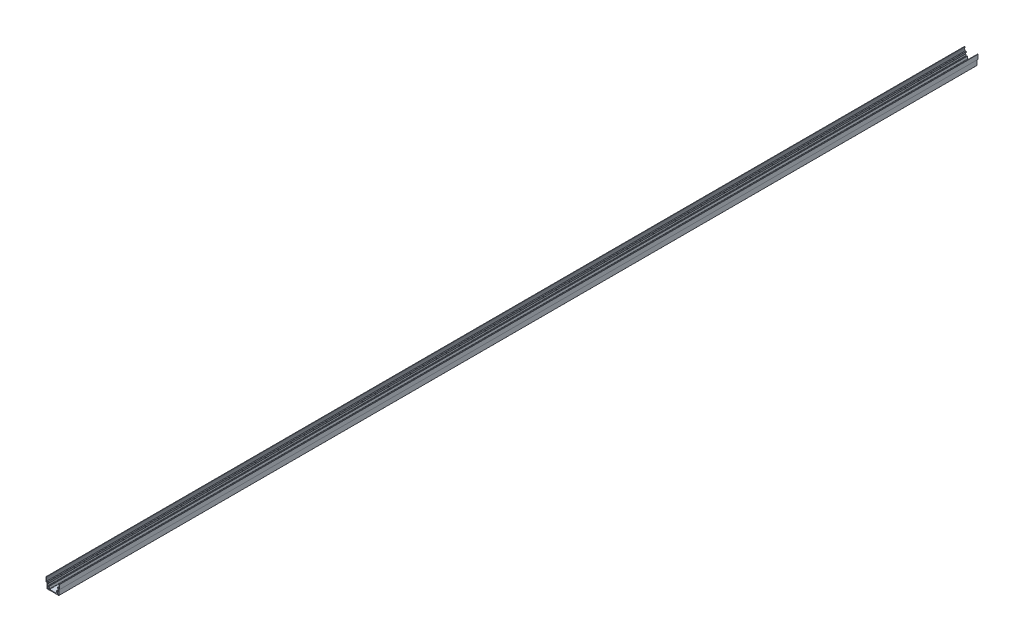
ISO-10303-21;
HEADER;
FILE_DESCRIPTION(('STEP AP214'),'2;1');
FILE_NAME('part.step','',(''),(''),'','','');
FILE_SCHEMA(('AUTOMOTIVE_DESIGN { 1 0 10303 214 1 1 1 1 }'));
ENDSEC;
DATA;
#1=APPLICATION_CONTEXT('core data for automotive mechanical design processes');
#2=APPLICATION_PROTOCOL_DEFINITION('international standard','automotive_design',2000,#1);
#3=PRODUCT_CONTEXT('',#1,'mechanical');
#4=PRODUCT('Part','Part','',(#3));
#5=PRODUCT_RELATED_PRODUCT_CATEGORY('part','',(#4));
#6=PRODUCT_DEFINITION_FORMATION('','',#4);
#7=PRODUCT_DEFINITION_CONTEXT('part definition',#1,'design');
#8=PRODUCT_DEFINITION('design','',#6,#7);
#9=PRODUCT_DEFINITION_SHAPE('','',#8);
#10=(LENGTH_UNIT() NAMED_UNIT(*) SI_UNIT(.MILLI.,.METRE.));
#11=(NAMED_UNIT(*) PLANE_ANGLE_UNIT() SI_UNIT($,.RADIAN.));
#12=(NAMED_UNIT(*) SI_UNIT($,.STERADIAN.) SOLID_ANGLE_UNIT());
#13=UNCERTAINTY_MEASURE_WITH_UNIT(LENGTH_MEASURE(1.E-05),#10,'distance_accuracy_value','');
#14=(GEOMETRIC_REPRESENTATION_CONTEXT(3) GLOBAL_UNCERTAINTY_ASSIGNED_CONTEXT((#13)) GLOBAL_UNIT_ASSIGNED_CONTEXT((#10,
#11,#12)) REPRESENTATION_CONTEXT('',''));
#15=CARTESIAN_POINT('',(0.,0.,0.));
#16=DIRECTION('',(0.,0.,1.));
#17=DIRECTION('',(1.,0.,0.));
#18=AXIS2_PLACEMENT_3D('',#15,#16,#17);
#19=CARTESIAN_POINT('',(-18.,26.302,270.));
#20=DIRECTION('',(1.,0.,0.));
#21=DIRECTION('',(0.,0.,-1.));
#22=AXIS2_PLACEMENT_3D('',#19,#20,#21);
#23=PLANE('',#22);
#24=DIRECTION('',(0.,-1.,0.));
#25=VECTOR('',#24,1.);
#26=CARTESIAN_POINT('',(-18.,26.302,0.));
#27=LINE('',#26,#25);
#28=CARTESIAN_POINT('',(-18.,26.302,0.));
#29=VERTEX_POINT('',#28);
#30=CARTESIAN_POINT('',(-18.,14.6986296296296,0.));
#31=VERTEX_POINT('',#30);
#32=EDGE_CURVE('E688',#29,#31,#27,.T.);
#33=ORIENTED_EDGE('',*,*,#32,.T.);
#34=DIRECTION('',(0.,0.,-1.));
#35=VECTOR('',#34,1.);
#36=CARTESIAN_POINT('',(-18.,14.6986296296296,270.));
#37=LINE('',#36,#35);
#38=CARTESIAN_POINT('',(-18.,14.6986296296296,2430.));
#39=VERTEX_POINT('',#38);
#40=EDGE_CURVE('E9',#39,#31,#37,.T.);
#41=ORIENTED_EDGE('',*,*,#40,.F.);
#42=DIRECTION('',(0.,1.,0.));
#43=VECTOR('',#42,1.);
#44=CARTESIAN_POINT('',(-18.,14.6986296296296,2430.));
#45=LINE('',#44,#43);
#46=CARTESIAN_POINT('',(-18.,26.302,2430.));
#47=VERTEX_POINT('',#46);
#48=EDGE_CURVE('E686',#39,#47,#45,.T.);
#49=ORIENTED_EDGE('',*,*,#48,.T.);
#50=DIRECTION('',(0.,0.,-1.));
#51=VECTOR('',#50,1.);
#52=CARTESIAN_POINT('',(-18.,26.302,270.));
#53=LINE('',#52,#51);
#54=EDGE_CURVE('E1281',#47,#29,#53,.T.);
#55=ORIENTED_EDGE('',*,*,#54,.T.);
#56=EDGE_LOOP('',(#33,#41,#49,#55));
#57=FACE_BOUND('',#56,.T.);
#58=ADVANCED_FACE('F14',(#57),#23,.F.);
#59=CARTESIAN_POINT('',(-18.,14.6986296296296,270.));
#60=DIRECTION('',(-0.287144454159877,0.957887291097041,0.));
#61=DIRECTION('',(-0.957887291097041,-0.287144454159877,0.));
#62=AXIS2_PLACEMENT_3D('',#59,#60,#61);
#63=PLANE('',#62);
#64=DIRECTION('',(0.957887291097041,0.287144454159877,0.));
#65=VECTOR('',#64,1.);
#66=CARTESIAN_POINT('',(-18.,14.6986296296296,0.));
#67=LINE('',#66,#65);
#68=CARTESIAN_POINT('',(-17.008,14.996,0.));
#69=VERTEX_POINT('',#68);
#70=EDGE_CURVE('E1025',#31,#69,#67,.T.);
#71=ORIENTED_EDGE('',*,*,#70,.T.);
#72=DIRECTION('',(0.,0.,-1.));
#73=VECTOR('',#72,1.);
#74=CARTESIAN_POINT('',(-17.008,14.996,270.));
#75=LINE('',#74,#73);
#76=CARTESIAN_POINT('',(-17.008,14.996,2430.));
#77=VERTEX_POINT('',#76);
#78=EDGE_CURVE('E21',#77,#69,#75,.T.);
#79=ORIENTED_EDGE('',*,*,#78,.F.);
#80=DIRECTION('',(-0.957887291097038,-0.287144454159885,0.));
#81=VECTOR('',#80,1.);
#82=CARTESIAN_POINT('',(-17.008,14.996,2430.));
#83=LINE('',#82,#81);
#84=EDGE_CURVE('E696',#77,#39,#83,.T.);
#85=ORIENTED_EDGE('',*,*,#84,.T.);
#86=ORIENTED_EDGE('',*,*,#40,.T.);
#87=EDGE_LOOP('',(#71,#79,#85,#86));
#88=FACE_BOUND('',#87,.T.);
#89=ADVANCED_FACE('F702',(#88),#63,.F.);
#90=CARTESIAN_POINT('',(-17.008,14.996,270.));
#91=DIRECTION('',(0.,1.,0.));
#92=DIRECTION('',(0.,0.,1.));
#93=AXIS2_PLACEMENT_3D('',#90,#91,#92);
#94=PLANE('',#93);
#95=DIRECTION('',(1.,0.,0.));
#96=VECTOR('',#95,1.);
#97=CARTESIAN_POINT('',(-17.008,14.996,0.));
#98=LINE('',#97,#96);
#99=CARTESIAN_POINT('',(-16.,14.996,0.));
#100=VERTEX_POINT('',#99);
#101=EDGE_CURVE('E1027',#69,#100,#98,.T.);
#102=ORIENTED_EDGE('',*,*,#101,.T.);
#103=DIRECTION('',(0.,0.,-1.));
#104=VECTOR('',#103,1.);
#105=CARTESIAN_POINT('',(-16.,14.996,270.));
#106=LINE('',#105,#104);
#107=CARTESIAN_POINT('',(-16.,14.996,2430.));
#108=VERTEX_POINT('',#107);
#109=EDGE_CURVE('E1554',#108,#100,#106,.T.);
#110=ORIENTED_EDGE('',*,*,#109,.F.);
#111=DIRECTION('',(-1.,0.,0.));
#112=VECTOR('',#111,1.);
#113=CARTESIAN_POINT('',(-16.,14.996,2430.));
#114=LINE('',#113,#112);
#115=EDGE_CURVE('E1022',#108,#77,#114,.T.);
#116=ORIENTED_EDGE('',*,*,#115,.T.);
#117=ORIENTED_EDGE('',*,*,#78,.T.);
#118=EDGE_LOOP('',(#102,#110,#116,#117));
#119=FACE_BOUND('',#118,.T.);
#120=ADVANCED_FACE('F1558',(#119),#94,.F.);
#121=CARTESIAN_POINT('',(-16.,14.996,270.));
#122=DIRECTION('',(1.,0.,0.));
#123=DIRECTION('',(0.,0.,-1.));
#124=AXIS2_PLACEMENT_3D('',#121,#122,#123);
#125=PLANE('',#124);
#126=DIRECTION('',(0.,-1.,0.));
#127=VECTOR('',#126,1.);
#128=CARTESIAN_POINT('',(-16.,14.996,0.));
#129=LINE('',#128,#127);
#130=CARTESIAN_POINT('',(-16.,0.0999999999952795,0.));
#131=VERTEX_POINT('',#130);
#132=EDGE_CURVE('E1029',#100,#131,#129,.T.);
#133=ORIENTED_EDGE('',*,*,#132,.T.);
#134=DIRECTION('',(0.,0.,-1.));
#135=VECTOR('',#134,1.);
#136=CARTESIAN_POINT('',(-16.,0.0999999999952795,270.));
#137=LINE('',#136,#135);
#138=CARTESIAN_POINT('',(-16.,0.0999999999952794,2430.));
#139=VERTEX_POINT('',#138);
#140=EDGE_CURVE('E1551',#139,#131,#137,.T.);
#141=ORIENTED_EDGE('',*,*,#140,.F.);
#142=DIRECTION('',(0.,1.,0.));
#143=VECTOR('',#142,1.);
#144=CARTESIAN_POINT('',(-16.,0.0999999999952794,2430.));
#145=LINE('',#144,#143);
#146=EDGE_CURVE('E1019',#139,#108,#145,.T.);
#147=ORIENTED_EDGE('',*,*,#146,.T.);
#148=ORIENTED_EDGE('',*,*,#109,.T.);
#149=EDGE_LOOP('',(#133,#141,#147,#148));
#150=FACE_BOUND('',#149,.T.);
#151=ADVANCED_FACE('F1565',(#150),#125,.F.);
#152=CARTESIAN_POINT('',(-15.702,0.0999999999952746,270.));
#153=DIRECTION('',(0.,0.,-1.));
#154=DIRECTION('',(-1.,0.,0.));
#155=AXIS2_PLACEMENT_3D('',#152,#153,#154);
#156=CYLINDRICAL_SURFACE('',#155,0.298);
#157=CARTESIAN_POINT('',(-15.702,0.0999999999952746,0.));
#158=DIRECTION('',(0.,0.,1.));
#159=DIRECTION('',(1.,0.,0.));
#160=AXIS2_PLACEMENT_3D('',#157,#158,#159);
#161=CIRCLE('',#160,0.298);
#162=CARTESIAN_POINT('',(-15.7020016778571,-0.198,0.));
#163=VERTEX_POINT('',#162);
#164=EDGE_CURVE('E1031',#131,#163,#161,.T.);
#165=ORIENTED_EDGE('',*,*,#164,.T.);
#166=DIRECTION('',(0.,0.,-1.));
#167=VECTOR('',#166,1.);
#168=CARTESIAN_POINT('',(-15.7020016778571,-0.198,270.));
#169=LINE('',#168,#167);
#170=CARTESIAN_POINT('',(-15.7020016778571,-0.198,2430.));
#171=VERTEX_POINT('',#170);
#172=EDGE_CURVE('E1548',#171,#163,#169,.T.);
#173=ORIENTED_EDGE('',*,*,#172,.F.);
#174=CARTESIAN_POINT('',(-15.702,0.0999999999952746,2430.));
#175=DIRECTION('',(0.,0.,-1.));
#176=DIRECTION('',(-1.,0.,0.));
#177=AXIS2_PLACEMENT_3D('',#174,#175,#176);
#178=CIRCLE('',#177,0.298);
#179=EDGE_CURVE('E1016',#171,#139,#178,.T.);
#180=ORIENTED_EDGE('',*,*,#179,.T.);
#181=ORIENTED_EDGE('',*,*,#140,.T.);
#182=EDGE_LOOP('',(#165,#173,#180,#181));
#183=FACE_BOUND('',#182,.T.);
#184=ADVANCED_FACE('F1568',(#183),#156,.T.);
#185=CARTESIAN_POINT('',(-15.7020016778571,-0.198,270.));
#186=DIRECTION('',(0.,1.,0.));
#187=DIRECTION('',(0.,0.,1.));
#188=AXIS2_PLACEMENT_3D('',#185,#186,#187);
#189=PLANE('',#188);
#190=DIRECTION('',(1.,0.,0.));
#191=VECTOR('',#190,1.);
#192=CARTESIAN_POINT('',(-15.7020016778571,-0.198,0.));
#193=LINE('',#192,#191);
#194=CARTESIAN_POINT('',(-14.2773032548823,-0.198,0.));
#195=VERTEX_POINT('',#194);
#196=EDGE_CURVE('E1033',#163,#195,#193,.T.);
#197=ORIENTED_EDGE('',*,*,#196,.T.);
#198=DIRECTION('',(0.,0.,-1.));
#199=VECTOR('',#198,1.);
#200=CARTESIAN_POINT('',(-14.2773032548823,-0.198,270.));
#201=LINE('',#200,#199);
#202=CARTESIAN_POINT('',(-14.2773032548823,-0.197999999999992,2430.));
#203=VERTEX_POINT('',#202);
#204=EDGE_CURVE('E1545',#203,#195,#201,.T.);
#205=ORIENTED_EDGE('',*,*,#204,.F.);
#206=DIRECTION('',(-1.,0.,0.));
#207=VECTOR('',#206,1.);
#208=CARTESIAN_POINT('',(-14.2773032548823,-0.197999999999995,2430.));
#209=LINE('',#208,#207);
#210=EDGE_CURVE('E1013',#203,#171,#209,.T.);
#211=ORIENTED_EDGE('',*,*,#210,.T.);
#212=ORIENTED_EDGE('',*,*,#172,.T.);
#213=EDGE_LOOP('',(#197,#205,#211,#212));
#214=FACE_BOUND('',#213,.T.);
#215=ADVANCED_FACE('F1573',(#214),#189,.F.);
#216=CARTESIAN_POINT('',(-14.2773038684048,0.0999999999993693,270.));
#217=DIRECTION('',(0.,0.,-1.));
#218=DIRECTION('',(-1.,0.,0.));
#219=AXIS2_PLACEMENT_3D('',#216,#217,#218);
#220=CYLINDRICAL_SURFACE('',#219,0.298);
#221=CARTESIAN_POINT('',(-14.2773038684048,0.0999999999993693,0.));
#222=DIRECTION('',(0.,0.,1.));
#223=DIRECTION('',(1.,0.,0.));
#224=AXIS2_PLACEMENT_3D('',#221,#222,#223);
#225=CIRCLE('',#224,0.298);
#226=CARTESIAN_POINT('',(-13.9819190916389,0.0606066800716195,0.));
#227=VERTEX_POINT('',#226);
#228=EDGE_CURVE('E1035',#195,#227,#225,.T.);
#229=ORIENTED_EDGE('',*,*,#228,.T.);
#230=DIRECTION('',(0.,0.,-1.));
#231=VECTOR('',#230,1.);
#232=CARTESIAN_POINT('',(-13.9819190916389,0.0606066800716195,270.));
#233=LINE('',#232,#231);
#234=CARTESIAN_POINT('',(-13.9819190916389,0.0606066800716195,2430.));
#235=VERTEX_POINT('',#234);
#236=EDGE_CURVE('E1542',#235,#227,#233,.T.);
#237=ORIENTED_EDGE('',*,*,#236,.F.);
#238=CARTESIAN_POINT('',(-14.2773038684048,0.0999999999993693,2430.));
#239=DIRECTION('',(0.,0.,-1.));
#240=DIRECTION('',(-1.,0.,0.));
#241=AXIS2_PLACEMENT_3D('',#238,#239,#240);
#242=CIRCLE('',#241,0.297999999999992);
#243=EDGE_CURVE('E1010',#235,#203,#242,.T.);
#244=ORIENTED_EDGE('',*,*,#243,.T.);
#245=ORIENTED_EDGE('',*,*,#204,.T.);
#246=EDGE_LOOP('',(#229,#237,#244,#245));
#247=FACE_BOUND('',#246,.T.);
#248=ADVANCED_FACE('F1576',(#247),#220,.T.);
#249=CARTESIAN_POINT('',(-13.9819190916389,0.0606066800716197,270.));
#250=DIRECTION('',(-0.991224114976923,0.132192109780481,0.));
#251=DIRECTION('',(-0.132192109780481,-0.991224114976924,0.));
#252=AXIS2_PLACEMENT_3D('',#249,#250,#251);
#253=PLANE('',#252);
#254=DIRECTION('',(0.132192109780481,0.991224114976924,0.));
#255=VECTOR('',#254,1.);
#256=CARTESIAN_POINT('',(-13.9819190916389,0.0606066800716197,0.));
#257=LINE('',#256,#255);
#258=CARTESIAN_POINT('',(-13.6770576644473,2.34656761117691,0.));
#259=VERTEX_POINT('',#258);
#260=EDGE_CURVE('E1037',#227,#259,#257,.T.);
#261=ORIENTED_EDGE('',*,*,#260,.T.);
#262=DIRECTION('',(0.,0.,-1.));
#263=VECTOR('',#262,1.);
#264=CARTESIAN_POINT('',(-13.6770576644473,2.34656761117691,270.));
#265=LINE('',#264,#263);
#266=CARTESIAN_POINT('',(-13.6770576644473,2.34656761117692,2430.));
#267=VERTEX_POINT('',#266);
#268=EDGE_CURVE('E1540',#267,#259,#265,.T.);
#269=ORIENTED_EDGE('',*,*,#268,.F.);
#270=DIRECTION('',(-0.132192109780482,-0.991224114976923,0.));
#271=VECTOR('',#270,1.);
#272=CARTESIAN_POINT('',(-13.6770576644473,2.34656761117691,2430.));
#273=LINE('',#272,#271);
#274=EDGE_CURVE('E1007',#267,#235,#273,.T.);
#275=ORIENTED_EDGE('',*,*,#274,.T.);
#276=ORIENTED_EDGE('',*,*,#236,.T.);
#277=EDGE_LOOP('',(#261,#269,#275,#276));
#278=FACE_BOUND('',#277,.T.);
#279=ADVANCED_FACE('F1581',(#278),#253,.F.);
#280=CARTESIAN_POINT('',(-13.1854105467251,2.281,270.));
#281=DIRECTION('',(0.,0.,-1.));
#282=DIRECTION('',(-1.,0.,0.));
#283=AXIS2_PLACEMENT_3D('',#280,#281,#282);
#284=CYLINDRICAL_SURFACE('',#283,0.496);
#285=CARTESIAN_POINT('',(-13.1854105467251,2.281,0.));
#286=DIRECTION('',(0.,0.,1.));
#287=DIRECTION('',(1.,0.,0.));
#288=AXIS2_PLACEMENT_3D('',#285,#286,#287);
#289=CIRCLE('',#288,0.496);
#290=CARTESIAN_POINT('',(-13.1854106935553,2.777,0.));
#291=VERTEX_POINT('',#290);
#292=EDGE_CURVE('E1040',#291,#259,#289,.T.);
#293=ORIENTED_EDGE('',*,*,#292,.F.);
#294=DIRECTION('',(0.,0.,-1.));
#295=VECTOR('',#294,1.);
#296=CARTESIAN_POINT('',(-13.1854106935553,2.777,270.));
#297=LINE('',#296,#295);
#298=CARTESIAN_POINT('',(-13.1854106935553,2.777,2430.));
#299=VERTEX_POINT('',#298);
#300=EDGE_CURVE('E1538',#299,#291,#297,.T.);
#301=ORIENTED_EDGE('',*,*,#300,.F.);
#302=CARTESIAN_POINT('',(-13.1854105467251,2.281,2430.));
#303=DIRECTION('',(0.,0.,1.));
#304=DIRECTION('',(-1.,0.,0.));
#305=AXIS2_PLACEMENT_3D('',#302,#303,#304);
#306=CIRCLE('',#305,0.496000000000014);
#307=EDGE_CURVE('E1004',#299,#267,#306,.T.);
#308=ORIENTED_EDGE('',*,*,#307,.T.);
#309=ORIENTED_EDGE('',*,*,#268,.T.);
#310=EDGE_LOOP('',(#293,#301,#308,#309));
#311=FACE_BOUND('',#310,.T.);
#312=ADVANCED_FACE('F1586',(#311),#284,.F.);
#313=CARTESIAN_POINT('',(-13.1854106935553,2.777,270.));
#314=DIRECTION('',(0.,1.,0.));
#315=DIRECTION('',(0.,0.,1.));
#316=AXIS2_PLACEMENT_3D('',#313,#314,#315);
#317=PLANE('',#316);
#318=DIRECTION('',(1.,0.,0.));
#319=VECTOR('',#318,1.);
#320=CARTESIAN_POINT('',(-13.1854106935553,2.777,0.));
#321=LINE('',#320,#319);
#322=CARTESIAN_POINT('',(-12.0205892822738,2.777,0.));
#323=VERTEX_POINT('',#322);
#324=EDGE_CURVE('E1043',#291,#323,#321,.T.);
#325=ORIENTED_EDGE('',*,*,#324,.T.);
#326=DIRECTION('',(0.,0.,-1.));
#327=VECTOR('',#326,1.);
#328=CARTESIAN_POINT('',(-12.0205892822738,2.777,270.));
#329=LINE('',#328,#327);
#330=CARTESIAN_POINT('',(-12.0205892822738,2.777,2430.));
#331=VERTEX_POINT('',#330);
#332=EDGE_CURVE('E1536',#331,#323,#329,.T.);
#333=ORIENTED_EDGE('',*,*,#332,.F.);
#334=DIRECTION('',(-1.,0.,0.));
#335=VECTOR('',#334,1.);
#336=CARTESIAN_POINT('',(-12.0205892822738,2.777,2430.));
#337=LINE('',#336,#335);
#338=EDGE_CURVE('E1001',#331,#299,#337,.T.);
#339=ORIENTED_EDGE('',*,*,#338,.T.);
#340=ORIENTED_EDGE('',*,*,#300,.T.);
#341=EDGE_LOOP('',(#325,#333,#339,#340));
#342=FACE_BOUND('',#341,.T.);
#343=ADVANCED_FACE('F1588',(#342),#317,.F.);
#344=CARTESIAN_POINT('',(-12.0205895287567,2.28100000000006,270.));
#345=DIRECTION('',(0.,0.,-1.));
#346=DIRECTION('',(-1.,0.,0.));
#347=AXIS2_PLACEMENT_3D('',#344,#345,#346);
#348=CYLINDRICAL_SURFACE('',#347,0.496);
#349=CARTESIAN_POINT('',(-12.0205895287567,2.28100000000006,0.));
#350=DIRECTION('',(0.,0.,1.));
#351=DIRECTION('',(1.,0.,0.));
#352=AXIS2_PLACEMENT_3D('',#349,#350,#351);
#353=CIRCLE('',#352,0.496);
#354=CARTESIAN_POINT('',(-11.5289320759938,2.34649006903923,0.));
#355=VERTEX_POINT('',#354);
#356=EDGE_CURVE('E1046',#355,#323,#353,.T.);
#357=ORIENTED_EDGE('',*,*,#356,.F.);
#358=DIRECTION('',(0.,0.,-1.));
#359=VECTOR('',#358,1.);
#360=CARTESIAN_POINT('',(-11.5289320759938,2.34649006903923,270.));
#361=LINE('',#360,#359);
#362=CARTESIAN_POINT('',(-11.5289320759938,2.34649006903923,2430.));
#363=VERTEX_POINT('',#362);
#364=EDGE_CURVE('E1534',#363,#355,#361,.T.);
#365=ORIENTED_EDGE('',*,*,#364,.F.);
#366=CARTESIAN_POINT('',(-12.0205895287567,2.28100000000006,2430.));
#367=DIRECTION('',(0.,0.,1.));
#368=DIRECTION('',(-1.,0.,0.));
#369=AXIS2_PLACEMENT_3D('',#366,#367,#368);
#370=CIRCLE('',#369,0.496);
#371=EDGE_CURVE('E998',#363,#331,#370,.T.);
#372=ORIENTED_EDGE('',*,*,#371,.T.);
#373=ORIENTED_EDGE('',*,*,#332,.T.);
#374=EDGE_LOOP('',(#357,#365,#372,#373));
#375=FACE_BOUND('',#374,.T.);
#376=ADVANCED_FACE('F1593',(#375),#348,.F.);
#377=CARTESIAN_POINT('',(-11.5289320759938,2.34649006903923,270.));
#378=DIRECTION('',(0.991244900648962,0.132036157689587,0.));
#379=DIRECTION('',(-0.132036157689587,0.991244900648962,0.));
#380=AXIS2_PLACEMENT_3D('',#377,#378,#379);
#381=PLANE('',#380);
#382=DIRECTION('',(0.132036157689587,-0.991244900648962,0.));
#383=VECTOR('',#382,1.);
#384=CARTESIAN_POINT('',(-11.5289320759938,2.34649006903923,0.));
#385=LINE('',#384,#383);
#386=CARTESIAN_POINT('',(-11.19,-0.198,0.));
#387=VERTEX_POINT('',#386);
#388=EDGE_CURVE('E1049',#355,#387,#385,.T.);
#389=ORIENTED_EDGE('',*,*,#388,.T.);
#390=DIRECTION('',(0.,0.,-1.));
#391=VECTOR('',#390,1.);
#392=CARTESIAN_POINT('',(-11.19,-0.198,270.));
#393=LINE('',#392,#391);
#394=CARTESIAN_POINT('',(-11.19,-0.198,2430.));
#395=VERTEX_POINT('',#394);
#396=EDGE_CURVE('E1531',#395,#387,#393,.T.);
#397=ORIENTED_EDGE('',*,*,#396,.F.);
#398=DIRECTION('',(-0.13203615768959,0.991244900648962,0.));
#399=VECTOR('',#398,1.);
#400=CARTESIAN_POINT('',(-11.19,-0.198,2430.));
#401=LINE('',#400,#399);
#402=EDGE_CURVE('E995',#395,#363,#401,.T.);
#403=ORIENTED_EDGE('',*,*,#402,.T.);
#404=ORIENTED_EDGE('',*,*,#364,.T.);
#405=EDGE_LOOP('',(#389,#397,#403,#404));
#406=FACE_BOUND('',#405,.T.);
#407=ADVANCED_FACE('F1598',(#406),#381,.F.);
#408=CARTESIAN_POINT('',(-11.19,-0.198,270.));
#409=DIRECTION('',(0.,1.,0.));
#410=DIRECTION('',(-1.,0.,0.));
#411=AXIS2_PLACEMENT_3D('',#408,#409,#410);
#412=PLANE('',#411);
#413=DIRECTION('',(1.,0.,0.));
#414=VECTOR('',#413,1.);
#415=CARTESIAN_POINT('',(-11.19,-0.198,0.));
#416=LINE('',#415,#414);
#417=CARTESIAN_POINT('',(-7.663,-0.198,0.));
#418=VERTEX_POINT('',#417);
#419=EDGE_CURVE('E1051',#387,#418,#416,.T.);
#420=ORIENTED_EDGE('',*,*,#419,.T.);
#421=DIRECTION('',(0.,0.,-1.));
#422=VECTOR('',#421,1.);
#423=CARTESIAN_POINT('',(-7.663,-0.198,270.));
#424=LINE('',#423,#422);
#425=CARTESIAN_POINT('',(-7.663,-0.198,2430.));
#426=VERTEX_POINT('',#425);
#427=EDGE_CURVE('E1529',#426,#418,#424,.T.);
#428=ORIENTED_EDGE('',*,*,#427,.F.);
#429=DIRECTION('',(-1.,0.,0.));
#430=VECTOR('',#429,1.);
#431=CARTESIAN_POINT('',(-7.663,-0.198,2430.));
#432=LINE('',#431,#430);
#433=EDGE_CURVE('E992',#426,#395,#432,.T.);
#434=ORIENTED_EDGE('',*,*,#433,.T.);
#435=ORIENTED_EDGE('',*,*,#396,.T.);
#436=EDGE_LOOP('',(#420,#428,#434,#435));
#437=FACE_BOUND('',#436,.T.);
#438=ADVANCED_FACE('F1600',(#437),#412,.F.);
#439=CARTESIAN_POINT('',(-7.14898437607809,-0.752368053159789,270.));
#440=DIRECTION('',(0.,0.,-1.));
#441=DIRECTION('',(-1.,0.,0.));
#442=AXIS2_PLACEMENT_3D('',#439,#440,#441);
#443=CYLINDRICAL_SURFACE('',#442,0.756);
#444=CARTESIAN_POINT('',(-7.14898437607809,-0.752368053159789,0.));
#445=DIRECTION('',(0.,0.,1.));
#446=DIRECTION('',(1.,0.,0.));
#447=AXIS2_PLACEMENT_3D('',#444,#445,#446);
#448=CIRCLE('',#447,0.756);
#449=CARTESIAN_POINT('',(-7.223,0.,0.));
#450=VERTEX_POINT('',#449);
#451=EDGE_CURVE('E1054',#450,#418,#448,.T.);
#452=ORIENTED_EDGE('',*,*,#451,.F.);
#453=DIRECTION('',(0.,0.,-1.));
#454=VECTOR('',#453,1.);
#455=CARTESIAN_POINT('',(-7.223,0.,270.));
#456=LINE('',#455,#454);
#457=CARTESIAN_POINT('',(-7.223,0.,2430.));
#458=VERTEX_POINT('',#457);
#459=EDGE_CURVE('E1527',#458,#450,#456,.T.);
#460=ORIENTED_EDGE('',*,*,#459,.F.);
#461=CARTESIAN_POINT('',(-7.14898437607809,-0.752368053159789,2430.));
#462=DIRECTION('',(0.,0.,1.));
#463=DIRECTION('',(-1.,0.,0.));
#464=AXIS2_PLACEMENT_3D('',#461,#462,#463);
#465=CIRCLE('',#464,0.756);
#466=EDGE_CURVE('E989',#458,#426,#465,.T.);
#467=ORIENTED_EDGE('',*,*,#466,.T.);
#468=ORIENTED_EDGE('',*,*,#427,.T.);
#469=EDGE_LOOP('',(#452,#460,#467,#468));
#470=FACE_BOUND('',#469,.T.);
#471=ADVANCED_FACE('F1604',(#470),#443,.F.);
#472=CARTESIAN_POINT('',(-7.223,0.,270.));
#473=DIRECTION('',(0.,1.,0.));
#474=DIRECTION('',(0.,0.,1.));
#475=AXIS2_PLACEMENT_3D('',#472,#473,#474);
#476=PLANE('',#475);
#477=DIRECTION('',(1.,0.,0.));
#478=VECTOR('',#477,1.);
#479=CARTESIAN_POINT('',(-7.223,0.,0.));
#480=LINE('',#479,#478);
#481=CARTESIAN_POINT('',(7.223,0.,0.));
#482=VERTEX_POINT('',#481);
#483=EDGE_CURVE('E1057',#450,#482,#480,.T.);
#484=ORIENTED_EDGE('',*,*,#483,.T.);
#485=DIRECTION('',(0.,0.,-1.));
#486=VECTOR('',#485,1.);
#487=CARTESIAN_POINT('',(7.223,0.,270.));
#488=LINE('',#487,#486);
#489=CARTESIAN_POINT('',(7.223,0.,2430.));
#490=VERTEX_POINT('',#489);
#491=EDGE_CURVE('E1525',#490,#482,#488,.T.);
#492=ORIENTED_EDGE('',*,*,#491,.F.);
#493=DIRECTION('',(-1.,0.,0.));
#494=VECTOR('',#493,1.);
#495=CARTESIAN_POINT('',(7.223,0.,2430.));
#496=LINE('',#495,#494);
#497=EDGE_CURVE('E986',#490,#458,#496,.T.);
#498=ORIENTED_EDGE('',*,*,#497,.T.);
#499=ORIENTED_EDGE('',*,*,#459,.T.);
#500=EDGE_LOOP('',(#484,#492,#498,#499));
#501=FACE_BOUND('',#500,.T.);
#502=ADVANCED_FACE('F1609',(#501),#476,.F.);
#503=CARTESIAN_POINT('',(7.14898437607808,-0.752368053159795,270.));
#504=DIRECTION('',(0.,0.,-1.));
#505=DIRECTION('',(-1.,0.,0.));
#506=AXIS2_PLACEMENT_3D('',#503,#504,#505);
#507=CYLINDRICAL_SURFACE('',#506,0.756);
#508=CARTESIAN_POINT('',(7.14898437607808,-0.752368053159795,0.));
#509=DIRECTION('',(0.,0.,1.));
#510=DIRECTION('',(1.,0.,0.));
#511=AXIS2_PLACEMENT_3D('',#508,#509,#510);
#512=CIRCLE('',#511,0.756);
#513=CARTESIAN_POINT('',(7.663,-0.198,0.));
#514=VERTEX_POINT('',#513);
#515=EDGE_CURVE('E1060',#514,#482,#512,.T.);
#516=ORIENTED_EDGE('',*,*,#515,.F.);
#517=DIRECTION('',(0.,0.,-1.));
#518=VECTOR('',#517,1.);
#519=CARTESIAN_POINT('',(7.663,-0.198,270.));
#520=LINE('',#519,#518);
#521=CARTESIAN_POINT('',(7.663,-0.198,2430.));
#522=VERTEX_POINT('',#521);
#523=EDGE_CURVE('E1523',#522,#514,#520,.T.);
#524=ORIENTED_EDGE('',*,*,#523,.F.);
#525=CARTESIAN_POINT('',(7.14898437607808,-0.752368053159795,2430.));
#526=DIRECTION('',(0.,0.,1.));
#527=DIRECTION('',(-1.,0.,0.));
#528=AXIS2_PLACEMENT_3D('',#525,#526,#527);
#529=CIRCLE('',#528,0.756000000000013);
#530=EDGE_CURVE('E983',#522,#490,#529,.T.);
#531=ORIENTED_EDGE('',*,*,#530,.T.);
#532=ORIENTED_EDGE('',*,*,#491,.T.);
#533=EDGE_LOOP('',(#516,#524,#531,#532));
#534=FACE_BOUND('',#533,.T.);
#535=ADVANCED_FACE('F1612',(#534),#507,.F.);
#536=CARTESIAN_POINT('',(7.663,-0.198,270.));
#537=DIRECTION('',(0.,1.,0.));
#538=DIRECTION('',(-1.,0.,0.));
#539=AXIS2_PLACEMENT_3D('',#536,#537,#538);
#540=PLANE('',#539);
#541=DIRECTION('',(1.,0.,0.));
#542=VECTOR('',#541,1.);
#543=CARTESIAN_POINT('',(7.663,-0.198,0.));
#544=LINE('',#543,#542);
#545=CARTESIAN_POINT('',(10.93,-0.198,0.));
#546=VERTEX_POINT('',#545);
#547=EDGE_CURVE('E1063',#514,#546,#544,.T.);
#548=ORIENTED_EDGE('',*,*,#547,.T.);
#549=DIRECTION('',(0.,0.,-1.));
#550=VECTOR('',#549,1.);
#551=CARTESIAN_POINT('',(10.93,-0.198,270.));
#552=LINE('',#551,#550);
#553=CARTESIAN_POINT('',(10.93,-0.197999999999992,2430.));
#554=VERTEX_POINT('',#553);
#555=EDGE_CURVE('E1520',#554,#546,#552,.T.);
#556=ORIENTED_EDGE('',*,*,#555,.F.);
#557=DIRECTION('',(-1.,0.,0.));
#558=VECTOR('',#557,1.);
#559=CARTESIAN_POINT('',(10.93,-0.197999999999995,2430.));
#560=LINE('',#559,#558);
#561=EDGE_CURVE('E980',#554,#522,#560,.T.);
#562=ORIENTED_EDGE('',*,*,#561,.T.);
#563=ORIENTED_EDGE('',*,*,#523,.T.);
#564=EDGE_LOOP('',(#548,#556,#562,#563));
#565=FACE_BOUND('',#564,.T.);
#566=ADVANCED_FACE('F1616',(#565),#540,.F.);
#567=CARTESIAN_POINT('',(10.9286957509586,0.0999971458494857,270.));
#568=DIRECTION('',(0.,0.,-1.));
#569=DIRECTION('',(-1.,0.,0.));
#570=AXIS2_PLACEMENT_3D('',#567,#568,#569);
#571=CYLINDRICAL_SURFACE('',#570,0.298);
#572=CARTESIAN_POINT('',(10.9286957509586,0.0999971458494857,0.));
#573=DIRECTION('',(0.,0.,1.));
#574=DIRECTION('',(1.,0.,0.));
#575=AXIS2_PLACEMENT_3D('',#572,#573,#574);
#576=CIRCLE('',#575,0.298);
#577=CARTESIAN_POINT('',(11.2240805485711,0.0606039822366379,0.));
#578=VERTEX_POINT('',#577);
#579=EDGE_CURVE('E1065',#546,#578,#576,.T.);
#580=ORIENTED_EDGE('',*,*,#579,.T.);
#581=DIRECTION('',(0.,0.,-1.));
#582=VECTOR('',#581,1.);
#583=CARTESIAN_POINT('',(11.2240805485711,0.0606039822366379,270.));
#584=LINE('',#583,#582);
#585=CARTESIAN_POINT('',(11.2240805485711,0.0606039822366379,2430.));
#586=VERTEX_POINT('',#585);
#587=EDGE_CURVE('E1517',#586,#578,#584,.T.);
#588=ORIENTED_EDGE('',*,*,#587,.F.);
#589=CARTESIAN_POINT('',(10.9286957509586,0.0999971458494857,2430.));
#590=DIRECTION('',(0.,0.,-1.));
#591=DIRECTION('',(-1.,0.,0.));
#592=AXIS2_PLACEMENT_3D('',#589,#590,#591);
#593=CIRCLE('',#592,0.297999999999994);
#594=EDGE_CURVE('E977',#586,#554,#593,.T.);
#595=ORIENTED_EDGE('',*,*,#594,.T.);
#596=ORIENTED_EDGE('',*,*,#555,.T.);
#597=EDGE_LOOP('',(#580,#588,#595,#596));
#598=FACE_BOUND('',#597,.T.);
#599=ADVANCED_FACE('F1620',(#598),#571,.T.);
#600=CARTESIAN_POINT('',(11.2240805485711,0.0606039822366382,270.));
#601=DIRECTION('',(-0.991224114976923,0.132192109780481,0.));
#602=DIRECTION('',(-0.132192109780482,-0.991224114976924,0.));
#603=AXIS2_PLACEMENT_3D('',#600,#601,#602);
#604=PLANE('',#603);
#605=DIRECTION('',(0.132192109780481,0.991224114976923,0.));
#606=VECTOR('',#605,1.);
#607=CARTESIAN_POINT('',(11.2240805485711,0.0606039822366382,0.));
#608=LINE('',#607,#606);
#609=CARTESIAN_POINT('',(11.5289423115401,2.3465674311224,0.));
#610=VERTEX_POINT('',#609);
#611=EDGE_CURVE('E1067',#578,#610,#608,.T.);
#612=ORIENTED_EDGE('',*,*,#611,.T.);
#613=DIRECTION('',(0.,0.,-1.));
#614=VECTOR('',#613,1.);
#615=CARTESIAN_POINT('',(11.5289423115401,2.3465674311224,270.));
#616=LINE('',#615,#614);
#617=CARTESIAN_POINT('',(11.5289423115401,2.3465674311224,2430.));
#618=VERTEX_POINT('',#617);
#619=EDGE_CURVE('E1515',#618,#610,#616,.T.);
#620=ORIENTED_EDGE('',*,*,#619,.F.);
#621=DIRECTION('',(-0.132192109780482,-0.991224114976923,0.));
#622=VECTOR('',#621,1.);
#623=CARTESIAN_POINT('',(11.5289423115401,2.3465674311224,2430.));
#624=LINE('',#623,#622);
#625=EDGE_CURVE('E974',#618,#586,#624,.T.);
#626=ORIENTED_EDGE('',*,*,#625,.T.);
#627=ORIENTED_EDGE('',*,*,#587,.T.);
#628=EDGE_LOOP('',(#612,#620,#626,#627));
#629=FACE_BOUND('',#628,.T.);
#630=ADVANCED_FACE('F1625',(#629),#604,.F.);
#631=CARTESIAN_POINT('',(12.020589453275,2.28100000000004,270.));
#632=DIRECTION('',(0.,0.,-1.));
#633=DIRECTION('',(-1.,0.,0.));
#634=AXIS2_PLACEMENT_3D('',#631,#632,#633);
#635=CYLINDRICAL_SURFACE('',#634,0.496);
#636=CARTESIAN_POINT('',(12.020589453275,2.28100000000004,0.));
#637=DIRECTION('',(0.,0.,1.));
#638=DIRECTION('',(1.,0.,0.));
#639=AXIS2_PLACEMENT_3D('',#636,#637,#638);
#640=CIRCLE('',#639,0.496);
#641=CARTESIAN_POINT('',(12.0205892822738,2.777,0.));
#642=VERTEX_POINT('',#641);
#643=EDGE_CURVE('E1070',#642,#610,#640,.T.);
#644=ORIENTED_EDGE('',*,*,#643,.F.);
#645=DIRECTION('',(0.,0.,-1.));
#646=VECTOR('',#645,1.);
#647=CARTESIAN_POINT('',(12.0205892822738,2.777,270.));
#648=LINE('',#647,#646);
#649=CARTESIAN_POINT('',(12.0205892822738,2.777,2430.));
#650=VERTEX_POINT('',#649);
#651=EDGE_CURVE('E1513',#650,#642,#648,.T.);
#652=ORIENTED_EDGE('',*,*,#651,.F.);
#653=CARTESIAN_POINT('',(12.020589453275,2.28100000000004,2430.));
#654=DIRECTION('',(0.,0.,1.));
#655=DIRECTION('',(-1.,0.,0.));
#656=AXIS2_PLACEMENT_3D('',#653,#654,#655);
#657=CIRCLE('',#656,0.496);
#658=EDGE_CURVE('E971',#650,#618,#657,.T.);
#659=ORIENTED_EDGE('',*,*,#658,.T.);
#660=ORIENTED_EDGE('',*,*,#619,.T.);
#661=EDGE_LOOP('',(#644,#652,#659,#660));
#662=FACE_BOUND('',#661,.T.);
#663=ADVANCED_FACE('F1630',(#662),#635,.F.);
#664=CARTESIAN_POINT('',(12.0205892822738,2.777,270.));
#665=DIRECTION('',(0.,1.,0.));
#666=DIRECTION('',(0.,0.,1.));
#667=AXIS2_PLACEMENT_3D('',#664,#665,#666);
#668=PLANE('',#667);
#669=DIRECTION('',(1.,0.,0.));
#670=VECTOR('',#669,1.);
#671=CARTESIAN_POINT('',(12.0205892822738,2.777,0.));
#672=LINE('',#671,#670);
#673=CARTESIAN_POINT('',(13.1854106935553,2.777,0.));
#674=VERTEX_POINT('',#673);
#675=EDGE_CURVE('E1073',#642,#674,#672,.T.);
#676=ORIENTED_EDGE('',*,*,#675,.T.);
#677=DIRECTION('',(0.,0.,-1.));
#678=VECTOR('',#677,1.);
#679=CARTESIAN_POINT('',(13.1854106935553,2.777,270.));
#680=LINE('',#679,#678);
#681=CARTESIAN_POINT('',(13.1854106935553,2.777,2430.));
#682=VERTEX_POINT('',#681);
#683=EDGE_CURVE('E1511',#682,#674,#680,.T.);
#684=ORIENTED_EDGE('',*,*,#683,.F.);
#685=DIRECTION('',(-1.,0.,0.));
#686=VECTOR('',#685,1.);
#687=CARTESIAN_POINT('',(13.1854106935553,2.777,2430.));
#688=LINE('',#687,#686);
#689=EDGE_CURVE('E968',#682,#650,#688,.T.);
#690=ORIENTED_EDGE('',*,*,#689,.T.);
#691=ORIENTED_EDGE('',*,*,#651,.T.);
#692=EDGE_LOOP('',(#676,#684,#690,#691));
#693=FACE_BOUND('',#692,.T.);
#694=ADVANCED_FACE('F1632',(#693),#668,.F.);
#695=CARTESIAN_POINT('',(13.1854105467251,2.281,270.));
#696=DIRECTION('',(0.,0.,-1.));
#697=DIRECTION('',(-1.,0.,0.));
#698=AXIS2_PLACEMENT_3D('',#695,#696,#697);
#699=CYLINDRICAL_SURFACE('',#698,0.496);
#700=CARTESIAN_POINT('',(13.1854105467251,2.281,0.));
#701=DIRECTION('',(0.,0.,1.));
#702=DIRECTION('',(1.,0.,0.));
#703=AXIS2_PLACEMENT_3D('',#700,#701,#702);
#704=CIRCLE('',#703,0.496);
#705=CARTESIAN_POINT('',(13.6770576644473,2.34656761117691,0.));
#706=VERTEX_POINT('',#705);
#707=EDGE_CURVE('E1076',#706,#674,#704,.T.);
#708=ORIENTED_EDGE('',*,*,#707,.F.);
#709=DIRECTION('',(0.,0.,-1.));
#710=VECTOR('',#709,1.);
#711=CARTESIAN_POINT('',(13.6770576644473,2.34656761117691,270.));
#712=LINE('',#711,#710);
#713=CARTESIAN_POINT('',(13.6770576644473,2.34656761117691,2430.));
#714=VERTEX_POINT('',#713);
#715=EDGE_CURVE('E1509',#714,#706,#712,.T.);
#716=ORIENTED_EDGE('',*,*,#715,.F.);
#717=CARTESIAN_POINT('',(13.1854105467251,2.281,2430.));
#718=DIRECTION('',(0.,0.,1.));
#719=DIRECTION('',(-1.,0.,0.));
#720=AXIS2_PLACEMENT_3D('',#717,#718,#719);
#721=CIRCLE('',#720,0.496);
#722=EDGE_CURVE('E965',#714,#682,#721,.T.);
#723=ORIENTED_EDGE('',*,*,#722,.T.);
#724=ORIENTED_EDGE('',*,*,#683,.T.);
#725=EDGE_LOOP('',(#708,#716,#723,#724));
#726=FACE_BOUND('',#725,.T.);
#727=ADVANCED_FACE('F1637',(#726),#699,.F.);
#728=CARTESIAN_POINT('',(13.6770576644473,2.34656761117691,270.));
#729=DIRECTION('',(0.991224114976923,0.132192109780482,0.));
#730=DIRECTION('',(-0.132192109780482,0.991224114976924,0.));
#731=AXIS2_PLACEMENT_3D('',#728,#729,#730);
#732=PLANE('',#731);
#733=DIRECTION('',(0.132192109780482,-0.991224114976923,0.));
#734=VECTOR('',#733,1.);
#735=CARTESIAN_POINT('',(13.6770576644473,2.34656761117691,0.));
#736=LINE('',#735,#734);
#737=CARTESIAN_POINT('',(13.9819190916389,0.0606066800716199,0.));
#738=VERTEX_POINT('',#737);
#739=EDGE_CURVE('E1079',#706,#738,#736,.T.);
#740=ORIENTED_EDGE('',*,*,#739,.T.);
#741=DIRECTION('',(0.,0.,-1.));
#742=VECTOR('',#741,1.);
#743=CARTESIAN_POINT('',(13.9819190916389,0.0606066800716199,270.));
#744=LINE('',#743,#742);
#745=CARTESIAN_POINT('',(13.9819190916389,0.0606066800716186,2430.));
#746=VERTEX_POINT('',#745);
#747=EDGE_CURVE('E1506',#746,#738,#744,.T.);
#748=ORIENTED_EDGE('',*,*,#747,.F.);
#749=DIRECTION('',(-0.132192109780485,0.991224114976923,0.));
#750=VECTOR('',#749,1.);
#751=CARTESIAN_POINT('',(13.9819190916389,0.0606066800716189,2430.));
#752=LINE('',#751,#750);
#753=EDGE_CURVE('E962',#746,#714,#752,.T.);
#754=ORIENTED_EDGE('',*,*,#753,.T.);
#755=ORIENTED_EDGE('',*,*,#715,.T.);
#756=EDGE_LOOP('',(#740,#748,#754,#755));
#757=FACE_BOUND('',#756,.T.);
#758=ADVANCED_FACE('F1642',(#757),#732,.F.);
#759=CARTESIAN_POINT('',(14.2773038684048,0.0999999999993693,270.));
#760=DIRECTION('',(0.,0.,-1.));
#761=DIRECTION('',(-1.,0.,0.));
#762=AXIS2_PLACEMENT_3D('',#759,#760,#761);
#763=CYLINDRICAL_SURFACE('',#762,0.298);
#764=CARTESIAN_POINT('',(14.2773038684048,0.0999999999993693,0.));
#765=DIRECTION('',(0.,0.,1.));
#766=DIRECTION('',(1.,0.,0.));
#767=AXIS2_PLACEMENT_3D('',#764,#765,#766);
#768=CIRCLE('',#767,0.298);
#769=CARTESIAN_POINT('',(14.2773032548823,-0.198,0.));
#770=VERTEX_POINT('',#769);
#771=EDGE_CURVE('E1081',#738,#770,#768,.T.);
#772=ORIENTED_EDGE('',*,*,#771,.T.);
#773=DIRECTION('',(0.,0.,-1.));
#774=VECTOR('',#773,1.);
#775=CARTESIAN_POINT('',(14.2773032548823,-0.198,270.));
#776=LINE('',#775,#774);
#777=CARTESIAN_POINT('',(14.2773032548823,-0.198,2430.));
#778=VERTEX_POINT('',#777);
#779=EDGE_CURVE('E1503',#778,#770,#776,.T.);
#780=ORIENTED_EDGE('',*,*,#779,.F.);
#781=CARTESIAN_POINT('',(14.2773038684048,0.0999999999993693,2430.));
#782=DIRECTION('',(0.,0.,-1.));
#783=DIRECTION('',(-1.,0.,0.));
#784=AXIS2_PLACEMENT_3D('',#781,#782,#783);
#785=CIRCLE('',#784,0.298);
#786=EDGE_CURVE('E959',#778,#746,#785,.T.);
#787=ORIENTED_EDGE('',*,*,#786,.T.);
#788=ORIENTED_EDGE('',*,*,#747,.T.);
#789=EDGE_LOOP('',(#772,#780,#787,#788));
#790=FACE_BOUND('',#789,.T.);
#791=ADVANCED_FACE('F1644',(#790),#763,.T.);
#792=CARTESIAN_POINT('',(14.2773032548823,-0.198,270.));
#793=DIRECTION('',(0.,1.,0.));
#794=DIRECTION('',(0.,0.,1.));
#795=AXIS2_PLACEMENT_3D('',#792,#793,#794);
#796=PLANE('',#795);
#797=DIRECTION('',(1.,0.,0.));
#798=VECTOR('',#797,1.);
#799=CARTESIAN_POINT('',(14.2773032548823,-0.198,0.));
#800=LINE('',#799,#798);
#801=CARTESIAN_POINT('',(15.7020016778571,-0.198,0.));
#802=VERTEX_POINT('',#801);
#803=EDGE_CURVE('E1083',#770,#802,#800,.T.);
#804=ORIENTED_EDGE('',*,*,#803,.T.);
#805=DIRECTION('',(0.,0.,-1.));
#806=VECTOR('',#805,1.);
#807=CARTESIAN_POINT('',(15.7020016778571,-0.198,270.));
#808=LINE('',#807,#806);
#809=CARTESIAN_POINT('',(15.7020016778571,-0.198,2430.));
#810=VERTEX_POINT('',#809);
#811=EDGE_CURVE('E1500',#810,#802,#808,.T.);
#812=ORIENTED_EDGE('',*,*,#811,.F.);
#813=DIRECTION('',(-1.,0.,0.));
#814=VECTOR('',#813,1.);
#815=CARTESIAN_POINT('',(15.7020016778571,-0.198,2430.));
#816=LINE('',#815,#814);
#817=EDGE_CURVE('E956',#810,#778,#816,.T.);
#818=ORIENTED_EDGE('',*,*,#817,.T.);
#819=ORIENTED_EDGE('',*,*,#779,.T.);
#820=EDGE_LOOP('',(#804,#812,#818,#819));
#821=FACE_BOUND('',#820,.T.);
#822=ADVANCED_FACE('F1649',(#821),#796,.F.);
#823=CARTESIAN_POINT('',(15.702,0.0999999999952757,270.));
#824=DIRECTION('',(0.,0.,-1.));
#825=DIRECTION('',(-1.,0.,0.));
#826=AXIS2_PLACEMENT_3D('',#823,#824,#825);
#827=CYLINDRICAL_SURFACE('',#826,0.298);
#828=CARTESIAN_POINT('',(15.702,0.0999999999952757,0.));
#829=DIRECTION('',(0.,0.,1.));
#830=DIRECTION('',(1.,0.,0.));
#831=AXIS2_PLACEMENT_3D('',#828,#829,#830);
#832=CIRCLE('',#831,0.298);
#833=CARTESIAN_POINT('',(16.,0.100000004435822,0.));
#834=VERTEX_POINT('',#833);
#835=EDGE_CURVE('E1085',#802,#834,#832,.T.);
#836=ORIENTED_EDGE('',*,*,#835,.T.);
#837=DIRECTION('',(0.,0.,-1.));
#838=VECTOR('',#837,1.);
#839=CARTESIAN_POINT('',(16.,0.100000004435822,270.));
#840=LINE('',#839,#838);
#841=CARTESIAN_POINT('',(16.,0.100000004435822,2430.));
#842=VERTEX_POINT('',#841);
#843=EDGE_CURVE('E1497',#842,#834,#840,.T.);
#844=ORIENTED_EDGE('',*,*,#843,.F.);
#845=CARTESIAN_POINT('',(15.702,0.0999999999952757,2430.));
#846=DIRECTION('',(0.,0.,-1.));
#847=DIRECTION('',(-1.,0.,0.));
#848=AXIS2_PLACEMENT_3D('',#845,#846,#847);
#849=CIRCLE('',#848,0.298);
#850=EDGE_CURVE('E953',#842,#810,#849,.T.);
#851=ORIENTED_EDGE('',*,*,#850,.T.);
#852=ORIENTED_EDGE('',*,*,#811,.T.);
#853=EDGE_LOOP('',(#836,#844,#851,#852));
#854=FACE_BOUND('',#853,.T.);
#855=ADVANCED_FACE('F1652',(#854),#827,.T.);
#856=CARTESIAN_POINT('',(16.,0.0999999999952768,270.));
#857=DIRECTION('',(-1.,0.,0.));
#858=DIRECTION('',(0.,0.,1.));
#859=AXIS2_PLACEMENT_3D('',#856,#857,#858);
#860=PLANE('',#859);
#861=DIRECTION('',(0.,1.,0.));
#862=VECTOR('',#861,1.);
#863=CARTESIAN_POINT('',(16.,0.0999999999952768,0.));
#864=LINE('',#863,#862);
#865=CARTESIAN_POINT('',(16.,14.996,0.));
#866=VERTEX_POINT('',#865);
#867=EDGE_CURVE('E1087',#834,#866,#864,.T.);
#868=ORIENTED_EDGE('',*,*,#867,.T.);
#869=DIRECTION('',(0.,0.,-1.));
#870=VECTOR('',#869,1.);
#871=CARTESIAN_POINT('',(16.,14.996,270.));
#872=LINE('',#871,#870);
#873=CARTESIAN_POINT('',(16.,14.996,2430.));
#874=VERTEX_POINT('',#873);
#875=EDGE_CURVE('E1494',#874,#866,#872,.T.);
#876=ORIENTED_EDGE('',*,*,#875,.F.);
#877=DIRECTION('',(0.,-1.,0.));
#878=VECTOR('',#877,1.);
#879=CARTESIAN_POINT('',(16.,14.996,2430.));
#880=LINE('',#879,#878);
#881=EDGE_CURVE('E950',#874,#842,#880,.T.);
#882=ORIENTED_EDGE('',*,*,#881,.T.);
#883=ORIENTED_EDGE('',*,*,#843,.T.);
#884=EDGE_LOOP('',(#868,#876,#882,#883));
#885=FACE_BOUND('',#884,.T.);
#886=ADVANCED_FACE('F1657',(#885),#860,.F.);
#887=CARTESIAN_POINT('',(16.,14.996,270.));
#888=DIRECTION('',(0.,1.,0.));
#889=DIRECTION('',(0.,0.,1.));
#890=AXIS2_PLACEMENT_3D('',#887,#888,#889);
#891=PLANE('',#890);
#892=DIRECTION('',(1.,0.,0.));
#893=VECTOR('',#892,1.);
#894=CARTESIAN_POINT('',(16.,14.996,0.));
#895=LINE('',#894,#893);
#896=CARTESIAN_POINT('',(17.008,14.996,0.));
#897=VERTEX_POINT('',#896);
#898=EDGE_CURVE('E1089',#866,#897,#895,.T.);
#899=ORIENTED_EDGE('',*,*,#898,.T.);
#900=DIRECTION('',(0.,0.,-1.));
#901=VECTOR('',#900,1.);
#902=CARTESIAN_POINT('',(17.008,14.996,270.));
#903=LINE('',#902,#901);
#904=CARTESIAN_POINT('',(17.008,14.996,2430.));
#905=VERTEX_POINT('',#904);
#906=EDGE_CURVE('E1491',#905,#897,#903,.T.);
#907=ORIENTED_EDGE('',*,*,#906,.F.);
#908=DIRECTION('',(-1.,0.,0.));
#909=VECTOR('',#908,1.);
#910=CARTESIAN_POINT('',(17.008,14.996,2430.));
#911=LINE('',#910,#909);
#912=EDGE_CURVE('E947',#905,#874,#911,.T.);
#913=ORIENTED_EDGE('',*,*,#912,.T.);
#914=ORIENTED_EDGE('',*,*,#875,.T.);
#915=EDGE_LOOP('',(#899,#907,#913,#914));
#916=FACE_BOUND('',#915,.T.);
#917=ADVANCED_FACE('F1660',(#916),#891,.F.);
#918=CARTESIAN_POINT('',(17.008,14.996,270.));
#919=DIRECTION('',(0.287144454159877,0.957887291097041,0.));
#920=DIRECTION('',(-0.957887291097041,0.287144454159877,0.));
#921=AXIS2_PLACEMENT_3D('',#918,#919,#920);
#922=PLANE('',#921);
#923=DIRECTION('',(0.957887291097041,-0.287144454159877,0.));
#924=VECTOR('',#923,1.);
#925=CARTESIAN_POINT('',(17.008,14.996,0.));
#926=LINE('',#925,#924);
#927=CARTESIAN_POINT('',(18.,14.6986296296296,0.));
#928=VERTEX_POINT('',#927);
#929=EDGE_CURVE('E1091',#897,#928,#926,.T.);
#930=ORIENTED_EDGE('',*,*,#929,.T.);
#931=DIRECTION('',(0.,0.,-1.));
#932=VECTOR('',#931,1.);
#933=CARTESIAN_POINT('',(18.,14.6986296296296,270.));
#934=LINE('',#933,#932);
#935=CARTESIAN_POINT('',(18.,14.6986296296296,2430.));
#936=VERTEX_POINT('',#935);
#937=EDGE_CURVE('E1488',#936,#928,#934,.T.);
#938=ORIENTED_EDGE('',*,*,#937,.F.);
#939=DIRECTION('',(-0.957887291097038,0.287144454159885,0.));
#940=VECTOR('',#939,1.);
#941=CARTESIAN_POINT('',(18.,14.6986296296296,2430.));
#942=LINE('',#941,#940);
#943=EDGE_CURVE('E944',#936,#905,#942,.T.);
#944=ORIENTED_EDGE('',*,*,#943,.T.);
#945=ORIENTED_EDGE('',*,*,#906,.T.);
#946=EDGE_LOOP('',(#930,#938,#944,#945));
#947=FACE_BOUND('',#946,.T.);
#948=ADVANCED_FACE('F1665',(#947),#922,.F.);
#949=CARTESIAN_POINT('',(18.,14.6986296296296,270.));
#950=DIRECTION('',(-1.,0.,0.));
#951=DIRECTION('',(0.,0.,1.));
#952=AXIS2_PLACEMENT_3D('',#949,#950,#951);
#953=PLANE('',#952);
#954=DIRECTION('',(0.,1.,0.));
#955=VECTOR('',#954,1.);
#956=CARTESIAN_POINT('',(18.,14.6986296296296,0.));
#957=LINE('',#956,#955);
#958=CARTESIAN_POINT('',(18.,26.302,0.));
#959=VERTEX_POINT('',#958);
#960=EDGE_CURVE('E1093',#928,#959,#957,.T.);
#961=ORIENTED_EDGE('',*,*,#960,.T.);
#962=DIRECTION('',(0.,0.,-1.));
#963=VECTOR('',#962,1.);
#964=CARTESIAN_POINT('',(18.,26.302,270.));
#965=LINE('',#964,#963);
#966=CARTESIAN_POINT('',(18.,26.302,2430.));
#967=VERTEX_POINT('',#966);
#968=EDGE_CURVE('E1485',#967,#959,#965,.T.);
#969=ORIENTED_EDGE('',*,*,#968,.F.);
#970=DIRECTION('',(0.,-1.,0.));
#971=VECTOR('',#970,1.);
#972=CARTESIAN_POINT('',(18.,26.302,2430.));
#973=LINE('',#972,#971);
#974=EDGE_CURVE('E941',#967,#936,#973,.T.);
#975=ORIENTED_EDGE('',*,*,#974,.T.);
#976=ORIENTED_EDGE('',*,*,#937,.T.);
#977=EDGE_LOOP('',(#961,#969,#975,#976));
#978=FACE_BOUND('',#977,.T.);
#979=ADVANCED_FACE('F1668',(#978),#953,.F.);
#980=CARTESIAN_POINT('',(18.,26.302,270.));
#981=DIRECTION('',(0.,-1.,0.));
#982=DIRECTION('',(0.,0.,-1.));
#983=AXIS2_PLACEMENT_3D('',#980,#981,#982);
#984=PLANE('',#983);
#985=DIRECTION('',(-1.,0.,0.));
#986=VECTOR('',#985,1.);
#987=CARTESIAN_POINT('',(18.,26.302,0.));
#988=LINE('',#987,#986);
#989=CARTESIAN_POINT('',(16.81,26.302,0.));
#990=VERTEX_POINT('',#989);
#991=EDGE_CURVE('E1095',#959,#990,#988,.T.);
#992=ORIENTED_EDGE('',*,*,#991,.T.);
#993=DIRECTION('',(0.,0.,-1.));
#994=VECTOR('',#993,1.);
#995=CARTESIAN_POINT('',(16.81,26.302,270.));
#996=LINE('',#995,#994);
#997=CARTESIAN_POINT('',(16.81,26.302,2430.));
#998=VERTEX_POINT('',#997);
#999=EDGE_CURVE('E1482',#998,#990,#996,.T.);
#1000=ORIENTED_EDGE('',*,*,#999,.F.);
#1001=DIRECTION('',(1.,0.,0.));
#1002=VECTOR('',#1001,1.);
#1003=CARTESIAN_POINT('',(16.81,26.302,2430.));
#1004=LINE('',#1003,#1002);
#1005=EDGE_CURVE('E938',#998,#967,#1004,.T.);
#1006=ORIENTED_EDGE('',*,*,#1005,.T.);
#1007=ORIENTED_EDGE('',*,*,#968,.T.);
#1008=EDGE_LOOP('',(#992,#1000,#1006,#1007));
#1009=FACE_BOUND('',#1008,.T.);
#1010=ADVANCED_FACE('F1673',(#1009),#984,.F.);
#1011=CARTESIAN_POINT('',(16.81,26.302,270.));
#1012=DIRECTION('',(1.,0.,0.));
#1013=DIRECTION('',(0.,0.,-1.));
#1014=AXIS2_PLACEMENT_3D('',#1011,#1012,#1013);
#1015=PLANE('',#1014);
#1016=DIRECTION('',(0.,-1.,0.));
#1017=VECTOR('',#1016,1.);
#1018=CARTESIAN_POINT('',(16.81,26.302,0.));
#1019=LINE('',#1018,#1017);
#1020=CARTESIAN_POINT('',(16.81,24.0331095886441,0.));
#1021=VERTEX_POINT('',#1020);
#1022=EDGE_CURVE('E1097',#990,#1021,#1019,.T.);
#1023=ORIENTED_EDGE('',*,*,#1022,.T.);
#1024=DIRECTION('',(0.,0.,-1.));
#1025=VECTOR('',#1024,1.);
#1026=CARTESIAN_POINT('',(16.81,24.0331095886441,270.));
#1027=LINE('',#1026,#1025);
#1028=CARTESIAN_POINT('',(16.81,24.0331095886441,2430.));
#1029=VERTEX_POINT('',#1028);
#1030=EDGE_CURVE('E1479',#1029,#1021,#1027,.T.);
#1031=ORIENTED_EDGE('',*,*,#1030,.F.);
#1032=DIRECTION('',(0.,1.,0.));
#1033=VECTOR('',#1032,1.);
#1034=CARTESIAN_POINT('',(16.81,24.0331095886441,2430.));
#1035=LINE('',#1034,#1033);
#1036=EDGE_CURVE('E935',#1029,#998,#1035,.T.);
#1037=ORIENTED_EDGE('',*,*,#1036,.T.);
#1038=ORIENTED_EDGE('',*,*,#999,.T.);
#1039=EDGE_LOOP('',(#1023,#1031,#1037,#1038));
#1040=FACE_BOUND('',#1039,.T.);
#1041=ADVANCED_FACE('F1676',(#1040),#1015,.F.);
#1042=CARTESIAN_POINT('',(18.7929999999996,24.0331097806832,270.));
#1043=DIRECTION('',(0.,0.,-1.));
#1044=DIRECTION('',(-1.,0.,0.));
#1045=AXIS2_PLACEMENT_3D('',#1042,#1043,#1044);
#1046=CYLINDRICAL_SURFACE('',#1045,1.98299999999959);
#1047=CARTESIAN_POINT('',(18.7929999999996,24.0331097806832,0.));
#1048=DIRECTION('',(0.,0.,1.));
#1049=DIRECTION('',(1.,0.,0.));
#1050=AXIS2_PLACEMENT_3D('',#1047,#1048,#1049);
#1051=CIRCLE('',#1050,1.98299999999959);
#1052=CARTESIAN_POINT('',(16.8771176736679,23.521559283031,0.));
#1053=VERTEX_POINT('',#1052);
#1054=EDGE_CURVE('E1099',#1021,#1053,#1051,.T.);
#1055=ORIENTED_EDGE('',*,*,#1054,.T.);
#1056=DIRECTION('',(0.,0.,-1.));
#1057=VECTOR('',#1056,1.);
#1058=CARTESIAN_POINT('',(16.8771176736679,23.521559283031,270.));
#1059=LINE('',#1058,#1057);
#1060=CARTESIAN_POINT('',(16.8771176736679,23.521559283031,2430.));
#1061=VERTEX_POINT('',#1060);
#1062=EDGE_CURVE('E1476',#1061,#1053,#1059,.T.);
#1063=ORIENTED_EDGE('',*,*,#1062,.F.);
#1064=CARTESIAN_POINT('',(18.7929999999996,24.0331097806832,2430.));
#1065=DIRECTION('',(0.,0.,-1.));
#1066=DIRECTION('',(-1.,0.,0.));
#1067=AXIS2_PLACEMENT_3D('',#1064,#1065,#1066);
#1068=CIRCLE('',#1067,1.98299999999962);
#1069=EDGE_CURVE('E932',#1061,#1029,#1068,.T.);
#1070=ORIENTED_EDGE('',*,*,#1069,.T.);
#1071=ORIENTED_EDGE('',*,*,#1030,.T.);
#1072=EDGE_LOOP('',(#1055,#1063,#1070,#1071));
#1073=FACE_BOUND('',#1072,.T.);
#1074=ADVANCED_FACE('F1680',(#1073),#1046,.T.);
#1075=CARTESIAN_POINT('',(16.8771176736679,23.521559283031,270.));
#1076=DIRECTION('',(0.966153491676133,0.257967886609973,0.));
#1077=DIRECTION('',(-0.257967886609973,0.966153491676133,0.));
#1078=AXIS2_PLACEMENT_3D('',#1075,#1076,#1077);
#1079=PLANE('',#1078);
#1080=DIRECTION('',(0.257967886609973,-0.966153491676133,0.));
#1081=VECTOR('',#1080,1.);
#1082=CARTESIAN_POINT('',(16.8771176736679,23.521559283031,0.));
#1083=LINE('',#1082,#1081);
#1084=CARTESIAN_POINT('',(17.1398823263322,22.5374407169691,0.));
#1085=VERTEX_POINT('',#1084);
#1086=EDGE_CURVE('E1101',#1053,#1085,#1083,.T.);
#1087=ORIENTED_EDGE('',*,*,#1086,.T.);
#1088=DIRECTION('',(0.,0.,-1.));
#1089=VECTOR('',#1088,1.);
#1090=CARTESIAN_POINT('',(17.1398823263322,22.5374407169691,270.));
#1091=LINE('',#1090,#1089);
#1092=CARTESIAN_POINT('',(17.1398823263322,22.5374407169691,2430.));
#1093=VERTEX_POINT('',#1092);
#1094=EDGE_CURVE('E1474',#1093,#1085,#1091,.T.);
#1095=ORIENTED_EDGE('',*,*,#1094,.F.);
#1096=DIRECTION('',(-0.257967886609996,0.966153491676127,0.));
#1097=VECTOR('',#1096,1.);
#1098=CARTESIAN_POINT('',(17.1398823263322,22.5374407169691,2430.));
#1099=LINE('',#1098,#1097);
#1100=EDGE_CURVE('E929',#1093,#1061,#1099,.T.);
#1101=ORIENTED_EDGE('',*,*,#1100,.T.);
#1102=ORIENTED_EDGE('',*,*,#1062,.T.);
#1103=EDGE_LOOP('',(#1087,#1095,#1101,#1102));
#1104=FACE_BOUND('',#1103,.T.);
#1105=ADVANCED_FACE('F1683',(#1104),#1079,.F.);
#1106=CARTESIAN_POINT('',(15.224,22.0258902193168,270.));
#1107=DIRECTION('',(0.,0.,-1.));
#1108=DIRECTION('',(-1.,0.,0.));
#1109=AXIS2_PLACEMENT_3D('',#1106,#1107,#1108);
#1110=CYLINDRICAL_SURFACE('',#1109,1.98300000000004);
#1111=CARTESIAN_POINT('',(15.224,22.0258902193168,0.));
#1112=DIRECTION('',(0.,0.,1.));
#1113=DIRECTION('',(1.,0.,0.));
#1114=AXIS2_PLACEMENT_3D('',#1111,#1112,#1113);
#1115=CIRCLE('',#1114,1.98300000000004);
#1116=CARTESIAN_POINT('',(17.207,22.0258904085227,0.));
#1117=VERTEX_POINT('',#1116);
#1118=EDGE_CURVE('E1104',#1117,#1085,#1115,.T.);
#1119=ORIENTED_EDGE('',*,*,#1118,.F.);
#1120=DIRECTION('',(0.,0.,-1.));
#1121=VECTOR('',#1120,1.);
#1122=CARTESIAN_POINT('',(17.207,22.0258904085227,270.));
#1123=LINE('',#1122,#1121);
#1124=CARTESIAN_POINT('',(17.207,22.0258904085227,2430.));
#1125=VERTEX_POINT('',#1124);
#1126=EDGE_CURVE('E1472',#1125,#1117,#1123,.T.);
#1127=ORIENTED_EDGE('',*,*,#1126,.F.);
#1128=CARTESIAN_POINT('',(15.224,22.0258902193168,2430.));
#1129=DIRECTION('',(0.,0.,1.));
#1130=DIRECTION('',(-1.,0.,0.));
#1131=AXIS2_PLACEMENT_3D('',#1128,#1129,#1130);
#1132=CIRCLE('',#1131,1.983);
#1133=EDGE_CURVE('E926',#1125,#1093,#1132,.T.);
#1134=ORIENTED_EDGE('',*,*,#1133,.T.);
#1135=ORIENTED_EDGE('',*,*,#1094,.T.);
#1136=EDGE_LOOP('',(#1119,#1127,#1134,#1135));
#1137=FACE_BOUND('',#1136,.T.);
#1138=ADVANCED_FACE('F1689',(#1137),#1110,.F.);
#1139=CARTESIAN_POINT('',(17.207,22.0258904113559,270.));
#1140=DIRECTION('',(1.,0.,0.));
#1141=DIRECTION('',(0.,0.,-1.));
#1142=AXIS2_PLACEMENT_3D('',#1139,#1140,#1141);
#1143=PLANE('',#1142);
#1144=DIRECTION('',(0.,-1.,0.));
#1145=VECTOR('',#1144,1.);
#1146=CARTESIAN_POINT('',(17.207,22.0258904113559,0.));
#1147=LINE('',#1146,#1145);
#1148=CARTESIAN_POINT('',(17.207,20.5621095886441,0.));
#1149=VERTEX_POINT('',#1148);
#1150=EDGE_CURVE('E1107',#1117,#1149,#1147,.T.);
#1151=ORIENTED_EDGE('',*,*,#1150,.T.);
#1152=DIRECTION('',(0.,0.,-1.));
#1153=VECTOR('',#1152,1.);
#1154=CARTESIAN_POINT('',(17.207,20.5621095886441,270.));
#1155=LINE('',#1154,#1153);
#1156=CARTESIAN_POINT('',(17.207,20.5621095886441,2430.));
#1157=VERTEX_POINT('',#1156);
#1158=EDGE_CURVE('E1470',#1157,#1149,#1155,.T.);
#1159=ORIENTED_EDGE('',*,*,#1158,.F.);
#1160=DIRECTION('',(0.,1.,0.));
#1161=VECTOR('',#1160,1.);
#1162=CARTESIAN_POINT('',(17.207,20.5621095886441,2430.));
#1163=LINE('',#1162,#1161);
#1164=EDGE_CURVE('E923',#1157,#1125,#1163,.T.);
#1165=ORIENTED_EDGE('',*,*,#1164,.T.);
#1166=ORIENTED_EDGE('',*,*,#1126,.T.);
#1167=EDGE_LOOP('',(#1151,#1159,#1165,#1166));
#1168=FACE_BOUND('',#1167,.T.);
#1169=ADVANCED_FACE('F1692',(#1168),#1143,.F.);
#1170=CARTESIAN_POINT('',(15.224,20.5621097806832,270.));
#1171=DIRECTION('',(0.,0.,-1.));
#1172=DIRECTION('',(-1.,0.,0.));
#1173=AXIS2_PLACEMENT_3D('',#1170,#1171,#1172);
#1174=CYLINDRICAL_SURFACE('',#1173,1.98300000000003);
#1175=CARTESIAN_POINT('',(15.224,20.5621097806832,0.));
#1176=DIRECTION('',(0.,0.,1.));
#1177=DIRECTION('',(1.,0.,0.));
#1178=AXIS2_PLACEMENT_3D('',#1175,#1176,#1177);
#1179=CIRCLE('',#1178,1.98300000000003);
#1180=CARTESIAN_POINT('',(17.1398823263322,20.050559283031,0.));
#1181=VERTEX_POINT('',#1180);
#1182=EDGE_CURVE('E1110',#1181,#1149,#1179,.T.);
#1183=ORIENTED_EDGE('',*,*,#1182,.F.);
#1184=DIRECTION('',(0.,0.,-1.));
#1185=VECTOR('',#1184,1.);
#1186=CARTESIAN_POINT('',(17.1398823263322,20.050559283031,270.));
#1187=LINE('',#1186,#1185);
#1188=CARTESIAN_POINT('',(17.1398823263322,20.050559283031,2430.));
#1189=VERTEX_POINT('',#1188);
#1190=EDGE_CURVE('E1468',#1189,#1181,#1187,.T.);
#1191=ORIENTED_EDGE('',*,*,#1190,.F.);
#1192=CARTESIAN_POINT('',(15.224,20.5621097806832,2430.));
#1193=DIRECTION('',(0.,0.,1.));
#1194=DIRECTION('',(-1.,0.,0.));
#1195=AXIS2_PLACEMENT_3D('',#1192,#1193,#1194);
#1196=CIRCLE('',#1195,1.98300000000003);
#1197=EDGE_CURVE('E920',#1189,#1157,#1196,.T.);
#1198=ORIENTED_EDGE('',*,*,#1197,.T.);
#1199=ORIENTED_EDGE('',*,*,#1158,.T.);
#1200=EDGE_LOOP('',(#1183,#1191,#1198,#1199));
#1201=FACE_BOUND('',#1200,.T.);
#1202=ADVANCED_FACE('F1697',(#1201),#1174,.F.);
#1203=CARTESIAN_POINT('',(17.1398823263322,20.050559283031,270.));
#1204=DIRECTION('',(0.966153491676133,-0.257967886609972,0.));
#1205=DIRECTION('',(0.257967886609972,0.966153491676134,0.));
#1206=AXIS2_PLACEMENT_3D('',#1203,#1204,#1205);
#1207=PLANE('',#1206);
#1208=DIRECTION('',(-0.257967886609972,-0.966153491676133,0.));
#1209=VECTOR('',#1208,1.);
#1210=CARTESIAN_POINT('',(17.1398823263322,20.050559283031,0.));
#1211=LINE('',#1210,#1209);
#1212=CARTESIAN_POINT('',(16.8771176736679,19.0664407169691,0.));
#1213=VERTEX_POINT('',#1212);
#1214=EDGE_CURVE('E1113',#1181,#1213,#1211,.T.);
#1215=ORIENTED_EDGE('',*,*,#1214,.T.);
#1216=DIRECTION('',(0.,0.,-1.));
#1217=VECTOR('',#1216,1.);
#1218=CARTESIAN_POINT('',(16.8771176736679,19.0664407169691,270.));
#1219=LINE('',#1218,#1217);
#1220=CARTESIAN_POINT('',(16.8771176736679,19.0664407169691,2430.));
#1221=VERTEX_POINT('',#1220);
#1222=EDGE_CURVE('E1465',#1221,#1213,#1219,.T.);
#1223=ORIENTED_EDGE('',*,*,#1222,.F.);
#1224=DIRECTION('',(0.257967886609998,0.966153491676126,0.));
#1225=VECTOR('',#1224,1.);
#1226=CARTESIAN_POINT('',(16.8771176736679,19.0664407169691,2430.));
#1227=LINE('',#1226,#1225);
#1228=EDGE_CURVE('E917',#1221,#1189,#1227,.T.);
#1229=ORIENTED_EDGE('',*,*,#1228,.T.);
#1230=ORIENTED_EDGE('',*,*,#1190,.T.);
#1231=EDGE_LOOP('',(#1215,#1223,#1229,#1230));
#1232=FACE_BOUND('',#1231,.T.);
#1233=ADVANCED_FACE('F1702',(#1232),#1207,.F.);
#1234=CARTESIAN_POINT('',(18.7929999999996,18.5548902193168,270.));
#1235=DIRECTION('',(0.,0.,-1.));
#1236=DIRECTION('',(-1.,0.,0.));
#1237=AXIS2_PLACEMENT_3D('',#1234,#1235,#1236);
#1238=CYLINDRICAL_SURFACE('',#1237,1.98299999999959);
#1239=CARTESIAN_POINT('',(18.7929999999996,18.5548902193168,0.));
#1240=DIRECTION('',(0.,0.,1.));
#1241=DIRECTION('',(1.,0.,0.));
#1242=AXIS2_PLACEMENT_3D('',#1239,#1240,#1241);
#1243=CIRCLE('',#1242,1.98299999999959);
#1244=CARTESIAN_POINT('',(16.81,18.5548904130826,0.));
#1245=VERTEX_POINT('',#1244);
#1246=EDGE_CURVE('E1115',#1213,#1245,#1243,.T.);
#1247=ORIENTED_EDGE('',*,*,#1246,.T.);
#1248=DIRECTION('',(0.,0.,-1.));
#1249=VECTOR('',#1248,1.);
#1250=CARTESIAN_POINT('',(16.81,18.5548904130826,270.));
#1251=LINE('',#1250,#1249);
#1252=CARTESIAN_POINT('',(16.81,18.5548904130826,2430.));
#1253=VERTEX_POINT('',#1252);
#1254=EDGE_CURVE('E1462',#1253,#1245,#1251,.T.);
#1255=ORIENTED_EDGE('',*,*,#1254,.F.);
#1256=CARTESIAN_POINT('',(18.7929999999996,18.5548902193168,2430.));
#1257=DIRECTION('',(0.,0.,-1.));
#1258=DIRECTION('',(-1.,0.,0.));
#1259=AXIS2_PLACEMENT_3D('',#1256,#1257,#1258);
#1260=CIRCLE('',#1259,1.98299999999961);
#1261=EDGE_CURVE('E914',#1253,#1221,#1260,.T.);
#1262=ORIENTED_EDGE('',*,*,#1261,.T.);
#1263=ORIENTED_EDGE('',*,*,#1222,.T.);
#1264=EDGE_LOOP('',(#1247,#1255,#1262,#1263));
#1265=FACE_BOUND('',#1264,.T.);
#1266=ADVANCED_FACE('F1704',(#1265),#1238,.T.);
#1267=CARTESIAN_POINT('',(16.81,18.5548904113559,270.));
#1268=DIRECTION('',(1.,0.,0.));
#1269=DIRECTION('',(0.,0.,-1.));
#1270=AXIS2_PLACEMENT_3D('',#1267,#1268,#1269);
#1271=PLANE('',#1270);
#1272=DIRECTION('',(0.,-1.,0.));
#1273=VECTOR('',#1272,1.);
#1274=CARTESIAN_POINT('',(16.81,18.5548904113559,0.));
#1275=LINE('',#1274,#1273);
#1276=CARTESIAN_POINT('',(16.81,16.286,0.));
#1277=VERTEX_POINT('',#1276);
#1278=EDGE_CURVE('E1117',#1245,#1277,#1275,.T.);
#1279=ORIENTED_EDGE('',*,*,#1278,.T.);
#1280=DIRECTION('',(0.,0.,-1.));
#1281=VECTOR('',#1280,1.);
#1282=CARTESIAN_POINT('',(16.81,16.286,270.));
#1283=LINE('',#1282,#1281);
#1284=CARTESIAN_POINT('',(16.81,16.286,2430.));
#1285=VERTEX_POINT('',#1284);
#1286=EDGE_CURVE('E1459',#1285,#1277,#1283,.T.);
#1287=ORIENTED_EDGE('',*,*,#1286,.F.);
#1288=DIRECTION('',(0.,1.,0.));
#1289=VECTOR('',#1288,1.);
#1290=CARTESIAN_POINT('',(16.81,16.286,2430.));
#1291=LINE('',#1290,#1289);
#1292=EDGE_CURVE('E911',#1285,#1253,#1291,.T.);
#1293=ORIENTED_EDGE('',*,*,#1292,.T.);
#1294=ORIENTED_EDGE('',*,*,#1254,.T.);
#1295=EDGE_LOOP('',(#1279,#1287,#1293,#1294));
#1296=FACE_BOUND('',#1295,.T.);
#1297=ADVANCED_FACE('F1709',(#1296),#1271,.F.);
#1298=CARTESIAN_POINT('',(16.81,16.286,270.));
#1299=DIRECTION('',(0.,-1.,0.));
#1300=DIRECTION('',(0.,0.,-1.));
#1301=AXIS2_PLACEMENT_3D('',#1298,#1299,#1300);
#1302=PLANE('',#1301);
#1303=DIRECTION('',(-1.,0.,0.));
#1304=VECTOR('',#1303,1.);
#1305=CARTESIAN_POINT('',(16.81,16.286,0.));
#1306=LINE('',#1305,#1304);
#1307=CARTESIAN_POINT('',(14.165,16.286,0.));
#1308=VERTEX_POINT('',#1307);
#1309=EDGE_CURVE('E1119',#1277,#1308,#1306,.T.);
#1310=ORIENTED_EDGE('',*,*,#1309,.T.);
#1311=DIRECTION('',(0.,0.,-1.));
#1312=VECTOR('',#1311,1.);
#1313=CARTESIAN_POINT('',(14.165,16.286,270.));
#1314=LINE('',#1313,#1312);
#1315=CARTESIAN_POINT('',(14.165,16.286,2430.));
#1316=VERTEX_POINT('',#1315);
#1317=EDGE_CURVE('E1456',#1316,#1308,#1314,.T.);
#1318=ORIENTED_EDGE('',*,*,#1317,.F.);
#1319=DIRECTION('',(1.,0.,0.));
#1320=VECTOR('',#1319,1.);
#1321=CARTESIAN_POINT('',(14.165,16.286,2430.));
#1322=LINE('',#1321,#1320);
#1323=EDGE_CURVE('E908',#1316,#1285,#1322,.T.);
#1324=ORIENTED_EDGE('',*,*,#1323,.T.);
#1325=ORIENTED_EDGE('',*,*,#1286,.T.);
#1326=EDGE_LOOP('',(#1310,#1318,#1324,#1325));
#1327=FACE_BOUND('',#1326,.T.);
#1328=ADVANCED_FACE('F1712',(#1327),#1302,.F.);
#1329=CARTESIAN_POINT('',(14.165,16.286,270.));
#1330=DIRECTION('',(-1.,0.,0.));
#1331=DIRECTION('',(0.,0.,1.));
#1332=AXIS2_PLACEMENT_3D('',#1329,#1330,#1331);
#1333=PLANE('',#1332);
#1334=DIRECTION('',(0.,1.,0.));
#1335=VECTOR('',#1334,1.);
#1336=CARTESIAN_POINT('',(14.165,16.286,0.));
#1337=LINE('',#1336,#1335);
#1338=CARTESIAN_POINT('',(14.165,17.1780016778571,0.));
#1339=VERTEX_POINT('',#1338);
#1340=EDGE_CURVE('E1121',#1308,#1339,#1337,.T.);
#1341=ORIENTED_EDGE('',*,*,#1340,.T.);
#1342=DIRECTION('',(0.,0.,-1.));
#1343=VECTOR('',#1342,1.);
#1344=CARTESIAN_POINT('',(14.165,17.1780016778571,270.));
#1345=LINE('',#1344,#1343);
#1346=CARTESIAN_POINT('',(14.165,17.1780016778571,2430.));
#1347=VERTEX_POINT('',#1346);
#1348=EDGE_CURVE('E1453',#1347,#1339,#1345,.T.);
#1349=ORIENTED_EDGE('',*,*,#1348,.F.);
#1350=DIRECTION('',(0.,-1.,0.));
#1351=VECTOR('',#1350,1.);
#1352=CARTESIAN_POINT('',(14.165,17.1780016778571,2430.));
#1353=LINE('',#1352,#1351);
#1354=EDGE_CURVE('E905',#1347,#1316,#1353,.T.);
#1355=ORIENTED_EDGE('',*,*,#1354,.T.);
#1356=ORIENTED_EDGE('',*,*,#1317,.T.);
#1357=EDGE_LOOP('',(#1341,#1349,#1355,#1356));
#1358=FACE_BOUND('',#1357,.T.);
#1359=ADVANCED_FACE('F1717',(#1358),#1333,.F.);
#1360=CARTESIAN_POINT('',(13.8670000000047,17.178,270.));
#1361=DIRECTION('',(0.,0.,-1.));
#1362=DIRECTION('',(-1.,0.,0.));
#1363=AXIS2_PLACEMENT_3D('',#1360,#1361,#1362);
#1364=CYLINDRICAL_SURFACE('',#1363,0.298);
#1365=CARTESIAN_POINT('',(13.8670000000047,17.178,0.));
#1366=DIRECTION('',(0.,0.,1.));
#1367=DIRECTION('',(1.,0.,0.));
#1368=AXIS2_PLACEMENT_3D('',#1365,#1366,#1367);
#1369=CIRCLE('',#1368,0.298);
#1370=CARTESIAN_POINT('',(13.8670000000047,17.476,0.));
#1371=VERTEX_POINT('',#1370);
#1372=EDGE_CURVE('E1123',#1339,#1371,#1369,.T.);
#1373=ORIENTED_EDGE('',*,*,#1372,.T.);
#1374=DIRECTION('',(0.,0.,-1.));
#1375=VECTOR('',#1374,1.);
#1376=CARTESIAN_POINT('',(13.8670000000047,17.476,270.));
#1377=LINE('',#1376,#1375);
#1378=CARTESIAN_POINT('',(13.8670000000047,17.476,2430.));
#1379=VERTEX_POINT('',#1378);
#1380=EDGE_CURVE('E1450',#1379,#1371,#1377,.T.);
#1381=ORIENTED_EDGE('',*,*,#1380,.F.);
#1382=CARTESIAN_POINT('',(13.8670000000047,17.178,2430.));
#1383=DIRECTION('',(0.,0.,-1.));
#1384=DIRECTION('',(-1.,0.,0.));
#1385=AXIS2_PLACEMENT_3D('',#1382,#1383,#1384);
#1386=CIRCLE('',#1385,0.298);
#1387=EDGE_CURVE('E902',#1379,#1347,#1386,.T.);
#1388=ORIENTED_EDGE('',*,*,#1387,.T.);
#1389=ORIENTED_EDGE('',*,*,#1348,.T.);
#1390=EDGE_LOOP('',(#1373,#1381,#1388,#1389));
#1391=FACE_BOUND('',#1390,.T.);
#1392=ADVANCED_FACE('F1720',(#1391),#1364,.T.);
#1393=CARTESIAN_POINT('',(13.8670000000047,17.476,270.));
#1394=DIRECTION('',(0.,-1.,0.));
#1395=DIRECTION('',(0.,0.,-1.));
#1396=AXIS2_PLACEMENT_3D('',#1393,#1394,#1395);
#1397=PLANE('',#1396);
#1398=DIRECTION('',(-1.,0.,0.));
#1399=VECTOR('',#1398,1.);
#1400=CARTESIAN_POINT('',(13.8670000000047,17.476,0.));
#1401=LINE('',#1400,#1399);
#1402=CARTESIAN_POINT('',(13.025,17.476,0.));
#1403=VERTEX_POINT('',#1402);
#1404=EDGE_CURVE('E1125',#1371,#1403,#1401,.T.);
#1405=ORIENTED_EDGE('',*,*,#1404,.T.);
#1406=DIRECTION('',(0.,0.,-1.));
#1407=VECTOR('',#1406,1.);
#1408=CARTESIAN_POINT('',(13.025,17.476,270.));
#1409=LINE('',#1408,#1407);
#1410=CARTESIAN_POINT('',(13.025,17.476,2430.));
#1411=VERTEX_POINT('',#1410);
#1412=EDGE_CURVE('E1447',#1411,#1403,#1409,.T.);
#1413=ORIENTED_EDGE('',*,*,#1412,.F.);
#1414=DIRECTION('',(1.,0.,0.));
#1415=VECTOR('',#1414,1.);
#1416=CARTESIAN_POINT('',(13.025,17.476,2430.));
#1417=LINE('',#1416,#1415);
#1418=EDGE_CURVE('E899',#1411,#1379,#1417,.T.);
#1419=ORIENTED_EDGE('',*,*,#1418,.T.);
#1420=ORIENTED_EDGE('',*,*,#1380,.T.);
#1421=EDGE_LOOP('',(#1405,#1413,#1419,#1420));
#1422=FACE_BOUND('',#1421,.T.);
#1423=ADVANCED_FACE('F1725',(#1422),#1397,.F.);
#1424=CARTESIAN_POINT('',(13.025,17.178,270.));
#1425=DIRECTION('',(0.,0.,-1.));
#1426=DIRECTION('',(-1.,0.,0.));
#1427=AXIS2_PLACEMENT_3D('',#1424,#1425,#1426);
#1428=CYLINDRICAL_SURFACE('',#1427,0.298);
#1429=CARTESIAN_POINT('',(13.025,17.178,0.));
#1430=DIRECTION('',(0.,0.,1.));
#1431=DIRECTION('',(1.,0.,0.));
#1432=AXIS2_PLACEMENT_3D('',#1429,#1430,#1431);
#1433=CIRCLE('',#1432,0.298);
#1434=CARTESIAN_POINT('',(12.727,17.178,0.));
#1435=VERTEX_POINT('',#1434);
#1436=EDGE_CURVE('E1127',#1403,#1435,#1433,.T.);
#1437=ORIENTED_EDGE('',*,*,#1436,.T.);
#1438=DIRECTION('',(0.,0.,-1.));
#1439=VECTOR('',#1438,1.);
#1440=CARTESIAN_POINT('',(12.727,17.178,270.));
#1441=LINE('',#1440,#1439);
#1442=CARTESIAN_POINT('',(12.727,17.178,2430.));
#1443=VERTEX_POINT('',#1442);
#1444=EDGE_CURVE('E1444',#1443,#1435,#1441,.T.);
#1445=ORIENTED_EDGE('',*,*,#1444,.F.);
#1446=CARTESIAN_POINT('',(13.025,17.178,2430.));
#1447=DIRECTION('',(0.,0.,-1.));
#1448=DIRECTION('',(-1.,0.,0.));
#1449=AXIS2_PLACEMENT_3D('',#1446,#1447,#1448);
#1450=CIRCLE('',#1449,0.298);
#1451=EDGE_CURVE('E896',#1443,#1411,#1450,.T.);
#1452=ORIENTED_EDGE('',*,*,#1451,.T.);
#1453=ORIENTED_EDGE('',*,*,#1412,.T.);
#1454=EDGE_LOOP('',(#1437,#1445,#1452,#1453));
#1455=FACE_BOUND('',#1454,.T.);
#1456=ADVANCED_FACE('F1728',(#1455),#1428,.T.);
#1457=CARTESIAN_POINT('',(12.727,17.178,270.));
#1458=DIRECTION('',(1.,0.,0.));
#1459=DIRECTION('',(0.,0.,-1.));
#1460=AXIS2_PLACEMENT_3D('',#1457,#1458,#1459);
#1461=PLANE('',#1460);
#1462=DIRECTION('',(0.,-1.,0.));
#1463=VECTOR('',#1462,1.);
#1464=CARTESIAN_POINT('',(12.727,17.178,0.));
#1465=LINE('',#1464,#1463);
#1466=CARTESIAN_POINT('',(12.727,15.195,0.));
#1467=VERTEX_POINT('',#1466);
#1468=EDGE_CURVE('E1129',#1435,#1467,#1465,.T.);
#1469=ORIENTED_EDGE('',*,*,#1468,.T.);
#1470=DIRECTION('',(0.,0.,-1.));
#1471=VECTOR('',#1470,1.);
#1472=CARTESIAN_POINT('',(12.727,15.195,270.));
#1473=LINE('',#1472,#1471);
#1474=CARTESIAN_POINT('',(12.727,15.195,2430.));
#1475=VERTEX_POINT('',#1474);
#1476=EDGE_CURVE('E1441',#1475,#1467,#1473,.T.);
#1477=ORIENTED_EDGE('',*,*,#1476,.F.);
#1478=DIRECTION('',(0.,1.,0.));
#1479=VECTOR('',#1478,1.);
#1480=CARTESIAN_POINT('',(12.727,15.195,2430.));
#1481=LINE('',#1480,#1479);
#1482=EDGE_CURVE('E893',#1475,#1443,#1481,.T.);
#1483=ORIENTED_EDGE('',*,*,#1482,.T.);
#1484=ORIENTED_EDGE('',*,*,#1444,.T.);
#1485=EDGE_LOOP('',(#1469,#1477,#1483,#1484));
#1486=FACE_BOUND('',#1485,.T.);
#1487=ADVANCED_FACE('F1733',(#1486),#1461,.F.);
#1488=CARTESIAN_POINT('',(13.025,15.195,270.));
#1489=DIRECTION('',(0.,0.,-1.));
#1490=DIRECTION('',(-1.,0.,0.));
#1491=AXIS2_PLACEMENT_3D('',#1488,#1489,#1490);
#1492=CYLINDRICAL_SURFACE('',#1491,0.297999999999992);
#1493=CARTESIAN_POINT('',(13.025,15.195,0.));
#1494=DIRECTION('',(0.,0.,1.));
#1495=DIRECTION('',(1.,0.,0.));
#1496=AXIS2_PLACEMENT_3D('',#1493,#1494,#1495);
#1497=CIRCLE('',#1496,0.297999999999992);
#1498=CARTESIAN_POINT('',(13.025,14.897,0.));
#1499=VERTEX_POINT('',#1498);
#1500=EDGE_CURVE('E1131',#1467,#1499,#1497,.T.);
#1501=ORIENTED_EDGE('',*,*,#1500,.T.);
#1502=DIRECTION('',(0.,0.,-1.));
#1503=VECTOR('',#1502,1.);
#1504=CARTESIAN_POINT('',(13.025,14.897,270.));
#1505=LINE('',#1504,#1503);
#1506=CARTESIAN_POINT('',(13.025,14.897,2430.));
#1507=VERTEX_POINT('',#1506);
#1508=EDGE_CURVE('E1438',#1507,#1499,#1505,.T.);
#1509=ORIENTED_EDGE('',*,*,#1508,.F.);
#1510=CARTESIAN_POINT('',(13.025,15.195,2430.));
#1511=DIRECTION('',(0.,0.,-1.));
#1512=DIRECTION('',(-1.,0.,0.));
#1513=AXIS2_PLACEMENT_3D('',#1510,#1511,#1512);
#1514=CIRCLE('',#1513,0.298);
#1515=EDGE_CURVE('E890',#1507,#1475,#1514,.T.);
#1516=ORIENTED_EDGE('',*,*,#1515,.T.);
#1517=ORIENTED_EDGE('',*,*,#1476,.T.);
#1518=EDGE_LOOP('',(#1501,#1509,#1516,#1517));
#1519=FACE_BOUND('',#1518,.T.);
#1520=ADVANCED_FACE('F1736',(#1519),#1492,.T.);
#1521=CARTESIAN_POINT('',(13.025,14.897,270.));
#1522=DIRECTION('',(0.,1.,0.));
#1523=DIRECTION('',(0.,0.,1.));
#1524=AXIS2_PLACEMENT_3D('',#1521,#1522,#1523);
#1525=PLANE('',#1524);
#1526=DIRECTION('',(1.,0.,0.));
#1527=VECTOR('',#1526,1.);
#1528=CARTESIAN_POINT('',(13.025,14.897,0.));
#1529=LINE('',#1528,#1527);
#1530=CARTESIAN_POINT('',(14.2630016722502,14.897,0.));
#1531=VERTEX_POINT('',#1530);
#1532=EDGE_CURVE('E1133',#1499,#1531,#1529,.T.);
#1533=ORIENTED_EDGE('',*,*,#1532,.T.);
#1534=DIRECTION('',(0.,0.,-1.));
#1535=VECTOR('',#1534,1.);
#1536=CARTESIAN_POINT('',(14.2630016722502,14.897,270.));
#1537=LINE('',#1536,#1535);
#1538=CARTESIAN_POINT('',(14.2630016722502,14.897,2430.));
#1539=VERTEX_POINT('',#1538);
#1540=EDGE_CURVE('E1436',#1539,#1531,#1537,.T.);
#1541=ORIENTED_EDGE('',*,*,#1540,.F.);
#1542=DIRECTION('',(-1.,0.,0.));
#1543=VECTOR('',#1542,1.);
#1544=CARTESIAN_POINT('',(14.2630016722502,14.897,2430.));
#1545=LINE('',#1544,#1543);
#1546=EDGE_CURVE('E887',#1539,#1507,#1545,.T.);
#1547=ORIENTED_EDGE('',*,*,#1546,.T.);
#1548=ORIENTED_EDGE('',*,*,#1508,.T.);
#1549=EDGE_LOOP('',(#1533,#1541,#1547,#1548));
#1550=FACE_BOUND('',#1549,.T.);
#1551=ADVANCED_FACE('F1741',(#1550),#1525,.F.);
#1552=CARTESIAN_POINT('',(14.2630000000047,14.5990000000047,270.));
#1553=DIRECTION('',(0.,0.,-1.));
#1554=DIRECTION('',(-1.,0.,0.));
#1555=AXIS2_PLACEMENT_3D('',#1552,#1553,#1554);
#1556=CYLINDRICAL_SURFACE('',#1555,0.297999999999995);
#1557=CARTESIAN_POINT('',(14.2630000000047,14.5990000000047,0.));
#1558=DIRECTION('',(0.,0.,1.));
#1559=DIRECTION('',(1.,0.,0.));
#1560=AXIS2_PLACEMENT_3D('',#1557,#1558,#1559);
#1561=CIRCLE('',#1560,0.297999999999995);
#1562=CARTESIAN_POINT('',(14.561,14.5990016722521,0.));
#1563=VERTEX_POINT('',#1562);
#1564=EDGE_CURVE('E1136',#1563,#1531,#1561,.T.);
#1565=ORIENTED_EDGE('',*,*,#1564,.F.);
#1566=DIRECTION('',(0.,0.,-1.));
#1567=VECTOR('',#1566,1.);
#1568=CARTESIAN_POINT('',(14.561,14.5990016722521,270.));
#1569=LINE('',#1568,#1567);
#1570=CARTESIAN_POINT('',(14.561,14.5990016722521,2430.));
#1571=VERTEX_POINT('',#1570);
#1572=EDGE_CURVE('E1434',#1571,#1563,#1569,.T.);
#1573=ORIENTED_EDGE('',*,*,#1572,.F.);
#1574=CARTESIAN_POINT('',(14.2630000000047,14.5990000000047,2430.));
#1575=DIRECTION('',(0.,0.,1.));
#1576=DIRECTION('',(-1.,0.,0.));
#1577=AXIS2_PLACEMENT_3D('',#1574,#1575,#1576);
#1578=CIRCLE('',#1577,0.297999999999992);
#1579=EDGE_CURVE('E884',#1571,#1539,#1578,.T.);
#1580=ORIENTED_EDGE('',*,*,#1579,.T.);
#1581=ORIENTED_EDGE('',*,*,#1540,.T.);
#1582=EDGE_LOOP('',(#1565,#1573,#1580,#1581));
#1583=FACE_BOUND('',#1582,.T.);
#1584=ADVANCED_FACE('F1746',(#1583),#1556,.F.);
#1585=CARTESIAN_POINT('',(14.561,14.5990016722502,270.));
#1586=DIRECTION('',(1.,0.,0.));
#1587=DIRECTION('',(0.,0.,-1.));
#1588=AXIS2_PLACEMENT_3D('',#1585,#1586,#1587);
#1589=PLANE('',#1588);
#1590=DIRECTION('',(0.,-1.,0.));
#1591=VECTOR('',#1590,1.);
#1592=CARTESIAN_POINT('',(14.561,14.5990016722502,0.));
#1593=LINE('',#1592,#1591);
#1594=CARTESIAN_POINT('',(14.561,10.9308686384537,0.));
#1595=VERTEX_POINT('',#1594);
#1596=EDGE_CURVE('E1139',#1563,#1595,#1593,.T.);
#1597=ORIENTED_EDGE('',*,*,#1596,.T.);
#1598=DIRECTION('',(0.,0.,-1.));
#1599=VECTOR('',#1598,1.);
#1600=CARTESIAN_POINT('',(14.561,10.9308686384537,270.));
#1601=LINE('',#1600,#1599);
#1602=CARTESIAN_POINT('',(14.561,10.9308686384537,2430.));
#1603=VERTEX_POINT('',#1602);
#1604=EDGE_CURVE('E1431',#1603,#1595,#1601,.T.);
#1605=ORIENTED_EDGE('',*,*,#1604,.F.);
#1606=DIRECTION('',(0.,1.,0.));
#1607=VECTOR('',#1606,1.);
#1608=CARTESIAN_POINT('',(14.561,10.9308686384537,2430.));
#1609=LINE('',#1608,#1607);
#1610=EDGE_CURVE('E881',#1603,#1571,#1609,.T.);
#1611=ORIENTED_EDGE('',*,*,#1610,.T.);
#1612=ORIENTED_EDGE('',*,*,#1572,.T.);
#1613=EDGE_LOOP('',(#1597,#1605,#1611,#1612));
#1614=FACE_BOUND('',#1613,.T.);
#1615=ADVANCED_FACE('F1748',(#1614),#1589,.F.);
#1616=CARTESIAN_POINT('',(14.561,10.9308686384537,270.));
#1617=DIRECTION('',(0.913872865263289,-0.40600047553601,0.));
#1618=DIRECTION('',(0.40600047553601,0.913872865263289,0.));
#1619=AXIS2_PLACEMENT_3D('',#1616,#1617,#1618);
#1620=PLANE('',#1619);
#1621=DIRECTION('',(-0.40600047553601,-0.913872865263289,0.));
#1622=VECTOR('',#1621,1.);
#1623=CARTESIAN_POINT('',(14.561,10.9308686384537,0.));
#1624=LINE('',#1623,#1622);
#1625=CARTESIAN_POINT('',(13.444,8.41659574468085,0.));
#1626=VERTEX_POINT('',#1625);
#1627=EDGE_CURVE('E1141',#1595,#1626,#1624,.T.);
#1628=ORIENTED_EDGE('',*,*,#1627,.T.);
#1629=DIRECTION('',(0.,0.,-1.));
#1630=VECTOR('',#1629,1.);
#1631=CARTESIAN_POINT('',(13.444,8.41659574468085,270.));
#1632=LINE('',#1631,#1630);
#1633=CARTESIAN_POINT('',(13.444,8.41659574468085,2430.));
#1634=VERTEX_POINT('',#1633);
#1635=EDGE_CURVE('E1428',#1634,#1626,#1632,.T.);
#1636=ORIENTED_EDGE('',*,*,#1635,.F.);
#1637=DIRECTION('',(0.40600047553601,0.913872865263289,0.));
#1638=VECTOR('',#1637,1.);
#1639=CARTESIAN_POINT('',(13.444,8.41659574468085,2430.));
#1640=LINE('',#1639,#1638);
#1641=EDGE_CURVE('E878',#1634,#1603,#1640,.T.);
#1642=ORIENTED_EDGE('',*,*,#1641,.T.);
#1643=ORIENTED_EDGE('',*,*,#1604,.T.);
#1644=EDGE_LOOP('',(#1628,#1636,#1642,#1643));
#1645=FACE_BOUND('',#1644,.T.);
#1646=ADVANCED_FACE('F1752',(#1645),#1620,.F.);
#1647=CARTESIAN_POINT('',(13.444,8.41659574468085,270.));
#1648=DIRECTION('',(0.982092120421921,-0.188401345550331,0.));
#1649=DIRECTION('',(0.188401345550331,0.982092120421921,0.));
#1650=AXIS2_PLACEMENT_3D('',#1647,#1648,#1649);
#1651=PLANE('',#1650);
#1652=DIRECTION('',(-0.188401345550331,-0.982092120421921,0.));
#1653=VECTOR('',#1652,1.);
#1654=CARTESIAN_POINT('',(13.444,8.41659574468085,0.));
#1655=LINE('',#1654,#1653);
#1656=CARTESIAN_POINT('',(13.35,7.92659574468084,0.));
#1657=VERTEX_POINT('',#1656);
#1658=EDGE_CURVE('E1143',#1626,#1657,#1655,.T.);
#1659=ORIENTED_EDGE('',*,*,#1658,.T.);
#1660=DIRECTION('',(0.,0.,-1.));
#1661=VECTOR('',#1660,1.);
#1662=CARTESIAN_POINT('',(13.35,7.92659574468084,270.));
#1663=LINE('',#1662,#1661);
#1664=CARTESIAN_POINT('',(13.35,7.92659574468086,2430.));
#1665=VERTEX_POINT('',#1664);
#1666=EDGE_CURVE('E1426',#1665,#1657,#1663,.T.);
#1667=ORIENTED_EDGE('',*,*,#1666,.F.);
#1668=DIRECTION('',(0.188401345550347,0.982092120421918,0.));
#1669=VECTOR('',#1668,1.);
#1670=CARTESIAN_POINT('',(13.35,7.92659574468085,2430.));
#1671=LINE('',#1670,#1669);
#1672=EDGE_CURVE('E875',#1665,#1634,#1671,.T.);
#1673=ORIENTED_EDGE('',*,*,#1672,.T.);
#1674=ORIENTED_EDGE('',*,*,#1635,.T.);
#1675=EDGE_LOOP('',(#1659,#1667,#1673,#1674));
#1676=FACE_BOUND('',#1675,.T.);
#1677=ADVANCED_FACE('F1755',(#1676),#1651,.F.);
#1678=CARTESIAN_POINT('',(14.5088921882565,6.59403246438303,270.));
#1679=DIRECTION('',(0.,0.,-1.));
#1680=DIRECTION('',(-1.,0.,0.));
#1681=AXIS2_PLACEMENT_3D('',#1678,#1679,#1680);
#1682=CYLINDRICAL_SURFACE('',#1681,1.766);
#1683=CARTESIAN_POINT('',(14.5088921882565,6.59403246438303,0.));
#1684=DIRECTION('',(0.,0.,1.));
#1685=DIRECTION('',(1.,0.,0.));
#1686=AXIS2_PLACEMENT_3D('',#1683,#1684,#1685);
#1687=CIRCLE('',#1686,1.766);
#1688=CARTESIAN_POINT('',(13.951,8.26959574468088,0.));
#1689=VERTEX_POINT('',#1688);
#1690=EDGE_CURVE('E1146',#1689,#1657,#1687,.T.);
#1691=ORIENTED_EDGE('',*,*,#1690,.F.);
#1692=DIRECTION('',(0.,0.,-1.));
#1693=VECTOR('',#1692,1.);
#1694=CARTESIAN_POINT('',(13.951,8.26959574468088,270.));
#1695=LINE('',#1694,#1693);
#1696=CARTESIAN_POINT('',(13.951,8.26959574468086,2430.));
#1697=VERTEX_POINT('',#1696);
#1698=EDGE_CURVE('E1424',#1697,#1689,#1695,.T.);
#1699=ORIENTED_EDGE('',*,*,#1698,.F.);
#1700=CARTESIAN_POINT('',(14.5088921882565,6.59403246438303,2430.));
#1701=DIRECTION('',(0.,0.,1.));
#1702=DIRECTION('',(-1.,0.,0.));
#1703=AXIS2_PLACEMENT_3D('',#1700,#1701,#1702);
#1704=CIRCLE('',#1703,1.766);
#1705=EDGE_CURVE('E872',#1697,#1665,#1704,.T.);
#1706=ORIENTED_EDGE('',*,*,#1705,.T.);
#1707=ORIENTED_EDGE('',*,*,#1666,.T.);
#1708=EDGE_LOOP('',(#1691,#1699,#1706,#1707));
#1709=FACE_BOUND('',#1708,.T.);
#1710=ADVANCED_FACE('F1761',(#1709),#1682,.F.);
#1711=CARTESIAN_POINT('',(14.0160000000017,8.08256900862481,270.));
#1712=DIRECTION('',(0.,0.,-1.));
#1713=DIRECTION('',(-1.,0.,0.));
#1714=AXIS2_PLACEMENT_3D('',#1711,#1712,#1713);
#1715=CYLINDRICAL_SURFACE('',#1714,0.198);
#1716=CARTESIAN_POINT('',(14.0160000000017,8.08256900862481,0.));
#1717=DIRECTION('',(0.,0.,1.));
#1718=DIRECTION('',(1.,0.,0.));
#1719=AXIS2_PLACEMENT_3D('',#1716,#1717,#1718);
#1720=CIRCLE('',#1719,0.198);
#1721=CARTESIAN_POINT('',(14.214,8.08256984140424,0.));
#1722=VERTEX_POINT('',#1721);
#1723=EDGE_CURVE('E1149',#1722,#1689,#1720,.T.);
#1724=ORIENTED_EDGE('',*,*,#1723,.F.);
#1725=DIRECTION('',(0.,0.,-1.));
#1726=VECTOR('',#1725,1.);
#1727=CARTESIAN_POINT('',(14.214,8.08256984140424,270.));
#1728=LINE('',#1727,#1726);
#1729=CARTESIAN_POINT('',(14.214,8.08256984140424,2430.));
#1730=VERTEX_POINT('',#1729);
#1731=EDGE_CURVE('E1422',#1730,#1722,#1728,.T.);
#1732=ORIENTED_EDGE('',*,*,#1731,.F.);
#1733=CARTESIAN_POINT('',(14.0160000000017,8.08256900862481,2430.));
#1734=DIRECTION('',(0.,0.,1.));
#1735=DIRECTION('',(-1.,0.,0.));
#1736=AXIS2_PLACEMENT_3D('',#1733,#1734,#1735);
#1737=CIRCLE('',#1736,0.198000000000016);
#1738=EDGE_CURVE('E869',#1730,#1697,#1737,.T.);
#1739=ORIENTED_EDGE('',*,*,#1738,.T.);
#1740=ORIENTED_EDGE('',*,*,#1698,.T.);
#1741=EDGE_LOOP('',(#1724,#1732,#1739,#1740));
#1742=FACE_BOUND('',#1741,.T.);
#1743=ADVANCED_FACE('F1764',(#1742),#1715,.F.);
#1744=CARTESIAN_POINT('',(14.214,8.08256984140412,270.));
#1745=DIRECTION('',(1.,0.,0.));
#1746=DIRECTION('',(0.,0.,-1.));
#1747=AXIS2_PLACEMENT_3D('',#1744,#1745,#1746);
#1748=PLANE('',#1747);
#1749=DIRECTION('',(0.,-1.,0.));
#1750=VECTOR('',#1749,1.);
#1751=CARTESIAN_POINT('',(14.214,8.08256984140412,0.));
#1752=LINE('',#1751,#1750);
#1753=CARTESIAN_POINT('',(14.214,5.91662248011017,0.));
#1754=VERTEX_POINT('',#1753);
#1755=EDGE_CURVE('E1152',#1722,#1754,#1752,.T.);
#1756=ORIENTED_EDGE('',*,*,#1755,.T.);
#1757=DIRECTION('',(0.,0.,-1.));
#1758=VECTOR('',#1757,1.);
#1759=CARTESIAN_POINT('',(14.214,5.91662248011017,270.));
#1760=LINE('',#1759,#1758);
#1761=CARTESIAN_POINT('',(14.214,5.91662248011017,2430.));
#1762=VERTEX_POINT('',#1761);
#1763=EDGE_CURVE('E1420',#1762,#1754,#1760,.T.);
#1764=ORIENTED_EDGE('',*,*,#1763,.F.);
#1765=DIRECTION('',(0.,1.,0.));
#1766=VECTOR('',#1765,1.);
#1767=CARTESIAN_POINT('',(14.214,5.91662248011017,2430.));
#1768=LINE('',#1767,#1766);
#1769=EDGE_CURVE('E866',#1762,#1730,#1768,.T.);
#1770=ORIENTED_EDGE('',*,*,#1769,.T.);
#1771=ORIENTED_EDGE('',*,*,#1731,.T.);
#1772=EDGE_LOOP('',(#1756,#1764,#1770,#1771));
#1773=FACE_BOUND('',#1772,.T.);
#1774=ADVANCED_FACE('F1768',(#1773),#1748,.F.);
#1775=CARTESIAN_POINT('',(14.016,5.91662248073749,270.));
#1776=DIRECTION('',(0.,0.,-1.));
#1777=DIRECTION('',(-1.,0.,0.));
#1778=AXIS2_PLACEMENT_3D('',#1775,#1776,#1777);
#1779=CYLINDRICAL_SURFACE('',#1778,0.198);
#1780=CARTESIAN_POINT('',(14.016,5.91662248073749,0.));
#1781=DIRECTION('',(0.,0.,1.));
#1782=DIRECTION('',(1.,0.,0.));
#1783=AXIS2_PLACEMENT_3D('',#1780,#1781,#1782);
#1784=CIRCLE('',#1783,0.198);
#1785=CARTESIAN_POINT('',(13.951,5.72959574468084,0.));
#1786=VERTEX_POINT('',#1785);
#1787=EDGE_CURVE('E1155',#1786,#1754,#1784,.T.);
#1788=ORIENTED_EDGE('',*,*,#1787,.F.);
#1789=DIRECTION('',(0.,0.,-1.));
#1790=VECTOR('',#1789,1.);
#1791=CARTESIAN_POINT('',(13.951,5.72959574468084,270.));
#1792=LINE('',#1791,#1790);
#1793=CARTESIAN_POINT('',(13.951,5.72959574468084,2430.));
#1794=VERTEX_POINT('',#1793);
#1795=EDGE_CURVE('E1418',#1794,#1786,#1792,.T.);
#1796=ORIENTED_EDGE('',*,*,#1795,.F.);
#1797=CARTESIAN_POINT('',(14.016,5.91662248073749,2430.));
#1798=DIRECTION('',(0.,0.,1.));
#1799=DIRECTION('',(-1.,0.,0.));
#1800=AXIS2_PLACEMENT_3D('',#1797,#1798,#1799);
#1801=CIRCLE('',#1800,0.198000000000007);
#1802=EDGE_CURVE('E863',#1794,#1762,#1801,.T.);
#1803=ORIENTED_EDGE('',*,*,#1802,.T.);
#1804=ORIENTED_EDGE('',*,*,#1763,.T.);
#1805=EDGE_LOOP('',(#1788,#1796,#1803,#1804));
#1806=FACE_BOUND('',#1805,.T.);
#1807=ADVANCED_FACE('F1772',(#1806),#1779,.F.);
#1808=CARTESIAN_POINT('',(13.951,5.72959574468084,270.));
#1809=DIRECTION('',(-0.494680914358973,-0.869074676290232,0.));
#1810=DIRECTION('',(0.869074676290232,-0.494680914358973,0.));
#1811=AXIS2_PLACEMENT_3D('',#1808,#1809,#1810);
#1812=PLANE('',#1811);
#1813=DIRECTION('',(-0.869074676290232,0.494680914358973,0.));
#1814=VECTOR('',#1813,1.);
#1815=CARTESIAN_POINT('',(13.951,5.72959574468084,0.));
#1816=LINE('',#1815,#1814);
#1817=CARTESIAN_POINT('',(13.373,6.05859574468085,0.));
#1818=VERTEX_POINT('',#1817);
#1819=EDGE_CURVE('E1158',#1786,#1818,#1816,.T.);
#1820=ORIENTED_EDGE('',*,*,#1819,.T.);
#1821=DIRECTION('',(0.,0.,-1.));
#1822=VECTOR('',#1821,1.);
#1823=CARTESIAN_POINT('',(13.373,6.05859574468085,270.));
#1824=LINE('',#1823,#1822);
#1825=CARTESIAN_POINT('',(13.373,6.05859574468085,2430.));
#1826=VERTEX_POINT('',#1825);
#1827=EDGE_CURVE('E1415',#1826,#1818,#1824,.T.);
#1828=ORIENTED_EDGE('',*,*,#1827,.F.);
#1829=DIRECTION('',(0.869074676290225,-0.494680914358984,0.));
#1830=VECTOR('',#1829,1.);
#1831=CARTESIAN_POINT('',(13.373,6.05859574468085,2430.));
#1832=LINE('',#1831,#1830);
#1833=EDGE_CURVE('E860',#1826,#1794,#1832,.T.);
#1834=ORIENTED_EDGE('',*,*,#1833,.T.);
#1835=ORIENTED_EDGE('',*,*,#1795,.T.);
#1836=EDGE_LOOP('',(#1820,#1828,#1834,#1835));
#1837=FACE_BOUND('',#1836,.T.);
#1838=ADVANCED_FACE('F1776',(#1837),#1812,.F.);
#1839=CARTESIAN_POINT('',(13.373,6.05859574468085,270.));
#1840=DIRECTION('',(1.,0.,0.));
#1841=DIRECTION('',(0.,0.,-1.));
#1842=AXIS2_PLACEMENT_3D('',#1839,#1840,#1841);
#1843=PLANE('',#1842);
#1844=DIRECTION('',(0.,-1.,0.));
#1845=VECTOR('',#1844,1.);
#1846=CARTESIAN_POINT('',(13.373,6.05859574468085,0.));
#1847=LINE('',#1846,#1845);
#1848=CARTESIAN_POINT('',(13.373,5.37859574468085,0.));
#1849=VERTEX_POINT('',#1848);
#1850=EDGE_CURVE('E1160',#1818,#1849,#1847,.T.);
#1851=ORIENTED_EDGE('',*,*,#1850,.T.);
#1852=DIRECTION('',(0.,0.,-1.));
#1853=VECTOR('',#1852,1.);
#1854=CARTESIAN_POINT('',(13.373,5.37859574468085,270.));
#1855=LINE('',#1854,#1853);
#1856=CARTESIAN_POINT('',(13.373,5.37859574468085,2430.));
#1857=VERTEX_POINT('',#1856);
#1858=EDGE_CURVE('E1412',#1857,#1849,#1855,.T.);
#1859=ORIENTED_EDGE('',*,*,#1858,.F.);
#1860=DIRECTION('',(0.,1.,0.));
#1861=VECTOR('',#1860,1.);
#1862=CARTESIAN_POINT('',(13.373,5.37859574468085,2430.));
#1863=LINE('',#1862,#1861);
#1864=EDGE_CURVE('E857',#1857,#1826,#1863,.T.);
#1865=ORIENTED_EDGE('',*,*,#1864,.T.);
#1866=ORIENTED_EDGE('',*,*,#1827,.T.);
#1867=EDGE_LOOP('',(#1851,#1859,#1865,#1866));
#1868=FACE_BOUND('',#1867,.T.);
#1869=ADVANCED_FACE('F1780',(#1868),#1843,.F.);
#1870=CARTESIAN_POINT('',(13.373,5.37859574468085,270.));
#1871=DIRECTION('',(0.,-1.,0.));
#1872=DIRECTION('',(0.,0.,-1.));
#1873=AXIS2_PLACEMENT_3D('',#1870,#1871,#1872);
#1874=PLANE('',#1873);
#1875=DIRECTION('',(-1.,0.,0.));
#1876=VECTOR('',#1875,1.);
#1877=CARTESIAN_POINT('',(13.373,5.37859574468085,0.));
#1878=LINE('',#1877,#1876);
#1879=CARTESIAN_POINT('',(11.602,5.37859574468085,0.));
#1880=VERTEX_POINT('',#1879);
#1881=EDGE_CURVE('E1162',#1849,#1880,#1878,.T.);
#1882=ORIENTED_EDGE('',*,*,#1881,.T.);
#1883=DIRECTION('',(0.,0.,-1.));
#1884=VECTOR('',#1883,1.);
#1885=CARTESIAN_POINT('',(11.602,5.37859574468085,270.));
#1886=LINE('',#1885,#1884);
#1887=CARTESIAN_POINT('',(11.602,5.37859574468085,2430.));
#1888=VERTEX_POINT('',#1887);
#1889=EDGE_CURVE('E1410',#1888,#1880,#1886,.T.);
#1890=ORIENTED_EDGE('',*,*,#1889,.F.);
#1891=DIRECTION('',(1.,0.,0.));
#1892=VECTOR('',#1891,1.);
#1893=CARTESIAN_POINT('',(11.602,5.37859574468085,2430.));
#1894=LINE('',#1893,#1892);
#1895=EDGE_CURVE('E854',#1888,#1857,#1894,.T.);
#1896=ORIENTED_EDGE('',*,*,#1895,.T.);
#1897=ORIENTED_EDGE('',*,*,#1858,.T.);
#1898=EDGE_LOOP('',(#1882,#1890,#1896,#1897));
#1899=FACE_BOUND('',#1898,.T.);
#1900=ADVANCED_FACE('F1785',(#1899),#1874,.F.);
#1901=CARTESIAN_POINT('',(11.602,5.77559574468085,270.));
#1902=DIRECTION('',(0.,0.,-1.));
#1903=DIRECTION('',(-1.,0.,0.));
#1904=AXIS2_PLACEMENT_3D('',#1901,#1902,#1903);
#1905=CYLINDRICAL_SURFACE('',#1904,0.397);
#1906=CARTESIAN_POINT('',(11.602,5.77559574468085,0.));
#1907=DIRECTION('',(0.,0.,1.));
#1908=DIRECTION('',(1.,0.,0.));
#1909=AXIS2_PLACEMENT_3D('',#1906,#1907,#1908);
#1910=CIRCLE('',#1909,0.397);
#1911=CARTESIAN_POINT('',(11.205,5.77559574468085,0.));
#1912=VERTEX_POINT('',#1911);
#1913=EDGE_CURVE('E1165',#1912,#1880,#1910,.T.);
#1914=ORIENTED_EDGE('',*,*,#1913,.F.);
#1915=DIRECTION('',(0.,0.,-1.));
#1916=VECTOR('',#1915,1.);
#1917=CARTESIAN_POINT('',(11.205,5.77559574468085,270.));
#1918=LINE('',#1917,#1916);
#1919=CARTESIAN_POINT('',(11.205,5.77559574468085,2430.));
#1920=VERTEX_POINT('',#1919);
#1921=EDGE_CURVE('E1408',#1920,#1912,#1918,.T.);
#1922=ORIENTED_EDGE('',*,*,#1921,.F.);
#1923=CARTESIAN_POINT('',(11.602,5.77559574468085,2430.));
#1924=DIRECTION('',(0.,0.,1.));
#1925=DIRECTION('',(-1.,0.,0.));
#1926=AXIS2_PLACEMENT_3D('',#1923,#1924,#1925);
#1927=CIRCLE('',#1926,0.397);
#1928=EDGE_CURVE('E851',#1920,#1888,#1927,.T.);
#1929=ORIENTED_EDGE('',*,*,#1928,.T.);
#1930=ORIENTED_EDGE('',*,*,#1889,.T.);
#1931=EDGE_LOOP('',(#1914,#1922,#1929,#1930));
#1932=FACE_BOUND('',#1931,.T.);
#1933=ADVANCED_FACE('F1790',(#1932),#1905,.F.);
#1934=CARTESIAN_POINT('',(11.205,5.77559574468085,270.));
#1935=DIRECTION('',(-1.,0.,0.));
#1936=DIRECTION('',(0.,0.,1.));
#1937=AXIS2_PLACEMENT_3D('',#1934,#1935,#1936);
#1938=PLANE('',#1937);
#1939=DIRECTION('',(0.,1.,0.));
#1940=VECTOR('',#1939,1.);
#1941=CARTESIAN_POINT('',(11.205,5.77559574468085,0.));
#1942=LINE('',#1941,#1940);
#1943=CARTESIAN_POINT('',(11.205,6.70159574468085,0.));
#1944=VERTEX_POINT('',#1943);
#1945=EDGE_CURVE('E1168',#1912,#1944,#1942,.T.);
#1946=ORIENTED_EDGE('',*,*,#1945,.T.);
#1947=DIRECTION('',(0.,0.,-1.));
#1948=VECTOR('',#1947,1.);
#1949=CARTESIAN_POINT('',(11.205,6.70159574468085,270.));
#1950=LINE('',#1949,#1948);
#1951=CARTESIAN_POINT('',(11.205,6.70159574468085,2430.));
#1952=VERTEX_POINT('',#1951);
#1953=EDGE_CURVE('E1405',#1952,#1944,#1950,.T.);
#1954=ORIENTED_EDGE('',*,*,#1953,.F.);
#1955=DIRECTION('',(0.,-1.,0.));
#1956=VECTOR('',#1955,1.);
#1957=CARTESIAN_POINT('',(11.205,6.70159574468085,2430.));
#1958=LINE('',#1957,#1956);
#1959=EDGE_CURVE('E848',#1952,#1920,#1958,.T.);
#1960=ORIENTED_EDGE('',*,*,#1959,.T.);
#1961=ORIENTED_EDGE('',*,*,#1921,.T.);
#1962=EDGE_LOOP('',(#1946,#1954,#1960,#1961));
#1963=FACE_BOUND('',#1962,.T.);
#1964=ADVANCED_FACE('F1792',(#1963),#1938,.F.);
#1965=CARTESIAN_POINT('',(11.205,6.70159574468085,270.));
#1966=DIRECTION('',(-0.448300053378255,0.893883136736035,0.));
#1967=DIRECTION('',(-0.893883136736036,-0.448300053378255,0.));
#1968=AXIS2_PLACEMENT_3D('',#1965,#1966,#1967);
#1969=PLANE('',#1968);
#1970=DIRECTION('',(0.893883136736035,0.448300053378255,0.));
#1971=VECTOR('',#1970,1.);
#1972=CARTESIAN_POINT('',(11.205,6.70159574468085,0.));
#1973=LINE('',#1972,#1971);
#1974=CARTESIAN_POINT('',(11.8,7.,0.));
#1975=VERTEX_POINT('',#1974);
#1976=EDGE_CURVE('E1170',#1944,#1975,#1973,.T.);
#1977=ORIENTED_EDGE('',*,*,#1976,.T.);
#1978=DIRECTION('',(0.,0.,-1.));
#1979=VECTOR('',#1978,1.);
#1980=CARTESIAN_POINT('',(11.8,7.,270.));
#1981=LINE('',#1980,#1979);
#1982=CARTESIAN_POINT('',(11.8,7.,2430.));
#1983=VERTEX_POINT('',#1982);
#1984=EDGE_CURVE('E1402',#1983,#1975,#1981,.T.);
#1985=ORIENTED_EDGE('',*,*,#1984,.F.);
#1986=DIRECTION('',(-0.893883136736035,-0.448300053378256,0.));
#1987=VECTOR('',#1986,1.);
#1988=CARTESIAN_POINT('',(11.8,7.,2430.));
#1989=LINE('',#1988,#1987);
#1990=EDGE_CURVE('E845',#1983,#1952,#1989,.T.);
#1991=ORIENTED_EDGE('',*,*,#1990,.T.);
#1992=ORIENTED_EDGE('',*,*,#1953,.T.);
#1993=EDGE_LOOP('',(#1977,#1985,#1991,#1992));
#1994=FACE_BOUND('',#1993,.T.);
#1995=ADVANCED_FACE('F1797',(#1994),#1969,.F.);
#1996=CARTESIAN_POINT('',(11.8,7.,270.));
#1997=DIRECTION('',(-0.446125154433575,-0.894970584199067,0.));
#1998=DIRECTION('',(0.894970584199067,-0.446125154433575,0.));
#1999=AXIS2_PLACEMENT_3D('',#1996,#1997,#1998);
#2000=PLANE('',#1999);
#2001=DIRECTION('',(-0.894970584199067,0.446125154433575,0.));
#2002=VECTOR('',#2001,1.);
#2003=CARTESIAN_POINT('',(11.8,7.,0.));
#2004=LINE('',#2003,#2002);
#2005=CARTESIAN_POINT('',(11.205,7.29659574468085,0.));
#2006=VERTEX_POINT('',#2005);
#2007=EDGE_CURVE('E1172',#1975,#2006,#2004,.T.);
#2008=ORIENTED_EDGE('',*,*,#2007,.T.);
#2009=DIRECTION('',(0.,0.,-1.));
#2010=VECTOR('',#2009,1.);
#2011=CARTESIAN_POINT('',(11.205,7.29659574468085,270.));
#2012=LINE('',#2011,#2010);
#2013=CARTESIAN_POINT('',(11.205,7.29659574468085,2430.));
#2014=VERTEX_POINT('',#2013);
#2015=EDGE_CURVE('E1399',#2014,#2006,#2012,.T.);
#2016=ORIENTED_EDGE('',*,*,#2015,.F.);
#2017=DIRECTION('',(0.894970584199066,-0.446125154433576,0.));
#2018=VECTOR('',#2017,1.);
#2019=CARTESIAN_POINT('',(11.205,7.29659574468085,2430.));
#2020=LINE('',#2019,#2018);
#2021=EDGE_CURVE('E842',#2014,#1983,#2020,.T.);
#2022=ORIENTED_EDGE('',*,*,#2021,.T.);
#2023=ORIENTED_EDGE('',*,*,#1984,.T.);
#2024=EDGE_LOOP('',(#2008,#2016,#2022,#2023));
#2025=FACE_BOUND('',#2024,.T.);
#2026=ADVANCED_FACE('F1800',(#2025),#2000,.F.);
#2027=CARTESIAN_POINT('',(11.205,7.29659574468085,270.));
#2028=DIRECTION('',(-1.,0.,0.));
#2029=DIRECTION('',(0.,0.,1.));
#2030=AXIS2_PLACEMENT_3D('',#2027,#2028,#2029);
#2031=PLANE('',#2030);
#2032=DIRECTION('',(0.,1.,0.));
#2033=VECTOR('',#2032,1.);
#2034=CARTESIAN_POINT('',(11.205,7.29659574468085,0.));
#2035=LINE('',#2034,#2033);
#2036=CARTESIAN_POINT('',(11.205,8.15559700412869,0.));
#2037=VERTEX_POINT('',#2036);
#2038=EDGE_CURVE('E1174',#2006,#2037,#2035,.T.);
#2039=ORIENTED_EDGE('',*,*,#2038,.T.);
#2040=DIRECTION('',(0.,0.,-1.));
#2041=VECTOR('',#2040,1.);
#2042=CARTESIAN_POINT('',(11.205,8.15559700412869,270.));
#2043=LINE('',#2042,#2041);
#2044=CARTESIAN_POINT('',(11.205,8.15559700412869,2430.));
#2045=VERTEX_POINT('',#2044);
#2046=EDGE_CURVE('E1396',#2045,#2037,#2043,.T.);
#2047=ORIENTED_EDGE('',*,*,#2046,.F.);
#2048=DIRECTION('',(0.,-1.,0.));
#2049=VECTOR('',#2048,1.);
#2050=CARTESIAN_POINT('',(11.205,8.15559700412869,2430.));
#2051=LINE('',#2050,#2049);
#2052=EDGE_CURVE('E839',#2045,#2014,#2051,.T.);
#2053=ORIENTED_EDGE('',*,*,#2052,.T.);
#2054=ORIENTED_EDGE('',*,*,#2015,.T.);
#2055=EDGE_LOOP('',(#2039,#2047,#2053,#2054));
#2056=FACE_BOUND('',#2055,.T.);
#2057=ADVANCED_FACE('F1805',(#2056),#2031,.F.);
#2058=CARTESIAN_POINT('',(10.808000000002,8.15559574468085,270.));
#2059=DIRECTION('',(0.,0.,-1.));
#2060=DIRECTION('',(-1.,0.,0.));
#2061=AXIS2_PLACEMENT_3D('',#2058,#2059,#2060);
#2062=CYLINDRICAL_SURFACE('',#2061,0.397);
#2063=CARTESIAN_POINT('',(10.808000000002,8.15559574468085,0.));
#2064=DIRECTION('',(0.,0.,1.));
#2065=DIRECTION('',(1.,0.,0.));
#2066=AXIS2_PLACEMENT_3D('',#2063,#2064,#2065);
#2067=CIRCLE('',#2066,0.397);
#2068=CARTESIAN_POINT('',(10.808000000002,8.55259574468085,0.));
#2069=VERTEX_POINT('',#2068);
#2070=EDGE_CURVE('E1176',#2037,#2069,#2067,.T.);
#2071=ORIENTED_EDGE('',*,*,#2070,.T.);
#2072=DIRECTION('',(0.,0.,-1.));
#2073=VECTOR('',#2072,1.);
#2074=CARTESIAN_POINT('',(10.808000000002,8.55259574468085,270.));
#2075=LINE('',#2074,#2073);
#2076=CARTESIAN_POINT('',(10.808000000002,8.55259574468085,2430.));
#2077=VERTEX_POINT('',#2076);
#2078=EDGE_CURVE('E1393',#2077,#2069,#2075,.T.);
#2079=ORIENTED_EDGE('',*,*,#2078,.F.);
#2080=CARTESIAN_POINT('',(10.808000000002,8.15559574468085,2430.));
#2081=DIRECTION('',(0.,0.,-1.));
#2082=DIRECTION('',(-1.,0.,0.));
#2083=AXIS2_PLACEMENT_3D('',#2080,#2081,#2082);
#2084=CIRCLE('',#2083,0.397);
#2085=EDGE_CURVE('E836',#2077,#2045,#2084,.T.);
#2086=ORIENTED_EDGE('',*,*,#2085,.T.);
#2087=ORIENTED_EDGE('',*,*,#2046,.T.);
#2088=EDGE_LOOP('',(#2071,#2079,#2086,#2087));
#2089=FACE_BOUND('',#2088,.T.);
#2090=ADVANCED_FACE('F1808',(#2089),#2062,.T.);
#2091=CARTESIAN_POINT('',(10.808000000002,8.55259574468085,270.));
#2092=DIRECTION('',(0.,-1.,0.));
#2093=DIRECTION('',(0.,0.,-1.));
#2094=AXIS2_PLACEMENT_3D('',#2091,#2092,#2093);
#2095=PLANE('',#2094);
#2096=DIRECTION('',(-1.,0.,0.));
#2097=VECTOR('',#2096,1.);
#2098=CARTESIAN_POINT('',(10.808000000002,8.55259574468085,0.));
#2099=LINE('',#2098,#2097);
#2100=CARTESIAN_POINT('',(10.1607588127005,8.55259574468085,0.));
#2101=VERTEX_POINT('',#2100);
#2102=EDGE_CURVE('E1178',#2069,#2101,#2099,.T.);
#2103=ORIENTED_EDGE('',*,*,#2102,.T.);
#2104=DIRECTION('',(0.,0.,-1.));
#2105=VECTOR('',#2104,1.);
#2106=CARTESIAN_POINT('',(10.1607588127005,8.55259574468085,270.));
#2107=LINE('',#2106,#2105);
#2108=CARTESIAN_POINT('',(10.1607588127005,8.55259574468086,2430.));
#2109=VERTEX_POINT('',#2108);
#2110=EDGE_CURVE('E1390',#2109,#2101,#2107,.T.);
#2111=ORIENTED_EDGE('',*,*,#2110,.F.);
#2112=DIRECTION('',(1.,0.,0.));
#2113=VECTOR('',#2112,1.);
#2114=CARTESIAN_POINT('',(10.1607588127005,8.55259574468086,2430.));
#2115=LINE('',#2114,#2113);
#2116=EDGE_CURVE('E833',#2109,#2077,#2115,.T.);
#2117=ORIENTED_EDGE('',*,*,#2116,.T.);
#2118=ORIENTED_EDGE('',*,*,#2078,.T.);
#2119=EDGE_LOOP('',(#2103,#2111,#2117,#2118));
#2120=FACE_BOUND('',#2119,.T.);
#2121=ADVANCED_FACE('F1813',(#2120),#2095,.F.);
#2122=CARTESIAN_POINT('',(10.1607588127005,8.15259574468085,270.));
#2123=DIRECTION('',(0.,0.,-1.));
#2124=DIRECTION('',(-1.,0.,0.));
#2125=AXIS2_PLACEMENT_3D('',#2122,#2123,#2124);
#2126=CYLINDRICAL_SURFACE('',#2125,0.4);
#2127=CARTESIAN_POINT('',(10.1607588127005,8.15259574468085,0.));
#2128=DIRECTION('',(0.,0.,1.));
#2129=DIRECTION('',(1.,0.,0.));
#2130=AXIS2_PLACEMENT_3D('',#2127,#2128,#2129);
#2131=CIRCLE('',#2130,0.4);
#2132=CARTESIAN_POINT('',(9.76387822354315,8.20245352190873,0.));
#2133=VERTEX_POINT('',#2132);
#2134=EDGE_CURVE('E1180',#2101,#2133,#2131,.T.);
#2135=ORIENTED_EDGE('',*,*,#2134,.T.);
#2136=DIRECTION('',(0.,0.,-1.));
#2137=VECTOR('',#2136,1.);
#2138=CARTESIAN_POINT('',(9.76387822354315,8.20245352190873,270.));
#2139=LINE('',#2138,#2137);
#2140=CARTESIAN_POINT('',(9.76387822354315,8.20245352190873,2430.));
#2141=VERTEX_POINT('',#2140);
#2142=EDGE_CURVE('E1387',#2141,#2133,#2139,.T.);
#2143=ORIENTED_EDGE('',*,*,#2142,.F.);
#2144=CARTESIAN_POINT('',(10.1607588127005,8.15259574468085,2430.));
#2145=DIRECTION('',(0.,0.,-1.));
#2146=DIRECTION('',(-1.,0.,0.));
#2147=AXIS2_PLACEMENT_3D('',#2144,#2145,#2146);
#2148=CIRCLE('',#2147,0.400000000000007);
#2149=EDGE_CURVE('E830',#2141,#2109,#2148,.T.);
#2150=ORIENTED_EDGE('',*,*,#2149,.T.);
#2151=ORIENTED_EDGE('',*,*,#2110,.T.);
#2152=EDGE_LOOP('',(#2135,#2143,#2150,#2151));
#2153=FACE_BOUND('',#2152,.T.);
#2154=ADVANCED_FACE('F1816',(#2153),#2126,.T.);
#2155=CARTESIAN_POINT('',(9.76387822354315,8.20245352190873,270.));
#2156=DIRECTION('',(0.992201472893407,-0.124644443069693,0.));
#2157=DIRECTION('',(0.124644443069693,0.992201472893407,0.));
#2158=AXIS2_PLACEMENT_3D('',#2155,#2156,#2157);
#2159=PLANE('',#2158);
#2160=DIRECTION('',(-0.124644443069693,-0.992201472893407,0.));
#2161=VECTOR('',#2160,1.);
#2162=CARTESIAN_POINT('',(9.76387822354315,8.20245352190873,0.));
#2163=LINE('',#2162,#2161);
#2164=CARTESIAN_POINT('',(9.04489410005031,2.47915700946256,0.));
#2165=VERTEX_POINT('',#2164);
#2166=EDGE_CURVE('E1182',#2133,#2165,#2163,.T.);
#2167=ORIENTED_EDGE('',*,*,#2166,.T.);
#2168=DIRECTION('',(0.,0.,-1.));
#2169=VECTOR('',#2168,1.);
#2170=CARTESIAN_POINT('',(9.04489410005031,2.47915700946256,270.));
#2171=LINE('',#2170,#2169);
#2172=CARTESIAN_POINT('',(9.04489410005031,2.47915700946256,2430.));
#2173=VERTEX_POINT('',#2172);
#2174=EDGE_CURVE('E1385',#2173,#2165,#2171,.T.);
#2175=ORIENTED_EDGE('',*,*,#2174,.F.);
#2176=DIRECTION('',(0.124644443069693,0.992201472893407,0.));
#2177=VECTOR('',#2176,1.);
#2178=CARTESIAN_POINT('',(9.04489410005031,2.47915700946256,2430.));
#2179=LINE('',#2178,#2177);
#2180=EDGE_CURVE('E827',#2173,#2141,#2179,.T.);
#2181=ORIENTED_EDGE('',*,*,#2180,.T.);
#2182=ORIENTED_EDGE('',*,*,#2142,.T.);
#2183=EDGE_LOOP('',(#2167,#2175,#2181,#2182));
#2184=FACE_BOUND('',#2183,.T.);
#2185=ADVANCED_FACE('F1821',(#2184),#2159,.F.);
#2186=CARTESIAN_POINT('',(8.25807832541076,2.57799999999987,270.));
#2187=DIRECTION('',(0.,0.,-1.));
#2188=DIRECTION('',(-1.,0.,0.));
#2189=AXIS2_PLACEMENT_3D('',#2186,#2187,#2188);
#2190=CYLINDRICAL_SURFACE('',#2189,0.793);
#2191=CARTESIAN_POINT('',(8.25807832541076,2.57799999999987,0.));
#2192=DIRECTION('',(0.,0.,1.));
#2193=DIRECTION('',(1.,0.,0.));
#2194=AXIS2_PLACEMENT_3D('',#2191,#2192,#2193);
#2195=CIRCLE('',#2194,0.793);
#2196=CARTESIAN_POINT('',(8.25807878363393,1.785,0.));
#2197=VERTEX_POINT('',#2196);
#2198=EDGE_CURVE('E1185',#2197,#2165,#2195,.T.);
#2199=ORIENTED_EDGE('',*,*,#2198,.F.);
#2200=DIRECTION('',(0.,0.,-1.));
#2201=VECTOR('',#2200,1.);
#2202=CARTESIAN_POINT('',(8.25807878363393,1.785,270.));
#2203=LINE('',#2202,#2201);
#2204=CARTESIAN_POINT('',(8.25807878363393,1.785,2430.));
#2205=VERTEX_POINT('',#2204);
#2206=EDGE_CURVE('E1383',#2205,#2197,#2203,.T.);
#2207=ORIENTED_EDGE('',*,*,#2206,.F.);
#2208=CARTESIAN_POINT('',(8.25807832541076,2.57799999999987,2430.));
#2209=DIRECTION('',(0.,0.,1.));
#2210=DIRECTION('',(-1.,0.,0.));
#2211=AXIS2_PLACEMENT_3D('',#2208,#2209,#2210);
#2212=CIRCLE('',#2211,0.793);
#2213=EDGE_CURVE('E824',#2205,#2173,#2212,.T.);
#2214=ORIENTED_EDGE('',*,*,#2213,.T.);
#2215=ORIENTED_EDGE('',*,*,#2174,.T.);
#2216=EDGE_LOOP('',(#2199,#2207,#2214,#2215));
#2217=FACE_BOUND('',#2216,.T.);
#2218=ADVANCED_FACE('F1824',(#2217),#2190,.F.);
#2219=CARTESIAN_POINT('',(8.25807878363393,1.785,270.));
#2220=DIRECTION('',(0.,-1.,0.));
#2221=DIRECTION('',(0.,0.,-1.));
#2222=AXIS2_PLACEMENT_3D('',#2219,#2220,#2221);
#2223=PLANE('',#2222);
#2224=DIRECTION('',(-1.,0.,0.));
#2225=VECTOR('',#2224,1.);
#2226=CARTESIAN_POINT('',(8.25807878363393,1.785,0.));
#2227=LINE('',#2226,#2225);
#2228=CARTESIAN_POINT('',(-8.25807878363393,1.785,0.));
#2229=VERTEX_POINT('',#2228);
#2230=EDGE_CURVE('E1188',#2197,#2229,#2227,.T.);
#2231=ORIENTED_EDGE('',*,*,#2230,.T.);
#2232=DIRECTION('',(0.,0.,-1.));
#2233=VECTOR('',#2232,1.);
#2234=CARTESIAN_POINT('',(-8.25807878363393,1.785,270.));
#2235=LINE('',#2234,#2233);
#2236=CARTESIAN_POINT('',(-8.25807878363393,1.785,2430.));
#2237=VERTEX_POINT('',#2236);
#2238=EDGE_CURVE('E1381',#2237,#2229,#2235,.T.);
#2239=ORIENTED_EDGE('',*,*,#2238,.F.);
#2240=DIRECTION('',(1.,0.,0.));
#2241=VECTOR('',#2240,1.);
#2242=CARTESIAN_POINT('',(-8.25807878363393,1.785,2430.));
#2243=LINE('',#2242,#2241);
#2244=EDGE_CURVE('E821',#2237,#2205,#2243,.T.);
#2245=ORIENTED_EDGE('',*,*,#2244,.T.);
#2246=ORIENTED_EDGE('',*,*,#2206,.T.);
#2247=EDGE_LOOP('',(#2231,#2239,#2245,#2246));
#2248=FACE_BOUND('',#2247,.T.);
#2249=ADVANCED_FACE('F1828',(#2248),#2223,.F.);
#2250=CARTESIAN_POINT('',(-8.25807832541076,2.57799999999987,270.));
#2251=DIRECTION('',(0.,0.,-1.));
#2252=DIRECTION('',(-1.,0.,0.));
#2253=AXIS2_PLACEMENT_3D('',#2250,#2251,#2252);
#2254=CYLINDRICAL_SURFACE('',#2253,0.793);
#2255=CARTESIAN_POINT('',(-8.25807832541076,2.57799999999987,0.));
#2256=DIRECTION('',(0.,0.,1.));
#2257=DIRECTION('',(1.,0.,0.));
#2258=AXIS2_PLACEMENT_3D('',#2255,#2256,#2257);
#2259=CIRCLE('',#2258,0.793);
#2260=CARTESIAN_POINT('',(-9.04489410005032,2.47915700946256,0.));
#2261=VERTEX_POINT('',#2260);
#2262=EDGE_CURVE('E1191',#2261,#2229,#2259,.T.);
#2263=ORIENTED_EDGE('',*,*,#2262,.F.);
#2264=DIRECTION('',(0.,0.,-1.));
#2265=VECTOR('',#2264,1.);
#2266=CARTESIAN_POINT('',(-9.04489410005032,2.47915700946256,270.));
#2267=LINE('',#2266,#2265);
#2268=CARTESIAN_POINT('',(-9.04489410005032,2.47915700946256,2430.));
#2269=VERTEX_POINT('',#2268);
#2270=EDGE_CURVE('E1379',#2269,#2261,#2267,.T.);
#2271=ORIENTED_EDGE('',*,*,#2270,.F.);
#2272=CARTESIAN_POINT('',(-8.25807832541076,2.57799999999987,2430.));
#2273=DIRECTION('',(0.,0.,1.));
#2274=DIRECTION('',(-1.,0.,0.));
#2275=AXIS2_PLACEMENT_3D('',#2272,#2273,#2274);
#2276=CIRCLE('',#2275,0.793);
#2277=EDGE_CURVE('E818',#2269,#2237,#2276,.T.);
#2278=ORIENTED_EDGE('',*,*,#2277,.T.);
#2279=ORIENTED_EDGE('',*,*,#2238,.T.);
#2280=EDGE_LOOP('',(#2263,#2271,#2278,#2279));
#2281=FACE_BOUND('',#2280,.T.);
#2282=ADVANCED_FACE('F1832',(#2281),#2254,.F.);
#2283=CARTESIAN_POINT('',(-9.04489410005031,2.47915700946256,270.));
#2284=DIRECTION('',(-0.992201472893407,-0.124644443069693,0.));
#2285=DIRECTION('',(0.124644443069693,-0.992201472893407,0.));
#2286=AXIS2_PLACEMENT_3D('',#2283,#2284,#2285);
#2287=PLANE('',#2286);
#2288=DIRECTION('',(-0.124644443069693,0.992201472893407,0.));
#2289=VECTOR('',#2288,1.);
#2290=CARTESIAN_POINT('',(-9.04489410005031,2.47915700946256,0.));
#2291=LINE('',#2290,#2289);
#2292=CARTESIAN_POINT('',(-9.76387822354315,8.20245352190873,0.));
#2293=VERTEX_POINT('',#2292);
#2294=EDGE_CURVE('E1194',#2261,#2293,#2291,.T.);
#2295=ORIENTED_EDGE('',*,*,#2294,.T.);
#2296=DIRECTION('',(0.,0.,-1.));
#2297=VECTOR('',#2296,1.);
#2298=CARTESIAN_POINT('',(-9.76387822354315,8.20245352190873,270.));
#2299=LINE('',#2298,#2297);
#2300=CARTESIAN_POINT('',(-9.76387822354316,8.20245352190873,2430.));
#2301=VERTEX_POINT('',#2300);
#2302=EDGE_CURVE('E1376',#2301,#2293,#2299,.T.);
#2303=ORIENTED_EDGE('',*,*,#2302,.F.);
#2304=DIRECTION('',(0.124644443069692,-0.992201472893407,0.));
#2305=VECTOR('',#2304,1.);
#2306=CARTESIAN_POINT('',(-9.76387822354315,8.20245352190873,2430.));
#2307=LINE('',#2306,#2305);
#2308=EDGE_CURVE('E815',#2301,#2269,#2307,.T.);
#2309=ORIENTED_EDGE('',*,*,#2308,.T.);
#2310=ORIENTED_EDGE('',*,*,#2270,.T.);
#2311=EDGE_LOOP('',(#2295,#2303,#2309,#2310));
#2312=FACE_BOUND('',#2311,.T.);
#2313=ADVANCED_FACE('F1836',(#2312),#2287,.F.);
#2314=CARTESIAN_POINT('',(-10.1607588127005,8.15259574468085,270.));
#2315=DIRECTION('',(0.,0.,-1.));
#2316=DIRECTION('',(-1.,0.,0.));
#2317=AXIS2_PLACEMENT_3D('',#2314,#2315,#2316);
#2318=CYLINDRICAL_SURFACE('',#2317,0.4);
#2319=CARTESIAN_POINT('',(-10.1607588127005,8.15259574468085,0.));
#2320=DIRECTION('',(0.,0.,1.));
#2321=DIRECTION('',(1.,0.,0.));
#2322=AXIS2_PLACEMENT_3D('',#2319,#2320,#2321);
#2323=CIRCLE('',#2322,0.4);
#2324=CARTESIAN_POINT('',(-10.1607588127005,8.55259574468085,0.));
#2325=VERTEX_POINT('',#2324);
#2326=EDGE_CURVE('E1196',#2293,#2325,#2323,.T.);
#2327=ORIENTED_EDGE('',*,*,#2326,.T.);
#2328=DIRECTION('',(0.,0.,-1.));
#2329=VECTOR('',#2328,1.);
#2330=CARTESIAN_POINT('',(-10.1607588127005,8.55259574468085,270.));
#2331=LINE('',#2330,#2329);
#2332=CARTESIAN_POINT('',(-10.1607588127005,8.55259574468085,2430.));
#2333=VERTEX_POINT('',#2332);
#2334=EDGE_CURVE('E1373',#2333,#2325,#2331,.T.);
#2335=ORIENTED_EDGE('',*,*,#2334,.F.);
#2336=CARTESIAN_POINT('',(-10.1607588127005,8.15259574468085,2430.));
#2337=DIRECTION('',(0.,0.,-1.));
#2338=DIRECTION('',(-1.,0.,0.));
#2339=AXIS2_PLACEMENT_3D('',#2336,#2337,#2338);
#2340=CIRCLE('',#2339,0.4);
#2341=EDGE_CURVE('E812',#2333,#2301,#2340,.T.);
#2342=ORIENTED_EDGE('',*,*,#2341,.T.);
#2343=ORIENTED_EDGE('',*,*,#2302,.T.);
#2344=EDGE_LOOP('',(#2327,#2335,#2342,#2343));
#2345=FACE_BOUND('',#2344,.T.);
#2346=ADVANCED_FACE('F1840',(#2345),#2318,.T.);
#2347=CARTESIAN_POINT('',(-10.1607588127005,8.55259574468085,270.));
#2348=DIRECTION('',(0.,-1.,0.));
#2349=DIRECTION('',(0.,0.,-1.));
#2350=AXIS2_PLACEMENT_3D('',#2347,#2348,#2349);
#2351=PLANE('',#2350);
#2352=DIRECTION('',(-1.,0.,0.));
#2353=VECTOR('',#2352,1.);
#2354=CARTESIAN_POINT('',(-10.1607588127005,8.55259574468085,0.));
#2355=LINE('',#2354,#2353);
#2356=CARTESIAN_POINT('',(-10.808000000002,8.55259574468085,0.));
#2357=VERTEX_POINT('',#2356);
#2358=EDGE_CURVE('E1198',#2325,#2357,#2355,.T.);
#2359=ORIENTED_EDGE('',*,*,#2358,.T.);
#2360=DIRECTION('',(0.,0.,-1.));
#2361=VECTOR('',#2360,1.);
#2362=CARTESIAN_POINT('',(-10.808000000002,8.55259574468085,270.));
#2363=LINE('',#2362,#2361);
#2364=CARTESIAN_POINT('',(-10.808000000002,8.55259574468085,2430.));
#2365=VERTEX_POINT('',#2364);
#2366=EDGE_CURVE('E1370',#2365,#2357,#2363,.T.);
#2367=ORIENTED_EDGE('',*,*,#2366,.F.);
#2368=DIRECTION('',(1.,0.,0.));
#2369=VECTOR('',#2368,1.);
#2370=CARTESIAN_POINT('',(-10.808000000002,8.55259574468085,2430.));
#2371=LINE('',#2370,#2369);
#2372=EDGE_CURVE('E809',#2365,#2333,#2371,.T.);
#2373=ORIENTED_EDGE('',*,*,#2372,.T.);
#2374=ORIENTED_EDGE('',*,*,#2334,.T.);
#2375=EDGE_LOOP('',(#2359,#2367,#2373,#2374));
#2376=FACE_BOUND('',#2375,.T.);
#2377=ADVANCED_FACE('F1845',(#2376),#2351,.F.);
#2378=CARTESIAN_POINT('',(-10.808000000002,8.15559574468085,270.));
#2379=DIRECTION('',(0.,0.,-1.));
#2380=DIRECTION('',(-1.,0.,0.));
#2381=AXIS2_PLACEMENT_3D('',#2378,#2379,#2380);
#2382=CYLINDRICAL_SURFACE('',#2381,0.397);
#2383=CARTESIAN_POINT('',(-10.808000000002,8.15559574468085,0.));
#2384=DIRECTION('',(0.,0.,1.));
#2385=DIRECTION('',(1.,0.,0.));
#2386=AXIS2_PLACEMENT_3D('',#2383,#2384,#2385);
#2387=CIRCLE('',#2386,0.397);
#2388=CARTESIAN_POINT('',(-11.205,8.15559700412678,0.));
#2389=VERTEX_POINT('',#2388);
#2390=EDGE_CURVE('E1200',#2357,#2389,#2387,.T.);
#2391=ORIENTED_EDGE('',*,*,#2390,.T.);
#2392=DIRECTION('',(0.,0.,-1.));
#2393=VECTOR('',#2392,1.);
#2394=CARTESIAN_POINT('',(-11.205,8.15559700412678,270.));
#2395=LINE('',#2394,#2393);
#2396=CARTESIAN_POINT('',(-11.205,8.15559700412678,2430.));
#2397=VERTEX_POINT('',#2396);
#2398=EDGE_CURVE('E1367',#2397,#2389,#2395,.T.);
#2399=ORIENTED_EDGE('',*,*,#2398,.F.);
#2400=CARTESIAN_POINT('',(-10.808000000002,8.15559574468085,2430.));
#2401=DIRECTION('',(0.,0.,-1.));
#2402=DIRECTION('',(-1.,0.,0.));
#2403=AXIS2_PLACEMENT_3D('',#2400,#2401,#2402);
#2404=CIRCLE('',#2403,0.397);
#2405=EDGE_CURVE('E806',#2397,#2365,#2404,.T.);
#2406=ORIENTED_EDGE('',*,*,#2405,.T.);
#2407=ORIENTED_EDGE('',*,*,#2366,.T.);
#2408=EDGE_LOOP('',(#2391,#2399,#2406,#2407));
#2409=FACE_BOUND('',#2408,.T.);
#2410=ADVANCED_FACE('F1848',(#2409),#2382,.T.);
#2411=CARTESIAN_POINT('',(-11.205,8.15559700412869,270.));
#2412=DIRECTION('',(1.,0.,0.));
#2413=DIRECTION('',(0.,0.,-1.));
#2414=AXIS2_PLACEMENT_3D('',#2411,#2412,#2413);
#2415=PLANE('',#2414);
#2416=DIRECTION('',(0.,-1.,0.));
#2417=VECTOR('',#2416,1.);
#2418=CARTESIAN_POINT('',(-11.205,8.15559700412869,0.));
#2419=LINE('',#2418,#2417);
#2420=CARTESIAN_POINT('',(-11.205,7.29659574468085,0.));
#2421=VERTEX_POINT('',#2420);
#2422=EDGE_CURVE('E1202',#2389,#2421,#2419,.T.);
#2423=ORIENTED_EDGE('',*,*,#2422,.T.);
#2424=DIRECTION('',(0.,0.,-1.));
#2425=VECTOR('',#2424,1.);
#2426=CARTESIAN_POINT('',(-11.205,7.29659574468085,270.));
#2427=LINE('',#2426,#2425);
#2428=CARTESIAN_POINT('',(-11.205,7.29659574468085,2430.));
#2429=VERTEX_POINT('',#2428);
#2430=EDGE_CURVE('E1364',#2429,#2421,#2427,.T.);
#2431=ORIENTED_EDGE('',*,*,#2430,.F.);
#2432=DIRECTION('',(0.,1.,0.));
#2433=VECTOR('',#2432,1.);
#2434=CARTESIAN_POINT('',(-11.205,7.29659574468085,2430.));
#2435=LINE('',#2434,#2433);
#2436=EDGE_CURVE('E803',#2429,#2397,#2435,.T.);
#2437=ORIENTED_EDGE('',*,*,#2436,.T.);
#2438=ORIENTED_EDGE('',*,*,#2398,.T.);
#2439=EDGE_LOOP('',(#2423,#2431,#2437,#2438));
#2440=FACE_BOUND('',#2439,.T.);
#2441=ADVANCED_FACE('F1853',(#2440),#2415,.F.);
#2442=CARTESIAN_POINT('',(-11.205,7.29659574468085,270.));
#2443=DIRECTION('',(0.446125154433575,-0.894970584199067,0.));
#2444=DIRECTION('',(0.894970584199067,0.446125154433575,0.));
#2445=AXIS2_PLACEMENT_3D('',#2442,#2443,#2444);
#2446=PLANE('',#2445);
#2447=DIRECTION('',(-0.894970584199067,-0.446125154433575,0.));
#2448=VECTOR('',#2447,1.);
#2449=CARTESIAN_POINT('',(-11.205,7.29659574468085,0.));
#2450=LINE('',#2449,#2448);
#2451=CARTESIAN_POINT('',(-11.8,7.,0.));
#2452=VERTEX_POINT('',#2451);
#2453=EDGE_CURVE('E1204',#2421,#2452,#2450,.T.);
#2454=ORIENTED_EDGE('',*,*,#2453,.T.);
#2455=DIRECTION('',(0.,0.,-1.));
#2456=VECTOR('',#2455,1.);
#2457=CARTESIAN_POINT('',(-11.8,7.,270.));
#2458=LINE('',#2457,#2456);
#2459=CARTESIAN_POINT('',(-11.8,7.,2430.));
#2460=VERTEX_POINT('',#2459);
#2461=EDGE_CURVE('E1361',#2460,#2452,#2458,.T.);
#2462=ORIENTED_EDGE('',*,*,#2461,.F.);
#2463=DIRECTION('',(0.894970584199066,0.446125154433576,0.));
#2464=VECTOR('',#2463,1.);
#2465=CARTESIAN_POINT('',(-11.8,7.,2430.));
#2466=LINE('',#2465,#2464);
#2467=EDGE_CURVE('E800',#2460,#2429,#2466,.T.);
#2468=ORIENTED_EDGE('',*,*,#2467,.T.);
#2469=ORIENTED_EDGE('',*,*,#2430,.T.);
#2470=EDGE_LOOP('',(#2454,#2462,#2468,#2469));
#2471=FACE_BOUND('',#2470,.T.);
#2472=ADVANCED_FACE('F1856',(#2471),#2446,.F.);
#2473=CARTESIAN_POINT('',(-11.8,7.,270.));
#2474=DIRECTION('',(0.448300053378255,0.893883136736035,0.));
#2475=DIRECTION('',(-0.893883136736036,0.448300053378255,0.));
#2476=AXIS2_PLACEMENT_3D('',#2473,#2474,#2475);
#2477=PLANE('',#2476);
#2478=DIRECTION('',(0.893883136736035,-0.448300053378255,0.));
#2479=VECTOR('',#2478,1.);
#2480=CARTESIAN_POINT('',(-11.8,7.,0.));
#2481=LINE('',#2480,#2479);
#2482=CARTESIAN_POINT('',(-11.205,6.70159574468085,0.));
#2483=VERTEX_POINT('',#2482);
#2484=EDGE_CURVE('E1206',#2452,#2483,#2481,.T.);
#2485=ORIENTED_EDGE('',*,*,#2484,.T.);
#2486=DIRECTION('',(0.,0.,-1.));
#2487=VECTOR('',#2486,1.);
#2488=CARTESIAN_POINT('',(-11.205,6.70159574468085,270.));
#2489=LINE('',#2488,#2487);
#2490=CARTESIAN_POINT('',(-11.205,6.70159574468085,2430.));
#2491=VERTEX_POINT('',#2490);
#2492=EDGE_CURVE('E1358',#2491,#2483,#2489,.T.);
#2493=ORIENTED_EDGE('',*,*,#2492,.F.);
#2494=DIRECTION('',(-0.893883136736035,0.448300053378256,0.));
#2495=VECTOR('',#2494,1.);
#2496=CARTESIAN_POINT('',(-11.205,6.70159574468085,2430.));
#2497=LINE('',#2496,#2495);
#2498=EDGE_CURVE('E797',#2491,#2460,#2497,.T.);
#2499=ORIENTED_EDGE('',*,*,#2498,.T.);
#2500=ORIENTED_EDGE('',*,*,#2461,.T.);
#2501=EDGE_LOOP('',(#2485,#2493,#2499,#2500));
#2502=FACE_BOUND('',#2501,.T.);
#2503=ADVANCED_FACE('F1860',(#2502),#2477,.F.);
#2504=CARTESIAN_POINT('',(-11.205,6.70159574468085,270.));
#2505=DIRECTION('',(1.,0.,0.));
#2506=DIRECTION('',(0.,0.,-1.));
#2507=AXIS2_PLACEMENT_3D('',#2504,#2505,#2506);
#2508=PLANE('',#2507);
#2509=DIRECTION('',(0.,-1.,0.));
#2510=VECTOR('',#2509,1.);
#2511=CARTESIAN_POINT('',(-11.205,6.70159574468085,0.));
#2512=LINE('',#2511,#2510);
#2513=CARTESIAN_POINT('',(-11.205,5.77559574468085,0.));
#2514=VERTEX_POINT('',#2513);
#2515=EDGE_CURVE('E1208',#2483,#2514,#2512,.T.);
#2516=ORIENTED_EDGE('',*,*,#2515,.T.);
#2517=DIRECTION('',(0.,0.,-1.));
#2518=VECTOR('',#2517,1.);
#2519=CARTESIAN_POINT('',(-11.205,5.77559574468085,270.));
#2520=LINE('',#2519,#2518);
#2521=CARTESIAN_POINT('',(-11.205,5.77559574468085,2430.));
#2522=VERTEX_POINT('',#2521);
#2523=EDGE_CURVE('E1356',#2522,#2514,#2520,.T.);
#2524=ORIENTED_EDGE('',*,*,#2523,.F.);
#2525=DIRECTION('',(0.,1.,0.));
#2526=VECTOR('',#2525,1.);
#2527=CARTESIAN_POINT('',(-11.205,5.77559574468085,2430.));
#2528=LINE('',#2527,#2526);
#2529=EDGE_CURVE('E794',#2522,#2491,#2528,.T.);
#2530=ORIENTED_EDGE('',*,*,#2529,.T.);
#2531=ORIENTED_EDGE('',*,*,#2492,.T.);
#2532=EDGE_LOOP('',(#2516,#2524,#2530,#2531));
#2533=FACE_BOUND('',#2532,.T.);
#2534=ADVANCED_FACE('F1863',(#2533),#2508,.F.);
#2535=CARTESIAN_POINT('',(-11.602,5.77559574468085,270.));
#2536=DIRECTION('',(0.,0.,-1.));
#2537=DIRECTION('',(-1.,0.,0.));
#2538=AXIS2_PLACEMENT_3D('',#2535,#2536,#2537);
#2539=CYLINDRICAL_SURFACE('',#2538,0.397);
#2540=CARTESIAN_POINT('',(-11.602,5.77559574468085,0.));
#2541=DIRECTION('',(0.,0.,1.));
#2542=DIRECTION('',(1.,0.,0.));
#2543=AXIS2_PLACEMENT_3D('',#2540,#2541,#2542);
#2544=CIRCLE('',#2543,0.397);
#2545=CARTESIAN_POINT('',(-11.602,5.37859574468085,0.));
#2546=VERTEX_POINT('',#2545);
#2547=EDGE_CURVE('E1211',#2546,#2514,#2544,.T.);
#2548=ORIENTED_EDGE('',*,*,#2547,.F.);
#2549=DIRECTION('',(0.,0.,-1.));
#2550=VECTOR('',#2549,1.);
#2551=CARTESIAN_POINT('',(-11.602,5.37859574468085,270.));
#2552=LINE('',#2551,#2550);
#2553=CARTESIAN_POINT('',(-11.602,5.37859574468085,2430.));
#2554=VERTEX_POINT('',#2553);
#2555=EDGE_CURVE('E1354',#2554,#2546,#2552,.T.);
#2556=ORIENTED_EDGE('',*,*,#2555,.F.);
#2557=CARTESIAN_POINT('',(-11.602,5.77559574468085,2430.));
#2558=DIRECTION('',(0.,0.,1.));
#2559=DIRECTION('',(-1.,0.,0.));
#2560=AXIS2_PLACEMENT_3D('',#2557,#2558,#2559);
#2561=CIRCLE('',#2560,0.397);
#2562=EDGE_CURVE('E791',#2554,#2522,#2561,.T.);
#2563=ORIENTED_EDGE('',*,*,#2562,.T.);
#2564=ORIENTED_EDGE('',*,*,#2523,.T.);
#2565=EDGE_LOOP('',(#2548,#2556,#2563,#2564));
#2566=FACE_BOUND('',#2565,.T.);
#2567=ADVANCED_FACE('F1869',(#2566),#2539,.F.);
#2568=CARTESIAN_POINT('',(-11.602,5.37859574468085,270.));
#2569=DIRECTION('',(0.,-1.,0.));
#2570=DIRECTION('',(0.,0.,-1.));
#2571=AXIS2_PLACEMENT_3D('',#2568,#2569,#2570);
#2572=PLANE('',#2571);
#2573=DIRECTION('',(-1.,0.,0.));
#2574=VECTOR('',#2573,1.);
#2575=CARTESIAN_POINT('',(-11.602,5.37859574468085,0.));
#2576=LINE('',#2575,#2574);
#2577=CARTESIAN_POINT('',(-13.373,5.37859574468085,0.));
#2578=VERTEX_POINT('',#2577);
#2579=EDGE_CURVE('E1214',#2546,#2578,#2576,.T.);
#2580=ORIENTED_EDGE('',*,*,#2579,.T.);
#2581=DIRECTION('',(0.,0.,-1.));
#2582=VECTOR('',#2581,1.);
#2583=CARTESIAN_POINT('',(-13.373,5.37859574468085,270.));
#2584=LINE('',#2583,#2582);
#2585=CARTESIAN_POINT('',(-13.373,5.37859574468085,2430.));
#2586=VERTEX_POINT('',#2585);
#2587=EDGE_CURVE('E1351',#2586,#2578,#2584,.T.);
#2588=ORIENTED_EDGE('',*,*,#2587,.F.);
#2589=DIRECTION('',(1.,0.,0.));
#2590=VECTOR('',#2589,1.);
#2591=CARTESIAN_POINT('',(-13.373,5.37859574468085,2430.));
#2592=LINE('',#2591,#2590);
#2593=EDGE_CURVE('E788',#2586,#2554,#2592,.T.);
#2594=ORIENTED_EDGE('',*,*,#2593,.T.);
#2595=ORIENTED_EDGE('',*,*,#2555,.T.);
#2596=EDGE_LOOP('',(#2580,#2588,#2594,#2595));
#2597=FACE_BOUND('',#2596,.T.);
#2598=ADVANCED_FACE('F1872',(#2597),#2572,.F.);
#2599=CARTESIAN_POINT('',(-13.373,5.37859574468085,270.));
#2600=DIRECTION('',(-1.,0.,0.));
#2601=DIRECTION('',(0.,0.,1.));
#2602=AXIS2_PLACEMENT_3D('',#2599,#2600,#2601);
#2603=PLANE('',#2602);
#2604=DIRECTION('',(0.,1.,0.));
#2605=VECTOR('',#2604,1.);
#2606=CARTESIAN_POINT('',(-13.373,5.37859574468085,0.));
#2607=LINE('',#2606,#2605);
#2608=CARTESIAN_POINT('',(-13.373,6.05859574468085,0.));
#2609=VERTEX_POINT('',#2608);
#2610=EDGE_CURVE('E1216',#2578,#2609,#2607,.T.);
#2611=ORIENTED_EDGE('',*,*,#2610,.T.);
#2612=DIRECTION('',(0.,0.,-1.));
#2613=VECTOR('',#2612,1.);
#2614=CARTESIAN_POINT('',(-13.373,6.05859574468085,270.));
#2615=LINE('',#2614,#2613);
#2616=CARTESIAN_POINT('',(-13.373,6.05859574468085,2430.));
#2617=VERTEX_POINT('',#2616);
#2618=EDGE_CURVE('E1348',#2617,#2609,#2615,.T.);
#2619=ORIENTED_EDGE('',*,*,#2618,.F.);
#2620=DIRECTION('',(0.,-1.,0.));
#2621=VECTOR('',#2620,1.);
#2622=CARTESIAN_POINT('',(-13.373,6.05859574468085,2430.));
#2623=LINE('',#2622,#2621);
#2624=EDGE_CURVE('E785',#2617,#2586,#2623,.T.);
#2625=ORIENTED_EDGE('',*,*,#2624,.T.);
#2626=ORIENTED_EDGE('',*,*,#2587,.T.);
#2627=EDGE_LOOP('',(#2611,#2619,#2625,#2626));
#2628=FACE_BOUND('',#2627,.T.);
#2629=ADVANCED_FACE('F1876',(#2628),#2603,.F.);
#2630=CARTESIAN_POINT('',(-13.373,6.05859574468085,270.));
#2631=DIRECTION('',(0.494680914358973,-0.869074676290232,0.));
#2632=DIRECTION('',(0.869074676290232,0.494680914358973,0.));
#2633=AXIS2_PLACEMENT_3D('',#2630,#2631,#2632);
#2634=PLANE('',#2633);
#2635=DIRECTION('',(-0.869074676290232,-0.494680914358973,0.));
#2636=VECTOR('',#2635,1.);
#2637=CARTESIAN_POINT('',(-13.373,6.05859574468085,0.));
#2638=LINE('',#2637,#2636);
#2639=CARTESIAN_POINT('',(-13.951,5.72959574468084,0.));
#2640=VERTEX_POINT('',#2639);
#2641=EDGE_CURVE('E1218',#2609,#2640,#2638,.T.);
#2642=ORIENTED_EDGE('',*,*,#2641,.T.);
#2643=DIRECTION('',(0.,0.,-1.));
#2644=VECTOR('',#2643,1.);
#2645=CARTESIAN_POINT('',(-13.951,5.72959574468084,270.));
#2646=LINE('',#2645,#2644);
#2647=CARTESIAN_POINT('',(-13.951,5.72959574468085,2430.));
#2648=VERTEX_POINT('',#2647);
#2649=EDGE_CURVE('E1346',#2648,#2640,#2646,.T.);
#2650=ORIENTED_EDGE('',*,*,#2649,.F.);
#2651=DIRECTION('',(0.869074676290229,0.494680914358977,0.));
#2652=VECTOR('',#2651,1.);
#2653=CARTESIAN_POINT('',(-13.951,5.72959574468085,2430.));
#2654=LINE('',#2653,#2652);
#2655=EDGE_CURVE('E782',#2648,#2617,#2654,.T.);
#2656=ORIENTED_EDGE('',*,*,#2655,.T.);
#2657=ORIENTED_EDGE('',*,*,#2618,.T.);
#2658=EDGE_LOOP('',(#2642,#2650,#2656,#2657));
#2659=FACE_BOUND('',#2658,.T.);
#2660=ADVANCED_FACE('F1879',(#2659),#2634,.F.);
#2661=CARTESIAN_POINT('',(-14.016,5.91662248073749,270.));
#2662=DIRECTION('',(0.,0.,-1.));
#2663=DIRECTION('',(-1.,0.,0.));
#2664=AXIS2_PLACEMENT_3D('',#2661,#2662,#2663);
#2665=CYLINDRICAL_SURFACE('',#2664,0.198);
#2666=CARTESIAN_POINT('',(-14.016,5.91662248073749,0.));
#2667=DIRECTION('',(0.,0.,1.));
#2668=DIRECTION('',(1.,0.,0.));
#2669=AXIS2_PLACEMENT_3D('',#2666,#2667,#2668);
#2670=CIRCLE('',#2669,0.198);
#2671=CARTESIAN_POINT('',(-14.214,5.91662248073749,0.));
#2672=VERTEX_POINT('',#2671);
#2673=EDGE_CURVE('E1221',#2672,#2640,#2670,.T.);
#2674=ORIENTED_EDGE('',*,*,#2673,.F.);
#2675=DIRECTION('',(0.,0.,-1.));
#2676=VECTOR('',#2675,1.);
#2677=CARTESIAN_POINT('',(-14.214,5.91662248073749,270.));
#2678=LINE('',#2677,#2676);
#2679=CARTESIAN_POINT('',(-14.214,5.91662248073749,2430.));
#2680=VERTEX_POINT('',#2679);
#2681=EDGE_CURVE('E1344',#2680,#2672,#2678,.T.);
#2682=ORIENTED_EDGE('',*,*,#2681,.F.);
#2683=CARTESIAN_POINT('',(-14.016,5.91662248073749,2430.));
#2684=DIRECTION('',(0.,0.,1.));
#2685=DIRECTION('',(-1.,0.,0.));
#2686=AXIS2_PLACEMENT_3D('',#2683,#2684,#2685);
#2687=CIRCLE('',#2686,0.198);
#2688=EDGE_CURVE('E779',#2680,#2648,#2687,.T.);
#2689=ORIENTED_EDGE('',*,*,#2688,.T.);
#2690=ORIENTED_EDGE('',*,*,#2649,.T.);
#2691=EDGE_LOOP('',(#2674,#2682,#2689,#2690));
#2692=FACE_BOUND('',#2691,.T.);
#2693=ADVANCED_FACE('F1885',(#2692),#2665,.F.);
#2694=CARTESIAN_POINT('',(-14.214,5.91662248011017,270.));
#2695=DIRECTION('',(-1.,0.,0.));
#2696=DIRECTION('',(0.,0.,1.));
#2697=AXIS2_PLACEMENT_3D('',#2694,#2695,#2696);
#2698=PLANE('',#2697);
#2699=DIRECTION('',(0.,1.,0.));
#2700=VECTOR('',#2699,1.);
#2701=CARTESIAN_POINT('',(-14.214,5.91662248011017,0.));
#2702=LINE('',#2701,#2700);
#2703=CARTESIAN_POINT('',(-14.214,8.08256984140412,0.));
#2704=VERTEX_POINT('',#2703);
#2705=EDGE_CURVE('E1224',#2672,#2704,#2702,.T.);
#2706=ORIENTED_EDGE('',*,*,#2705,.T.);
#2707=DIRECTION('',(0.,0.,-1.));
#2708=VECTOR('',#2707,1.);
#2709=CARTESIAN_POINT('',(-14.214,8.08256984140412,270.));
#2710=LINE('',#2709,#2708);
#2711=CARTESIAN_POINT('',(-14.214,8.08256984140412,2430.));
#2712=VERTEX_POINT('',#2711);
#2713=EDGE_CURVE('E1342',#2712,#2704,#2710,.T.);
#2714=ORIENTED_EDGE('',*,*,#2713,.F.);
#2715=DIRECTION('',(0.,-1.,0.));
#2716=VECTOR('',#2715,1.);
#2717=CARTESIAN_POINT('',(-14.214,8.08256984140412,2430.));
#2718=LINE('',#2717,#2716);
#2719=EDGE_CURVE('E776',#2712,#2680,#2718,.T.);
#2720=ORIENTED_EDGE('',*,*,#2719,.T.);
#2721=ORIENTED_EDGE('',*,*,#2681,.T.);
#2722=EDGE_LOOP('',(#2706,#2714,#2720,#2721));
#2723=FACE_BOUND('',#2722,.T.);
#2724=ADVANCED_FACE('F1888',(#2723),#2698,.F.);
#2725=CARTESIAN_POINT('',(-14.0160000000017,8.08256900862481,270.));
#2726=DIRECTION('',(0.,0.,-1.));
#2727=DIRECTION('',(-1.,0.,0.));
#2728=AXIS2_PLACEMENT_3D('',#2725,#2726,#2727);
#2729=CYLINDRICAL_SURFACE('',#2728,0.198);
#2730=CARTESIAN_POINT('',(-14.0160000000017,8.08256900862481,0.));
#2731=DIRECTION('',(0.,0.,1.));
#2732=DIRECTION('',(1.,0.,0.));
#2733=AXIS2_PLACEMENT_3D('',#2730,#2731,#2732);
#2734=CIRCLE('',#2733,0.198);
#2735=CARTESIAN_POINT('',(-13.9509999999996,8.2695957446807,0.));
#2736=VERTEX_POINT('',#2735);
#2737=EDGE_CURVE('E1227',#2736,#2704,#2734,.T.);
#2738=ORIENTED_EDGE('',*,*,#2737,.F.);
#2739=DIRECTION('',(0.,0.,-1.));
#2740=VECTOR('',#2739,1.);
#2741=CARTESIAN_POINT('',(-13.9509999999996,8.2695957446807,270.));
#2742=LINE('',#2741,#2740);
#2743=CARTESIAN_POINT('',(-13.9509999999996,8.2695957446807,2430.));
#2744=VERTEX_POINT('',#2743);
#2745=EDGE_CURVE('E1340',#2744,#2736,#2742,.T.);
#2746=ORIENTED_EDGE('',*,*,#2745,.F.);
#2747=CARTESIAN_POINT('',(-14.0160000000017,8.08256900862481,2430.));
#2748=DIRECTION('',(0.,0.,1.));
#2749=DIRECTION('',(-1.,0.,0.));
#2750=AXIS2_PLACEMENT_3D('',#2747,#2748,#2749);
#2751=CIRCLE('',#2750,0.198000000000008);
#2752=EDGE_CURVE('E773',#2744,#2712,#2751,.T.);
#2753=ORIENTED_EDGE('',*,*,#2752,.T.);
#2754=ORIENTED_EDGE('',*,*,#2713,.T.);
#2755=EDGE_LOOP('',(#2738,#2746,#2753,#2754));
#2756=FACE_BOUND('',#2755,.T.);
#2757=ADVANCED_FACE('F1893',(#2756),#2729,.F.);
#2758=CARTESIAN_POINT('',(-14.5129355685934,6.5869477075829,270.));
#2759=DIRECTION('',(0.,0.,-1.));
#2760=DIRECTION('',(-1.,0.,0.));
#2761=AXIS2_PLACEMENT_3D('',#2758,#2759,#2760);
#2762=CYLINDRICAL_SURFACE('',#2761,1.774);
#2763=CARTESIAN_POINT('',(-14.5129355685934,6.5869477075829,0.));
#2764=DIRECTION('',(0.,0.,1.));
#2765=DIRECTION('',(1.,0.,0.));
#2766=AXIS2_PLACEMENT_3D('',#2763,#2764,#2765);
#2767=CIRCLE('',#2766,1.774);
#2768=CARTESIAN_POINT('',(-13.35,7.92659574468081,0.));
#2769=VERTEX_POINT('',#2768);
#2770=EDGE_CURVE('E1230',#2769,#2736,#2767,.T.);
#2771=ORIENTED_EDGE('',*,*,#2770,.F.);
#2772=DIRECTION('',(0.,0.,-1.));
#2773=VECTOR('',#2772,1.);
#2774=CARTESIAN_POINT('',(-13.35,7.92659574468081,270.));
#2775=LINE('',#2774,#2773);
#2776=CARTESIAN_POINT('',(-13.35,7.92659574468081,2430.));
#2777=VERTEX_POINT('',#2776);
#2778=EDGE_CURVE('E1338',#2777,#2769,#2775,.T.);
#2779=ORIENTED_EDGE('',*,*,#2778,.F.);
#2780=CARTESIAN_POINT('',(-14.5129355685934,6.5869477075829,2430.));
#2781=DIRECTION('',(0.,0.,1.));
#2782=DIRECTION('',(-1.,0.,0.));
#2783=AXIS2_PLACEMENT_3D('',#2780,#2781,#2782);
#2784=CIRCLE('',#2783,1.774);
#2785=EDGE_CURVE('E770',#2777,#2744,#2784,.T.);
#2786=ORIENTED_EDGE('',*,*,#2785,.T.);
#2787=ORIENTED_EDGE('',*,*,#2745,.T.);
#2788=EDGE_LOOP('',(#2771,#2779,#2786,#2787));
#2789=FACE_BOUND('',#2788,.T.);
#2790=ADVANCED_FACE('F1898',(#2789),#2762,.F.);
#2791=CARTESIAN_POINT('',(-13.35,7.92659574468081,270.));
#2792=DIRECTION('',(-0.982092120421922,-0.188401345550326,0.));
#2793=DIRECTION('',(0.188401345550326,-0.982092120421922,0.));
#2794=AXIS2_PLACEMENT_3D('',#2791,#2792,#2793);
#2795=PLANE('',#2794);
#2796=DIRECTION('',(-0.188401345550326,0.982092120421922,0.));
#2797=VECTOR('',#2796,1.);
#2798=CARTESIAN_POINT('',(-13.35,7.92659574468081,0.));
#2799=LINE('',#2798,#2797);
#2800=CARTESIAN_POINT('',(-13.444,8.41659574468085,0.));
#2801=VERTEX_POINT('',#2800);
#2802=EDGE_CURVE('E1233',#2769,#2801,#2799,.T.);
#2803=ORIENTED_EDGE('',*,*,#2802,.T.);
#2804=DIRECTION('',(0.,0.,-1.));
#2805=VECTOR('',#2804,1.);
#2806=CARTESIAN_POINT('',(-13.444,8.41659574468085,270.));
#2807=LINE('',#2806,#2805);
#2808=CARTESIAN_POINT('',(-13.444,8.41659574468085,2430.));
#2809=VERTEX_POINT('',#2808);
#2810=EDGE_CURVE('E1335',#2809,#2801,#2807,.T.);
#2811=ORIENTED_EDGE('',*,*,#2810,.F.);
#2812=DIRECTION('',(0.188401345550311,-0.982092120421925,0.));
#2813=VECTOR('',#2812,1.);
#2814=CARTESIAN_POINT('',(-13.444,8.41659574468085,2430.));
#2815=LINE('',#2814,#2813);
#2816=EDGE_CURVE('E767',#2809,#2777,#2815,.T.);
#2817=ORIENTED_EDGE('',*,*,#2816,.T.);
#2818=ORIENTED_EDGE('',*,*,#2778,.T.);
#2819=EDGE_LOOP('',(#2803,#2811,#2817,#2818));
#2820=FACE_BOUND('',#2819,.T.);
#2821=ADVANCED_FACE('F1900',(#2820),#2795,.F.);
#2822=CARTESIAN_POINT('',(-13.444,8.41659574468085,270.));
#2823=DIRECTION('',(-0.913872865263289,-0.40600047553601,0.));
#2824=DIRECTION('',(0.40600047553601,-0.913872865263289,0.));
#2825=AXIS2_PLACEMENT_3D('',#2822,#2823,#2824);
#2826=PLANE('',#2825);
#2827=DIRECTION('',(-0.40600047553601,0.913872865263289,0.));
#2828=VECTOR('',#2827,1.);
#2829=CARTESIAN_POINT('',(-13.444,8.41659574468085,0.));
#2830=LINE('',#2829,#2828);
#2831=CARTESIAN_POINT('',(-14.561,10.9308686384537,0.));
#2832=VERTEX_POINT('',#2831);
#2833=EDGE_CURVE('E1235',#2801,#2832,#2830,.T.);
#2834=ORIENTED_EDGE('',*,*,#2833,.T.);
#2835=DIRECTION('',(0.,0.,-1.));
#2836=VECTOR('',#2835,1.);
#2837=CARTESIAN_POINT('',(-14.561,10.9308686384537,270.));
#2838=LINE('',#2837,#2836);
#2839=CARTESIAN_POINT('',(-14.561,10.9308686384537,2430.));
#2840=VERTEX_POINT('',#2839);
#2841=EDGE_CURVE('E1332',#2840,#2832,#2838,.T.);
#2842=ORIENTED_EDGE('',*,*,#2841,.F.);
#2843=DIRECTION('',(0.40600047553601,-0.913872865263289,0.));
#2844=VECTOR('',#2843,1.);
#2845=CARTESIAN_POINT('',(-14.561,10.9308686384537,2430.));
#2846=LINE('',#2845,#2844);
#2847=EDGE_CURVE('E764',#2840,#2809,#2846,.T.);
#2848=ORIENTED_EDGE('',*,*,#2847,.T.);
#2849=ORIENTED_EDGE('',*,*,#2810,.T.);
#2850=EDGE_LOOP('',(#2834,#2842,#2848,#2849));
#2851=FACE_BOUND('',#2850,.T.);
#2852=ADVANCED_FACE('F1904',(#2851),#2826,.F.);
#2853=CARTESIAN_POINT('',(-14.561,10.9308686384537,270.));
#2854=DIRECTION('',(-1.,0.,0.));
#2855=DIRECTION('',(0.,0.,1.));
#2856=AXIS2_PLACEMENT_3D('',#2853,#2854,#2855);
#2857=PLANE('',#2856);
#2858=DIRECTION('',(0.,1.,0.));
#2859=VECTOR('',#2858,1.);
#2860=CARTESIAN_POINT('',(-14.561,10.9308686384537,0.));
#2861=LINE('',#2860,#2859);
#2862=CARTESIAN_POINT('',(-14.561,14.5990016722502,0.));
#2863=VERTEX_POINT('',#2862);
#2864=EDGE_CURVE('E1237',#2832,#2863,#2861,.T.);
#2865=ORIENTED_EDGE('',*,*,#2864,.T.);
#2866=DIRECTION('',(0.,0.,-1.));
#2867=VECTOR('',#2866,1.);
#2868=CARTESIAN_POINT('',(-14.561,14.5990016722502,270.));
#2869=LINE('',#2868,#2867);
#2870=CARTESIAN_POINT('',(-14.561,14.5990016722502,2430.));
#2871=VERTEX_POINT('',#2870);
#2872=EDGE_CURVE('E1330',#2871,#2863,#2869,.T.);
#2873=ORIENTED_EDGE('',*,*,#2872,.F.);
#2874=DIRECTION('',(0.,-1.,0.));
#2875=VECTOR('',#2874,1.);
#2876=CARTESIAN_POINT('',(-14.561,14.5990016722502,2430.));
#2877=LINE('',#2876,#2875);
#2878=EDGE_CURVE('E761',#2871,#2840,#2877,.T.);
#2879=ORIENTED_EDGE('',*,*,#2878,.T.);
#2880=ORIENTED_EDGE('',*,*,#2841,.T.);
#2881=EDGE_LOOP('',(#2865,#2873,#2879,#2880));
#2882=FACE_BOUND('',#2881,.T.);
#2883=ADVANCED_FACE('F1907',(#2882),#2857,.F.);
#2884=CARTESIAN_POINT('',(-14.2630000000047,14.5990000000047,270.));
#2885=DIRECTION('',(0.,0.,-1.));
#2886=DIRECTION('',(-1.,0.,0.));
#2887=AXIS2_PLACEMENT_3D('',#2884,#2885,#2886);
#2888=CYLINDRICAL_SURFACE('',#2887,0.298000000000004);
#2889=CARTESIAN_POINT('',(-14.2630000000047,14.5990000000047,0.));
#2890=DIRECTION('',(0.,0.,1.));
#2891=DIRECTION('',(1.,0.,0.));
#2892=AXIS2_PLACEMENT_3D('',#2889,#2890,#2891);
#2893=CIRCLE('',#2892,0.298000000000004);
#2894=CARTESIAN_POINT('',(-14.2630016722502,14.897,0.));
#2895=VERTEX_POINT('',#2894);
#2896=EDGE_CURVE('E1240',#2895,#2863,#2893,.T.);
#2897=ORIENTED_EDGE('',*,*,#2896,.F.);
#2898=DIRECTION('',(0.,0.,-1.));
#2899=VECTOR('',#2898,1.);
#2900=CARTESIAN_POINT('',(-14.2630016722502,14.897,270.));
#2901=LINE('',#2900,#2899);
#2902=CARTESIAN_POINT('',(-14.2630016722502,14.897,2430.));
#2903=VERTEX_POINT('',#2902);
#2904=EDGE_CURVE('E1328',#2903,#2895,#2901,.T.);
#2905=ORIENTED_EDGE('',*,*,#2904,.F.);
#2906=CARTESIAN_POINT('',(-14.2630000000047,14.5990000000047,2430.));
#2907=DIRECTION('',(0.,0.,1.));
#2908=DIRECTION('',(-1.,0.,0.));
#2909=AXIS2_PLACEMENT_3D('',#2906,#2907,#2908);
#2910=CIRCLE('',#2909,0.297999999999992);
#2911=EDGE_CURVE('E758',#2903,#2871,#2910,.T.);
#2912=ORIENTED_EDGE('',*,*,#2911,.T.);
#2913=ORIENTED_EDGE('',*,*,#2872,.T.);
#2914=EDGE_LOOP('',(#2897,#2905,#2912,#2913));
#2915=FACE_BOUND('',#2914,.T.);
#2916=ADVANCED_FACE('F1913',(#2915),#2888,.F.);
#2917=CARTESIAN_POINT('',(-14.2630016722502,14.897,270.));
#2918=DIRECTION('',(0.,1.,0.));
#2919=DIRECTION('',(0.,0.,1.));
#2920=AXIS2_PLACEMENT_3D('',#2917,#2918,#2919);
#2921=PLANE('',#2920);
#2922=DIRECTION('',(1.,0.,0.));
#2923=VECTOR('',#2922,1.);
#2924=CARTESIAN_POINT('',(-14.2630016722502,14.897,0.));
#2925=LINE('',#2924,#2923);
#2926=CARTESIAN_POINT('',(-13.025,14.897,0.));
#2927=VERTEX_POINT('',#2926);
#2928=EDGE_CURVE('E1243',#2895,#2927,#2925,.T.);
#2929=ORIENTED_EDGE('',*,*,#2928,.T.);
#2930=DIRECTION('',(0.,0.,-1.));
#2931=VECTOR('',#2930,1.);
#2932=CARTESIAN_POINT('',(-13.025,14.897,270.));
#2933=LINE('',#2932,#2931);
#2934=CARTESIAN_POINT('',(-13.025,14.897,2430.));
#2935=VERTEX_POINT('',#2934);
#2936=EDGE_CURVE('E1325',#2935,#2927,#2933,.T.);
#2937=ORIENTED_EDGE('',*,*,#2936,.F.);
#2938=DIRECTION('',(-1.,0.,0.));
#2939=VECTOR('',#2938,1.);
#2940=CARTESIAN_POINT('',(-13.025,14.897,2430.));
#2941=LINE('',#2940,#2939);
#2942=EDGE_CURVE('E755',#2935,#2903,#2941,.T.);
#2943=ORIENTED_EDGE('',*,*,#2942,.T.);
#2944=ORIENTED_EDGE('',*,*,#2904,.T.);
#2945=EDGE_LOOP('',(#2929,#2937,#2943,#2944));
#2946=FACE_BOUND('',#2945,.T.);
#2947=ADVANCED_FACE('F1916',(#2946),#2921,.F.);
#2948=CARTESIAN_POINT('',(-13.025,15.195,270.));
#2949=DIRECTION('',(0.,0.,-1.));
#2950=DIRECTION('',(-1.,0.,0.));
#2951=AXIS2_PLACEMENT_3D('',#2948,#2949,#2950);
#2952=CYLINDRICAL_SURFACE('',#2951,0.297999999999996);
#2953=CARTESIAN_POINT('',(-13.025,15.195,0.));
#2954=DIRECTION('',(0.,0.,1.));
#2955=DIRECTION('',(1.,0.,0.));
#2956=AXIS2_PLACEMENT_3D('',#2953,#2954,#2955);
#2957=CIRCLE('',#2956,0.297999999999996);
#2958=CARTESIAN_POINT('',(-12.727,15.195,0.));
#2959=VERTEX_POINT('',#2958);
#2960=EDGE_CURVE('E1245',#2927,#2959,#2957,.T.);
#2961=ORIENTED_EDGE('',*,*,#2960,.T.);
#2962=DIRECTION('',(0.,0.,-1.));
#2963=VECTOR('',#2962,1.);
#2964=CARTESIAN_POINT('',(-12.727,15.195,270.));
#2965=LINE('',#2964,#2963);
#2966=CARTESIAN_POINT('',(-12.727,15.195,2430.));
#2967=VERTEX_POINT('',#2966);
#2968=EDGE_CURVE('E1322',#2967,#2959,#2965,.T.);
#2969=ORIENTED_EDGE('',*,*,#2968,.F.);
#2970=CARTESIAN_POINT('',(-13.025,15.195,2430.));
#2971=DIRECTION('',(0.,0.,-1.));
#2972=DIRECTION('',(-1.,0.,0.));
#2973=AXIS2_PLACEMENT_3D('',#2970,#2971,#2972);
#2974=CIRCLE('',#2973,0.298);
#2975=EDGE_CURVE('E752',#2967,#2935,#2974,.T.);
#2976=ORIENTED_EDGE('',*,*,#2975,.T.);
#2977=ORIENTED_EDGE('',*,*,#2936,.T.);
#2978=EDGE_LOOP('',(#2961,#2969,#2976,#2977));
#2979=FACE_BOUND('',#2978,.T.);
#2980=ADVANCED_FACE('F1921',(#2979),#2952,.T.);
#2981=CARTESIAN_POINT('',(-12.727,15.195,270.));
#2982=DIRECTION('',(-1.,0.,0.));
#2983=DIRECTION('',(0.,0.,1.));
#2984=AXIS2_PLACEMENT_3D('',#2981,#2982,#2983);
#2985=PLANE('',#2984);
#2986=DIRECTION('',(0.,1.,0.));
#2987=VECTOR('',#2986,1.);
#2988=CARTESIAN_POINT('',(-12.727,15.195,0.));
#2989=LINE('',#2988,#2987);
#2990=CARTESIAN_POINT('',(-12.727,17.178,0.));
#2991=VERTEX_POINT('',#2990);
#2992=EDGE_CURVE('E1247',#2959,#2991,#2989,.T.);
#2993=ORIENTED_EDGE('',*,*,#2992,.T.);
#2994=DIRECTION('',(0.,0.,-1.));
#2995=VECTOR('',#2994,1.);
#2996=CARTESIAN_POINT('',(-12.727,17.178,270.));
#2997=LINE('',#2996,#2995);
#2998=CARTESIAN_POINT('',(-12.727,17.178,2430.));
#2999=VERTEX_POINT('',#2998);
#3000=EDGE_CURVE('E1319',#2999,#2991,#2997,.T.);
#3001=ORIENTED_EDGE('',*,*,#3000,.F.);
#3002=DIRECTION('',(0.,-1.,0.));
#3003=VECTOR('',#3002,1.);
#3004=CARTESIAN_POINT('',(-12.727,17.178,2430.));
#3005=LINE('',#3004,#3003);
#3006=EDGE_CURVE('E749',#2999,#2967,#3005,.T.);
#3007=ORIENTED_EDGE('',*,*,#3006,.T.);
#3008=ORIENTED_EDGE('',*,*,#2968,.T.);
#3009=EDGE_LOOP('',(#2993,#3001,#3007,#3008));
#3010=FACE_BOUND('',#3009,.T.);
#3011=ADVANCED_FACE('F1924',(#3010),#2985,.F.);
#3012=CARTESIAN_POINT('',(-13.025,17.178,270.));
#3013=DIRECTION('',(0.,0.,-1.));
#3014=DIRECTION('',(-1.,0.,0.));
#3015=AXIS2_PLACEMENT_3D('',#3012,#3013,#3014);
#3016=CYLINDRICAL_SURFACE('',#3015,0.297999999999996);
#3017=CARTESIAN_POINT('',(-13.025,17.178,0.));
#3018=DIRECTION('',(0.,0.,1.));
#3019=DIRECTION('',(1.,0.,0.));
#3020=AXIS2_PLACEMENT_3D('',#3017,#3018,#3019);
#3021=CIRCLE('',#3020,0.297999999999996);
#3022=CARTESIAN_POINT('',(-13.025,17.476,0.));
#3023=VERTEX_POINT('',#3022);
#3024=EDGE_CURVE('E1249',#2991,#3023,#3021,.T.);
#3025=ORIENTED_EDGE('',*,*,#3024,.T.);
#3026=DIRECTION('',(0.,0.,-1.));
#3027=VECTOR('',#3026,1.);
#3028=CARTESIAN_POINT('',(-13.025,17.476,270.));
#3029=LINE('',#3028,#3027);
#3030=CARTESIAN_POINT('',(-13.025,17.476,2430.));
#3031=VERTEX_POINT('',#3030);
#3032=EDGE_CURVE('E1316',#3031,#3023,#3029,.T.);
#3033=ORIENTED_EDGE('',*,*,#3032,.F.);
#3034=CARTESIAN_POINT('',(-13.025,17.178,2430.));
#3035=DIRECTION('',(0.,0.,-1.));
#3036=DIRECTION('',(-1.,0.,0.));
#3037=AXIS2_PLACEMENT_3D('',#3034,#3035,#3036);
#3038=CIRCLE('',#3037,0.298);
#3039=EDGE_CURVE('E746',#3031,#2999,#3038,.T.);
#3040=ORIENTED_EDGE('',*,*,#3039,.T.);
#3041=ORIENTED_EDGE('',*,*,#3000,.T.);
#3042=EDGE_LOOP('',(#3025,#3033,#3040,#3041));
#3043=FACE_BOUND('',#3042,.T.);
#3044=ADVANCED_FACE('F1929',(#3043),#3016,.T.);
#3045=CARTESIAN_POINT('',(-13.025,17.476,270.));
#3046=DIRECTION('',(0.,-1.,0.));
#3047=DIRECTION('',(0.,0.,-1.));
#3048=AXIS2_PLACEMENT_3D('',#3045,#3046,#3047);
#3049=PLANE('',#3048);
#3050=DIRECTION('',(-1.,0.,0.));
#3051=VECTOR('',#3050,1.);
#3052=CARTESIAN_POINT('',(-13.025,17.476,0.));
#3053=LINE('',#3052,#3051);
#3054=CARTESIAN_POINT('',(-13.8670000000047,17.476,0.));
#3055=VERTEX_POINT('',#3054);
#3056=EDGE_CURVE('E1251',#3023,#3055,#3053,.T.);
#3057=ORIENTED_EDGE('',*,*,#3056,.T.);
#3058=DIRECTION('',(0.,0.,-1.));
#3059=VECTOR('',#3058,1.);
#3060=CARTESIAN_POINT('',(-13.8670000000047,17.476,270.));
#3061=LINE('',#3060,#3059);
#3062=CARTESIAN_POINT('',(-13.8670000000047,17.476,2430.));
#3063=VERTEX_POINT('',#3062);
#3064=EDGE_CURVE('E1313',#3063,#3055,#3061,.T.);
#3065=ORIENTED_EDGE('',*,*,#3064,.F.);
#3066=DIRECTION('',(1.,0.,0.));
#3067=VECTOR('',#3066,1.);
#3068=CARTESIAN_POINT('',(-13.8670000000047,17.476,2430.));
#3069=LINE('',#3068,#3067);
#3070=EDGE_CURVE('E743',#3063,#3031,#3069,.T.);
#3071=ORIENTED_EDGE('',*,*,#3070,.T.);
#3072=ORIENTED_EDGE('',*,*,#3032,.T.);
#3073=EDGE_LOOP('',(#3057,#3065,#3071,#3072));
#3074=FACE_BOUND('',#3073,.T.);
#3075=ADVANCED_FACE('F1932',(#3074),#3049,.F.);
#3076=CARTESIAN_POINT('',(-13.8670000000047,17.178,270.));
#3077=DIRECTION('',(0.,0.,-1.));
#3078=DIRECTION('',(-1.,0.,0.));
#3079=AXIS2_PLACEMENT_3D('',#3076,#3077,#3078);
#3080=CYLINDRICAL_SURFACE('',#3079,0.298);
#3081=CARTESIAN_POINT('',(-13.8670000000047,17.178,0.));
#3082=DIRECTION('',(0.,0.,1.));
#3083=DIRECTION('',(1.,0.,0.));
#3084=AXIS2_PLACEMENT_3D('',#3081,#3082,#3083);
#3085=CIRCLE('',#3084,0.298);
#3086=CARTESIAN_POINT('',(-14.165,17.1780016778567,0.));
#3087=VERTEX_POINT('',#3086);
#3088=EDGE_CURVE('E1253',#3055,#3087,#3085,.T.);
#3089=ORIENTED_EDGE('',*,*,#3088,.T.);
#3090=DIRECTION('',(0.,0.,-1.));
#3091=VECTOR('',#3090,1.);
#3092=CARTESIAN_POINT('',(-14.165,17.1780016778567,270.));
#3093=LINE('',#3092,#3091);
#3094=CARTESIAN_POINT('',(-14.165,17.1780016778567,2430.));
#3095=VERTEX_POINT('',#3094);
#3096=EDGE_CURVE('E1310',#3095,#3087,#3093,.T.);
#3097=ORIENTED_EDGE('',*,*,#3096,.F.);
#3098=CARTESIAN_POINT('',(-13.8670000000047,17.178,2430.));
#3099=DIRECTION('',(0.,0.,-1.));
#3100=DIRECTION('',(-1.,0.,0.));
#3101=AXIS2_PLACEMENT_3D('',#3098,#3099,#3100);
#3102=CIRCLE('',#3101,0.298);
#3103=EDGE_CURVE('E740',#3095,#3063,#3102,.T.);
#3104=ORIENTED_EDGE('',*,*,#3103,.T.);
#3105=ORIENTED_EDGE('',*,*,#3064,.T.);
#3106=EDGE_LOOP('',(#3089,#3097,#3104,#3105));
#3107=FACE_BOUND('',#3106,.T.);
#3108=ADVANCED_FACE('F1937',(#3107),#3080,.T.);
#3109=CARTESIAN_POINT('',(-14.165,17.1780016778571,270.));
#3110=DIRECTION('',(1.,0.,0.));
#3111=DIRECTION('',(0.,0.,-1.));
#3112=AXIS2_PLACEMENT_3D('',#3109,#3110,#3111);
#3113=PLANE('',#3112);
#3114=DIRECTION('',(0.,-1.,0.));
#3115=VECTOR('',#3114,1.);
#3116=CARTESIAN_POINT('',(-14.165,17.1780016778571,0.));
#3117=LINE('',#3116,#3115);
#3118=CARTESIAN_POINT('',(-14.165,16.286,0.));
#3119=VERTEX_POINT('',#3118);
#3120=EDGE_CURVE('E1255',#3087,#3119,#3117,.T.);
#3121=ORIENTED_EDGE('',*,*,#3120,.T.);
#3122=DIRECTION('',(0.,0.,-1.));
#3123=VECTOR('',#3122,1.);
#3124=CARTESIAN_POINT('',(-14.165,16.286,270.));
#3125=LINE('',#3124,#3123);
#3126=CARTESIAN_POINT('',(-14.165,16.286,2430.));
#3127=VERTEX_POINT('',#3126);
#3128=EDGE_CURVE('E1307',#3127,#3119,#3125,.T.);
#3129=ORIENTED_EDGE('',*,*,#3128,.F.);
#3130=DIRECTION('',(0.,1.,0.));
#3131=VECTOR('',#3130,1.);
#3132=CARTESIAN_POINT('',(-14.165,16.286,2430.));
#3133=LINE('',#3132,#3131);
#3134=EDGE_CURVE('E737',#3127,#3095,#3133,.T.);
#3135=ORIENTED_EDGE('',*,*,#3134,.T.);
#3136=ORIENTED_EDGE('',*,*,#3096,.T.);
#3137=EDGE_LOOP('',(#3121,#3129,#3135,#3136));
#3138=FACE_BOUND('',#3137,.T.);
#3139=ADVANCED_FACE('F1940',(#3138),#3113,.F.);
#3140=CARTESIAN_POINT('',(-14.165,16.286,270.));
#3141=DIRECTION('',(0.,-1.,0.));
#3142=DIRECTION('',(0.,0.,-1.));
#3143=AXIS2_PLACEMENT_3D('',#3140,#3141,#3142);
#3144=PLANE('',#3143);
#3145=DIRECTION('',(-1.,0.,0.));
#3146=VECTOR('',#3145,1.);
#3147=CARTESIAN_POINT('',(-14.165,16.286,0.));
#3148=LINE('',#3147,#3146);
#3149=CARTESIAN_POINT('',(-16.81,16.286,0.));
#3150=VERTEX_POINT('',#3149);
#3151=EDGE_CURVE('E1257',#3119,#3150,#3148,.T.);
#3152=ORIENTED_EDGE('',*,*,#3151,.T.);
#3153=DIRECTION('',(0.,0.,-1.));
#3154=VECTOR('',#3153,1.);
#3155=CARTESIAN_POINT('',(-16.81,16.286,270.));
#3156=LINE('',#3155,#3154);
#3157=CARTESIAN_POINT('',(-16.81,16.286,2430.));
#3158=VERTEX_POINT('',#3157);
#3159=EDGE_CURVE('E1304',#3158,#3150,#3156,.T.);
#3160=ORIENTED_EDGE('',*,*,#3159,.F.);
#3161=DIRECTION('',(1.,0.,0.));
#3162=VECTOR('',#3161,1.);
#3163=CARTESIAN_POINT('',(-16.81,16.286,2430.));
#3164=LINE('',#3163,#3162);
#3165=EDGE_CURVE('E734',#3158,#3127,#3164,.T.);
#3166=ORIENTED_EDGE('',*,*,#3165,.T.);
#3167=ORIENTED_EDGE('',*,*,#3128,.T.);
#3168=EDGE_LOOP('',(#3152,#3160,#3166,#3167));
#3169=FACE_BOUND('',#3168,.T.);
#3170=ADVANCED_FACE('F1945',(#3169),#3144,.F.);
#3171=CARTESIAN_POINT('',(-16.81,16.286,270.));
#3172=DIRECTION('',(-1.,0.,0.));
#3173=DIRECTION('',(0.,0.,1.));
#3174=AXIS2_PLACEMENT_3D('',#3171,#3172,#3173);
#3175=PLANE('',#3174);
#3176=DIRECTION('',(0.,1.,0.));
#3177=VECTOR('',#3176,1.);
#3178=CARTESIAN_POINT('',(-16.81,16.286,0.));
#3179=LINE('',#3178,#3177);
#3180=CARTESIAN_POINT('',(-16.81,18.5548904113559,0.));
#3181=VERTEX_POINT('',#3180);
#3182=EDGE_CURVE('E1259',#3150,#3181,#3179,.T.);
#3183=ORIENTED_EDGE('',*,*,#3182,.T.);
#3184=DIRECTION('',(0.,0.,-1.));
#3185=VECTOR('',#3184,1.);
#3186=CARTESIAN_POINT('',(-16.81,18.5548904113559,270.));
#3187=LINE('',#3186,#3185);
#3188=CARTESIAN_POINT('',(-16.81,18.5548904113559,2430.));
#3189=VERTEX_POINT('',#3188);
#3190=EDGE_CURVE('E1301',#3189,#3181,#3187,.T.);
#3191=ORIENTED_EDGE('',*,*,#3190,.F.);
#3192=DIRECTION('',(0.,-1.,0.));
#3193=VECTOR('',#3192,1.);
#3194=CARTESIAN_POINT('',(-16.81,18.5548904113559,2430.));
#3195=LINE('',#3194,#3193);
#3196=EDGE_CURVE('E731',#3189,#3158,#3195,.T.);
#3197=ORIENTED_EDGE('',*,*,#3196,.T.);
#3198=ORIENTED_EDGE('',*,*,#3159,.T.);
#3199=EDGE_LOOP('',(#3183,#3191,#3197,#3198));
#3200=FACE_BOUND('',#3199,.T.);
#3201=ADVANCED_FACE('F1948',(#3200),#3175,.F.);
#3202=CARTESIAN_POINT('',(-18.7929999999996,18.5548902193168,270.));
#3203=DIRECTION('',(0.,0.,-1.));
#3204=DIRECTION('',(-1.,0.,0.));
#3205=AXIS2_PLACEMENT_3D('',#3202,#3203,#3204);
#3206=CYLINDRICAL_SURFACE('',#3205,1.98299999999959);
#3207=CARTESIAN_POINT('',(-18.7929999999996,18.5548902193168,0.));
#3208=DIRECTION('',(0.,0.,1.));
#3209=DIRECTION('',(1.,0.,0.));
#3210=AXIS2_PLACEMENT_3D('',#3207,#3208,#3209);
#3211=CIRCLE('',#3210,1.98299999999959);
#3212=CARTESIAN_POINT('',(-16.8771176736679,19.0664407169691,0.));
#3213=VERTEX_POINT('',#3212);
#3214=EDGE_CURVE('E1261',#3181,#3213,#3211,.T.);
#3215=ORIENTED_EDGE('',*,*,#3214,.T.);
#3216=DIRECTION('',(0.,0.,-1.));
#3217=VECTOR('',#3216,1.);
#3218=CARTESIAN_POINT('',(-16.8771176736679,19.0664407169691,270.));
#3219=LINE('',#3218,#3217);
#3220=CARTESIAN_POINT('',(-16.8771176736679,19.0664407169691,2430.));
#3221=VERTEX_POINT('',#3220);
#3222=EDGE_CURVE('E1298',#3221,#3213,#3219,.T.);
#3223=ORIENTED_EDGE('',*,*,#3222,.F.);
#3224=CARTESIAN_POINT('',(-18.7929999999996,18.5548902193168,2430.));
#3225=DIRECTION('',(0.,0.,-1.));
#3226=DIRECTION('',(-1.,0.,0.));
#3227=AXIS2_PLACEMENT_3D('',#3224,#3225,#3226);
#3228=CIRCLE('',#3227,1.98299999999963);
#3229=EDGE_CURVE('E728',#3221,#3189,#3228,.T.);
#3230=ORIENTED_EDGE('',*,*,#3229,.T.);
#3231=ORIENTED_EDGE('',*,*,#3190,.T.);
#3232=EDGE_LOOP('',(#3215,#3223,#3230,#3231));
#3233=FACE_BOUND('',#3232,.T.);
#3234=ADVANCED_FACE('F1952',(#3233),#3206,.T.);
#3235=CARTESIAN_POINT('',(-16.8771176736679,19.0664407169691,270.));
#3236=DIRECTION('',(-0.966153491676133,-0.257967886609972,0.));
#3237=DIRECTION('',(0.257967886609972,-0.966153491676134,0.));
#3238=AXIS2_PLACEMENT_3D('',#3235,#3236,#3237);
#3239=PLANE('',#3238);
#3240=DIRECTION('',(-0.257967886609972,0.966153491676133,0.));
#3241=VECTOR('',#3240,1.);
#3242=CARTESIAN_POINT('',(-16.8771176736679,19.0664407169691,0.));
#3243=LINE('',#3242,#3241);
#3244=CARTESIAN_POINT('',(-17.1398823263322,20.050559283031,0.));
#3245=VERTEX_POINT('',#3244);
#3246=EDGE_CURVE('E1263',#3213,#3245,#3243,.T.);
#3247=ORIENTED_EDGE('',*,*,#3246,.T.);
#3248=DIRECTION('',(0.,0.,-1.));
#3249=VECTOR('',#3248,1.);
#3250=CARTESIAN_POINT('',(-17.1398823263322,20.050559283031,270.));
#3251=LINE('',#3250,#3249);
#3252=CARTESIAN_POINT('',(-17.1398823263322,20.050559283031,2430.));
#3253=VERTEX_POINT('',#3252);
#3254=EDGE_CURVE('E1296',#3253,#3245,#3251,.T.);
#3255=ORIENTED_EDGE('',*,*,#3254,.F.);
#3256=DIRECTION('',(0.257967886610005,-0.966153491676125,0.));
#3257=VECTOR('',#3256,1.);
#3258=CARTESIAN_POINT('',(-17.1398823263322,20.050559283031,2430.));
#3259=LINE('',#3258,#3257);
#3260=EDGE_CURVE('E725',#3253,#3221,#3259,.T.);
#3261=ORIENTED_EDGE('',*,*,#3260,.T.);
#3262=ORIENTED_EDGE('',*,*,#3222,.T.);
#3263=EDGE_LOOP('',(#3247,#3255,#3261,#3262));
#3264=FACE_BOUND('',#3263,.T.);
#3265=ADVANCED_FACE('F1955',(#3264),#3239,.F.);
#3266=CARTESIAN_POINT('',(-15.224,20.5621097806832,270.));
#3267=DIRECTION('',(0.,0.,-1.));
#3268=DIRECTION('',(-1.,0.,0.));
#3269=AXIS2_PLACEMENT_3D('',#3266,#3267,#3268);
#3270=CYLINDRICAL_SURFACE('',#3269,1.98300000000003);
#3271=CARTESIAN_POINT('',(-15.224,20.5621097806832,0.));
#3272=DIRECTION('',(0.,0.,1.));
#3273=DIRECTION('',(1.,0.,0.));
#3274=AXIS2_PLACEMENT_3D('',#3271,#3272,#3273);
#3275=CIRCLE('',#3274,1.98300000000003);
#3276=CARTESIAN_POINT('',(-17.207,20.5621095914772,0.));
#3277=VERTEX_POINT('',#3276);
#3278=EDGE_CURVE('E1266',#3277,#3245,#3275,.T.);
#3279=ORIENTED_EDGE('',*,*,#3278,.F.);
#3280=DIRECTION('',(0.,0.,-1.));
#3281=VECTOR('',#3280,1.);
#3282=CARTESIAN_POINT('',(-17.207,20.5621095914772,270.));
#3283=LINE('',#3282,#3281);
#3284=CARTESIAN_POINT('',(-17.207,20.5621095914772,2430.));
#3285=VERTEX_POINT('',#3284);
#3286=EDGE_CURVE('E1294',#3285,#3277,#3283,.T.);
#3287=ORIENTED_EDGE('',*,*,#3286,.F.);
#3288=CARTESIAN_POINT('',(-15.224,20.5621097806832,2430.));
#3289=DIRECTION('',(0.,0.,1.));
#3290=DIRECTION('',(-1.,0.,0.));
#3291=AXIS2_PLACEMENT_3D('',#3288,#3289,#3290);
#3292=CIRCLE('',#3291,1.983);
#3293=EDGE_CURVE('E722',#3285,#3253,#3292,.T.);
#3294=ORIENTED_EDGE('',*,*,#3293,.T.);
#3295=ORIENTED_EDGE('',*,*,#3254,.T.);
#3296=EDGE_LOOP('',(#3279,#3287,#3294,#3295));
#3297=FACE_BOUND('',#3296,.T.);
#3298=ADVANCED_FACE('F1961',(#3297),#3270,.F.);
#3299=CARTESIAN_POINT('',(-17.207,20.5621095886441,270.));
#3300=DIRECTION('',(-1.,0.,0.));
#3301=DIRECTION('',(0.,0.,1.));
#3302=AXIS2_PLACEMENT_3D('',#3299,#3300,#3301);
#3303=PLANE('',#3302);
#3304=DIRECTION('',(0.,1.,0.));
#3305=VECTOR('',#3304,1.);
#3306=CARTESIAN_POINT('',(-17.207,20.5621095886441,0.));
#3307=LINE('',#3306,#3305);
#3308=CARTESIAN_POINT('',(-17.207,22.0258904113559,0.));
#3309=VERTEX_POINT('',#3308);
#3310=EDGE_CURVE('E1269',#3277,#3309,#3307,.T.);
#3311=ORIENTED_EDGE('',*,*,#3310,.T.);
#3312=DIRECTION('',(0.,0.,-1.));
#3313=VECTOR('',#3312,1.);
#3314=CARTESIAN_POINT('',(-17.207,22.0258904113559,270.));
#3315=LINE('',#3314,#3313);
#3316=CARTESIAN_POINT('',(-17.207,22.0258904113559,2430.));
#3317=VERTEX_POINT('',#3316);
#3318=EDGE_CURVE('E1292',#3317,#3309,#3315,.T.);
#3319=ORIENTED_EDGE('',*,*,#3318,.F.);
#3320=DIRECTION('',(0.,-1.,0.));
#3321=VECTOR('',#3320,1.);
#3322=CARTESIAN_POINT('',(-17.207,22.0258904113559,2430.));
#3323=LINE('',#3322,#3321);
#3324=EDGE_CURVE('E719',#3317,#3285,#3323,.T.);
#3325=ORIENTED_EDGE('',*,*,#3324,.T.);
#3326=ORIENTED_EDGE('',*,*,#3286,.T.);
#3327=EDGE_LOOP('',(#3311,#3319,#3325,#3326));
#3328=FACE_BOUND('',#3327,.T.);
#3329=ADVANCED_FACE('F1964',(#3328),#3303,.F.);
#3330=CARTESIAN_POINT('',(-15.224,22.0258902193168,270.));
#3331=DIRECTION('',(0.,0.,-1.));
#3332=DIRECTION('',(-1.,0.,0.));
#3333=AXIS2_PLACEMENT_3D('',#3330,#3331,#3332);
#3334=CYLINDRICAL_SURFACE('',#3333,1.98300000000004);
#3335=CARTESIAN_POINT('',(-15.224,22.0258902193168,0.));
#3336=DIRECTION('',(0.,0.,1.));
#3337=DIRECTION('',(1.,0.,0.));
#3338=AXIS2_PLACEMENT_3D('',#3335,#3336,#3337);
#3339=CIRCLE('',#3338,1.98300000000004);
#3340=CARTESIAN_POINT('',(-17.1398823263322,22.5374407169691,0.));
#3341=VERTEX_POINT('',#3340);
#3342=EDGE_CURVE('E1272',#3341,#3309,#3339,.T.);
#3343=ORIENTED_EDGE('',*,*,#3342,.F.);
#3344=DIRECTION('',(0.,0.,-1.));
#3345=VECTOR('',#3344,1.);
#3346=CARTESIAN_POINT('',(-17.1398823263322,22.5374407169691,270.));
#3347=LINE('',#3346,#3345);
#3348=CARTESIAN_POINT('',(-17.1398823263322,22.5374407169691,2430.));
#3349=VERTEX_POINT('',#3348);
#3350=EDGE_CURVE('E1290',#3349,#3341,#3347,.T.);
#3351=ORIENTED_EDGE('',*,*,#3350,.F.);
#3352=CARTESIAN_POINT('',(-15.224,22.0258902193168,2430.));
#3353=DIRECTION('',(0.,0.,1.));
#3354=DIRECTION('',(-1.,0.,0.));
#3355=AXIS2_PLACEMENT_3D('',#3352,#3353,#3354);
#3356=CIRCLE('',#3355,1.98300000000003);
#3357=EDGE_CURVE('E716',#3349,#3317,#3356,.T.);
#3358=ORIENTED_EDGE('',*,*,#3357,.T.);
#3359=ORIENTED_EDGE('',*,*,#3318,.T.);
#3360=EDGE_LOOP('',(#3343,#3351,#3358,#3359));
#3361=FACE_BOUND('',#3360,.T.);
#3362=ADVANCED_FACE('F1969',(#3361),#3334,.F.);
#3363=CARTESIAN_POINT('',(-17.1398823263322,22.5374407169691,270.));
#3364=DIRECTION('',(-0.966153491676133,0.257967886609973,0.));
#3365=DIRECTION('',(-0.257967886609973,-0.966153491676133,0.));
#3366=AXIS2_PLACEMENT_3D('',#3363,#3364,#3365);
#3367=PLANE('',#3366);
#3368=DIRECTION('',(0.257967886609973,0.966153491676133,0.));
#3369=VECTOR('',#3368,1.);
#3370=CARTESIAN_POINT('',(-17.1398823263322,22.5374407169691,0.));
#3371=LINE('',#3370,#3369);
#3372=CARTESIAN_POINT('',(-16.8771176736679,23.521559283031,0.));
#3373=VERTEX_POINT('',#3372);
#3374=EDGE_CURVE('E1275',#3341,#3373,#3371,.T.);
#3375=ORIENTED_EDGE('',*,*,#3374,.T.);
#3376=DIRECTION('',(0.,0.,-1.));
#3377=VECTOR('',#3376,1.);
#3378=CARTESIAN_POINT('',(-16.8771176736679,23.521559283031,270.));
#3379=LINE('',#3378,#3377);
#3380=CARTESIAN_POINT('',(-16.8771176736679,23.521559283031,2430.));
#3381=VERTEX_POINT('',#3380);
#3382=EDGE_CURVE('E1287',#3381,#3373,#3379,.T.);
#3383=ORIENTED_EDGE('',*,*,#3382,.F.);
#3384=DIRECTION('',(-0.257967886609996,-0.966153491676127,0.));
#3385=VECTOR('',#3384,1.);
#3386=CARTESIAN_POINT('',(-16.8771176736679,23.521559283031,2430.));
#3387=LINE('',#3386,#3385);
#3388=EDGE_CURVE('E713',#3381,#3349,#3387,.T.);
#3389=ORIENTED_EDGE('',*,*,#3388,.T.);
#3390=ORIENTED_EDGE('',*,*,#3350,.T.);
#3391=EDGE_LOOP('',(#3375,#3383,#3389,#3390));
#3392=FACE_BOUND('',#3391,.T.);
#3393=ADVANCED_FACE('F1974',(#3392),#3367,.F.);
#3394=CARTESIAN_POINT('',(-18.7929999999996,24.0331097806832,270.));
#3395=DIRECTION('',(0.,0.,-1.));
#3396=DIRECTION('',(-1.,0.,0.));
#3397=AXIS2_PLACEMENT_3D('',#3394,#3395,#3396);
#3398=CYLINDRICAL_SURFACE('',#3397,1.98299999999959);
#3399=CARTESIAN_POINT('',(-18.7929999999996,24.0331097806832,0.));
#3400=DIRECTION('',(0.,0.,1.));
#3401=DIRECTION('',(1.,0.,0.));
#3402=AXIS2_PLACEMENT_3D('',#3399,#3400,#3401);
#3403=CIRCLE('',#3402,1.98299999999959);
#3404=CARTESIAN_POINT('',(-16.8100000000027,24.0331130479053,0.));
#3405=VERTEX_POINT('',#3404);
#3406=EDGE_CURVE('E1277',#3373,#3405,#3403,.T.);
#3407=ORIENTED_EDGE('',*,*,#3406,.T.);
#3408=DIRECTION('',(0.,0.,-1.));
#3409=VECTOR('',#3408,1.);
#3410=CARTESIAN_POINT('',(-16.8100000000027,24.0331130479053,270.));
#3411=LINE('',#3410,#3409);
#3412=CARTESIAN_POINT('',(-16.8100000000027,24.0331130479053,2430.));
#3413=VERTEX_POINT('',#3412);
#3414=EDGE_CURVE('E1285',#3413,#3405,#3411,.T.);
#3415=ORIENTED_EDGE('',*,*,#3414,.F.);
#3416=CARTESIAN_POINT('',(-18.7929999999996,24.0331097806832,2430.));
#3417=DIRECTION('',(0.,0.,-1.));
#3418=DIRECTION('',(-1.,0.,0.));
#3419=AXIS2_PLACEMENT_3D('',#3416,#3417,#3418);
#3420=CIRCLE('',#3419,1.9829999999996);
#3421=EDGE_CURVE('E710',#3413,#3381,#3420,.T.);
#3422=ORIENTED_EDGE('',*,*,#3421,.T.);
#3423=ORIENTED_EDGE('',*,*,#3382,.T.);
#3424=EDGE_LOOP('',(#3407,#3415,#3422,#3423));
#3425=FACE_BOUND('',#3424,.T.);
#3426=ADVANCED_FACE('F1976',(#3425),#3398,.T.);
#3427=CARTESIAN_POINT('',(-16.81,24.0331095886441,270.));
#3428=DIRECTION('',(-1.,0.,0.));
#3429=DIRECTION('',(0.,0.,1.));
#3430=AXIS2_PLACEMENT_3D('',#3427,#3428,#3429);
#3431=PLANE('',#3430);
#3432=DIRECTION('',(0.,1.,0.));
#3433=VECTOR('',#3432,1.);
#3434=CARTESIAN_POINT('',(-16.81,24.0331095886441,0.));
#3435=LINE('',#3434,#3433);
#3436=CARTESIAN_POINT('',(-16.81,26.302,0.));
#3437=VERTEX_POINT('',#3436);
#3438=EDGE_CURVE('E36',#3405,#3437,#3435,.T.);
#3439=ORIENTED_EDGE('',*,*,#3438,.T.);
#3440=DIRECTION('',(0.,0.,-1.));
#3441=VECTOR('',#3440,1.);
#3442=CARTESIAN_POINT('',(-16.81,26.302,270.));
#3443=LINE('',#3442,#3441);
#3444=CARTESIAN_POINT('',(-16.81,26.302,2430.));
#3445=VERTEX_POINT('',#3444);
#3446=EDGE_CURVE('E1283',#3445,#3437,#3443,.T.);
#3447=ORIENTED_EDGE('',*,*,#3446,.F.);
#3448=DIRECTION('',(-1.18967131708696E-12,-1.,0.));
#3449=VECTOR('',#3448,1.);
#3450=CARTESIAN_POINT('',(-16.81,26.302,2430.));
#3451=LINE('',#3450,#3449);
#3452=EDGE_CURVE('E707',#3445,#3413,#3451,.T.);
#3453=ORIENTED_EDGE('',*,*,#3452,.T.);
#3454=ORIENTED_EDGE('',*,*,#3414,.T.);
#3455=EDGE_LOOP('',(#3439,#3447,#3453,#3454));
#3456=FACE_BOUND('',#3455,.T.);
#3457=ADVANCED_FACE('F1977',(#3456),#3431,.F.);
#3458=CARTESIAN_POINT('',(-16.81,26.302,270.));
#3459=DIRECTION('',(0.,-1.,0.));
#3460=DIRECTION('',(1.,0.,0.));
#3461=AXIS2_PLACEMENT_3D('',#3458,#3459,#3460);
#3462=PLANE('',#3461);
#3463=DIRECTION('',(-1.,0.,0.));
#3464=VECTOR('',#3463,1.);
#3465=CARTESIAN_POINT('',(-16.81,26.302,0.));
#3466=LINE('',#3465,#3464);
#3467=EDGE_CURVE('E28',#3437,#29,#3466,.T.);
#3468=ORIENTED_EDGE('',*,*,#3467,.T.);
#3469=ORIENTED_EDGE('',*,*,#54,.F.);
#3470=DIRECTION('',(1.,0.,0.));
#3471=VECTOR('',#3470,1.);
#3472=CARTESIAN_POINT('',(-18.,26.302,2430.));
#3473=LINE('',#3472,#3471);
#3474=EDGE_CURVE('E700',#47,#3445,#3473,.T.);
#3475=ORIENTED_EDGE('',*,*,#3474,.T.);
#3476=ORIENTED_EDGE('',*,*,#3446,.T.);
#3477=EDGE_LOOP('',(#3468,#3469,#3475,#3476));
#3478=FACE_BOUND('',#3477,.T.);
#3479=ADVANCED_FACE('F1978',(#3478),#3462,.F.);
#3480=CARTESIAN_POINT('',(-15.702,0.0999999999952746,0.));
#3481=DIRECTION('',(0.,0.,1.));
#3482=DIRECTION('',(1.,0.,0.));
#3483=AXIS2_PLACEMENT_3D('',#3480,#3481,#3482);
#3484=PLANE('',#3483);
#3485=ORIENTED_EDGE('',*,*,#32,.F.);
#3486=ORIENTED_EDGE('',*,*,#3467,.F.);
#3487=ORIENTED_EDGE('',*,*,#3438,.F.);
#3488=ORIENTED_EDGE('',*,*,#3406,.F.);
#3489=ORIENTED_EDGE('',*,*,#3374,.F.);
#3490=ORIENTED_EDGE('',*,*,#3342,.T.);
#3491=ORIENTED_EDGE('',*,*,#3310,.F.);
#3492=ORIENTED_EDGE('',*,*,#3278,.T.);
#3493=ORIENTED_EDGE('',*,*,#3246,.F.);
#3494=ORIENTED_EDGE('',*,*,#3214,.F.);
#3495=ORIENTED_EDGE('',*,*,#3182,.F.);
#3496=ORIENTED_EDGE('',*,*,#3151,.F.);
#3497=ORIENTED_EDGE('',*,*,#3120,.F.);
#3498=ORIENTED_EDGE('',*,*,#3088,.F.);
#3499=ORIENTED_EDGE('',*,*,#3056,.F.);
#3500=ORIENTED_EDGE('',*,*,#3024,.F.);
#3501=ORIENTED_EDGE('',*,*,#2992,.F.);
#3502=ORIENTED_EDGE('',*,*,#2960,.F.);
#3503=ORIENTED_EDGE('',*,*,#2928,.F.);
#3504=ORIENTED_EDGE('',*,*,#2896,.T.);
#3505=ORIENTED_EDGE('',*,*,#2864,.F.);
#3506=ORIENTED_EDGE('',*,*,#2833,.F.);
#3507=ORIENTED_EDGE('',*,*,#2802,.F.);
#3508=ORIENTED_EDGE('',*,*,#2770,.T.);
#3509=ORIENTED_EDGE('',*,*,#2737,.T.);
#3510=ORIENTED_EDGE('',*,*,#2705,.F.);
#3511=ORIENTED_EDGE('',*,*,#2673,.T.);
#3512=ORIENTED_EDGE('',*,*,#2641,.F.);
#3513=ORIENTED_EDGE('',*,*,#2610,.F.);
#3514=ORIENTED_EDGE('',*,*,#2579,.F.);
#3515=ORIENTED_EDGE('',*,*,#2547,.T.);
#3516=ORIENTED_EDGE('',*,*,#2515,.F.);
#3517=ORIENTED_EDGE('',*,*,#2484,.F.);
#3518=ORIENTED_EDGE('',*,*,#2453,.F.);
#3519=ORIENTED_EDGE('',*,*,#2422,.F.);
#3520=ORIENTED_EDGE('',*,*,#2390,.F.);
#3521=ORIENTED_EDGE('',*,*,#2358,.F.);
#3522=ORIENTED_EDGE('',*,*,#2326,.F.);
#3523=ORIENTED_EDGE('',*,*,#2294,.F.);
#3524=ORIENTED_EDGE('',*,*,#2262,.T.);
#3525=ORIENTED_EDGE('',*,*,#2230,.F.);
#3526=ORIENTED_EDGE('',*,*,#2198,.T.);
#3527=ORIENTED_EDGE('',*,*,#2166,.F.);
#3528=ORIENTED_EDGE('',*,*,#2134,.F.);
#3529=ORIENTED_EDGE('',*,*,#2102,.F.);
#3530=ORIENTED_EDGE('',*,*,#2070,.F.);
#3531=ORIENTED_EDGE('',*,*,#2038,.F.);
#3532=ORIENTED_EDGE('',*,*,#2007,.F.);
#3533=ORIENTED_EDGE('',*,*,#1976,.F.);
#3534=ORIENTED_EDGE('',*,*,#1945,.F.);
#3535=ORIENTED_EDGE('',*,*,#1913,.T.);
#3536=ORIENTED_EDGE('',*,*,#1881,.F.);
#3537=ORIENTED_EDGE('',*,*,#1850,.F.);
#3538=ORIENTED_EDGE('',*,*,#1819,.F.);
#3539=ORIENTED_EDGE('',*,*,#1787,.T.);
#3540=ORIENTED_EDGE('',*,*,#1755,.F.);
#3541=ORIENTED_EDGE('',*,*,#1723,.T.);
#3542=ORIENTED_EDGE('',*,*,#1690,.T.);
#3543=ORIENTED_EDGE('',*,*,#1658,.F.);
#3544=ORIENTED_EDGE('',*,*,#1627,.F.);
#3545=ORIENTED_EDGE('',*,*,#1596,.F.);
#3546=ORIENTED_EDGE('',*,*,#1564,.T.);
#3547=ORIENTED_EDGE('',*,*,#1532,.F.);
#3548=ORIENTED_EDGE('',*,*,#1500,.F.);
#3549=ORIENTED_EDGE('',*,*,#1468,.F.);
#3550=ORIENTED_EDGE('',*,*,#1436,.F.);
#3551=ORIENTED_EDGE('',*,*,#1404,.F.);
#3552=ORIENTED_EDGE('',*,*,#1372,.F.);
#3553=ORIENTED_EDGE('',*,*,#1340,.F.);
#3554=ORIENTED_EDGE('',*,*,#1309,.F.);
#3555=ORIENTED_EDGE('',*,*,#1278,.F.);
#3556=ORIENTED_EDGE('',*,*,#1246,.F.);
#3557=ORIENTED_EDGE('',*,*,#1214,.F.);
#3558=ORIENTED_EDGE('',*,*,#1182,.T.);
#3559=ORIENTED_EDGE('',*,*,#1150,.F.);
#3560=ORIENTED_EDGE('',*,*,#1118,.T.);
#3561=ORIENTED_EDGE('',*,*,#1086,.F.);
#3562=ORIENTED_EDGE('',*,*,#1054,.F.);
#3563=ORIENTED_EDGE('',*,*,#1022,.F.);
#3564=ORIENTED_EDGE('',*,*,#991,.F.);
#3565=ORIENTED_EDGE('',*,*,#960,.F.);
#3566=ORIENTED_EDGE('',*,*,#929,.F.);
#3567=ORIENTED_EDGE('',*,*,#898,.F.);
#3568=ORIENTED_EDGE('',*,*,#867,.F.);
#3569=ORIENTED_EDGE('',*,*,#835,.F.);
#3570=ORIENTED_EDGE('',*,*,#803,.F.);
#3571=ORIENTED_EDGE('',*,*,#771,.F.);
#3572=ORIENTED_EDGE('',*,*,#739,.F.);
#3573=ORIENTED_EDGE('',*,*,#707,.T.);
#3574=ORIENTED_EDGE('',*,*,#675,.F.);
#3575=ORIENTED_EDGE('',*,*,#643,.T.);
#3576=ORIENTED_EDGE('',*,*,#611,.F.);
#3577=ORIENTED_EDGE('',*,*,#579,.F.);
#3578=ORIENTED_EDGE('',*,*,#547,.F.);
#3579=ORIENTED_EDGE('',*,*,#515,.T.);
#3580=ORIENTED_EDGE('',*,*,#483,.F.);
#3581=ORIENTED_EDGE('',*,*,#451,.T.);
#3582=ORIENTED_EDGE('',*,*,#419,.F.);
#3583=ORIENTED_EDGE('',*,*,#388,.F.);
#3584=ORIENTED_EDGE('',*,*,#356,.T.);
#3585=ORIENTED_EDGE('',*,*,#324,.F.);
#3586=ORIENTED_EDGE('',*,*,#292,.T.);
#3587=ORIENTED_EDGE('',*,*,#260,.F.);
#3588=ORIENTED_EDGE('',*,*,#228,.F.);
#3589=ORIENTED_EDGE('',*,*,#196,.F.);
#3590=ORIENTED_EDGE('',*,*,#164,.F.);
#3591=ORIENTED_EDGE('',*,*,#132,.F.);
#3592=ORIENTED_EDGE('',*,*,#101,.F.);
#3593=ORIENTED_EDGE('',*,*,#70,.F.);
#3594=EDGE_LOOP('',(#3485,#3486,#3487,#3488,#3489,#3490,#3491,#3492,#3493,#3494,#3495,#3496,
#3497,#3498,#3499,#3500,#3501,#3502,#3503,#3504,#3505,#3506,#3507,#3508,#3509,#3510,#3511,#3512,
#3513,#3514,#3515,#3516,#3517,#3518,#3519,#3520,#3521,#3522,#3523,#3524,#3525,#3526,#3527,#3528,
#3529,#3530,#3531,#3532,#3533,#3534,#3535,#3536,#3537,#3538,#3539,#3540,#3541,#3542,#3543,#3544,
#3545,#3546,#3547,#3548,#3549,#3550,#3551,#3552,#3553,#3554,#3555,#3556,#3557,#3558,#3559,#3560,
#3561,#3562,#3563,#3564,#3565,#3566,#3567,#3568,#3569,#3570,#3571,#3572,#3573,#3574,#3575,#3576,
#3577,#3578,#3579,#3580,#3581,#3582,#3583,#3584,#3585,#3586,#3587,#3588,#3589,#3590,#3591,#3592,#3593));
#3595=FACE_BOUND('',#3594,.T.);
#3596=ADVANCED_FACE('F1561',(#3595),#3484,.F.);
#3597=CARTESIAN_POINT('',(-18.7929999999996,24.0331097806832,2430.));
#3598=DIRECTION('',(0.,0.,-1.));
#3599=DIRECTION('',(-1.,0.,0.));
#3600=AXIS2_PLACEMENT_3D('',#3597,#3598,#3599);
#3601=PLANE('',#3600);
#3602=ORIENTED_EDGE('',*,*,#84,.F.);
#3603=ORIENTED_EDGE('',*,*,#115,.F.);
#3604=ORIENTED_EDGE('',*,*,#146,.F.);
#3605=ORIENTED_EDGE('',*,*,#179,.F.);
#3606=ORIENTED_EDGE('',*,*,#210,.F.);
#3607=ORIENTED_EDGE('',*,*,#243,.F.);
#3608=ORIENTED_EDGE('',*,*,#274,.F.);
#3609=ORIENTED_EDGE('',*,*,#307,.F.);
#3610=ORIENTED_EDGE('',*,*,#338,.F.);
#3611=ORIENTED_EDGE('',*,*,#371,.F.);
#3612=ORIENTED_EDGE('',*,*,#402,.F.);
#3613=ORIENTED_EDGE('',*,*,#433,.F.);
#3614=ORIENTED_EDGE('',*,*,#466,.F.);
#3615=ORIENTED_EDGE('',*,*,#497,.F.);
#3616=ORIENTED_EDGE('',*,*,#530,.F.);
#3617=ORIENTED_EDGE('',*,*,#561,.F.);
#3618=ORIENTED_EDGE('',*,*,#594,.F.);
#3619=ORIENTED_EDGE('',*,*,#625,.F.);
#3620=ORIENTED_EDGE('',*,*,#658,.F.);
#3621=ORIENTED_EDGE('',*,*,#689,.F.);
#3622=ORIENTED_EDGE('',*,*,#722,.F.);
#3623=ORIENTED_EDGE('',*,*,#753,.F.);
#3624=ORIENTED_EDGE('',*,*,#786,.F.);
#3625=ORIENTED_EDGE('',*,*,#817,.F.);
#3626=ORIENTED_EDGE('',*,*,#850,.F.);
#3627=ORIENTED_EDGE('',*,*,#881,.F.);
#3628=ORIENTED_EDGE('',*,*,#912,.F.);
#3629=ORIENTED_EDGE('',*,*,#943,.F.);
#3630=ORIENTED_EDGE('',*,*,#974,.F.);
#3631=ORIENTED_EDGE('',*,*,#1005,.F.);
#3632=ORIENTED_EDGE('',*,*,#1036,.F.);
#3633=ORIENTED_EDGE('',*,*,#1069,.F.);
#3634=ORIENTED_EDGE('',*,*,#1100,.F.);
#3635=ORIENTED_EDGE('',*,*,#1133,.F.);
#3636=ORIENTED_EDGE('',*,*,#1164,.F.);
#3637=ORIENTED_EDGE('',*,*,#1197,.F.);
#3638=ORIENTED_EDGE('',*,*,#1228,.F.);
#3639=ORIENTED_EDGE('',*,*,#1261,.F.);
#3640=ORIENTED_EDGE('',*,*,#1292,.F.);
#3641=ORIENTED_EDGE('',*,*,#1323,.F.);
#3642=ORIENTED_EDGE('',*,*,#1354,.F.);
#3643=ORIENTED_EDGE('',*,*,#1387,.F.);
#3644=ORIENTED_EDGE('',*,*,#1418,.F.);
#3645=ORIENTED_EDGE('',*,*,#1451,.F.);
#3646=ORIENTED_EDGE('',*,*,#1482,.F.);
#3647=ORIENTED_EDGE('',*,*,#1515,.F.);
#3648=ORIENTED_EDGE('',*,*,#1546,.F.);
#3649=ORIENTED_EDGE('',*,*,#1579,.F.);
#3650=ORIENTED_EDGE('',*,*,#1610,.F.);
#3651=ORIENTED_EDGE('',*,*,#1641,.F.);
#3652=ORIENTED_EDGE('',*,*,#1672,.F.);
#3653=ORIENTED_EDGE('',*,*,#1705,.F.);
#3654=ORIENTED_EDGE('',*,*,#1738,.F.);
#3655=ORIENTED_EDGE('',*,*,#1769,.F.);
#3656=ORIENTED_EDGE('',*,*,#1802,.F.);
#3657=ORIENTED_EDGE('',*,*,#1833,.F.);
#3658=ORIENTED_EDGE('',*,*,#1864,.F.);
#3659=ORIENTED_EDGE('',*,*,#1895,.F.);
#3660=ORIENTED_EDGE('',*,*,#1928,.F.);
#3661=ORIENTED_EDGE('',*,*,#1959,.F.);
#3662=ORIENTED_EDGE('',*,*,#1990,.F.);
#3663=ORIENTED_EDGE('',*,*,#2021,.F.);
#3664=ORIENTED_EDGE('',*,*,#2052,.F.);
#3665=ORIENTED_EDGE('',*,*,#2085,.F.);
#3666=ORIENTED_EDGE('',*,*,#2116,.F.);
#3667=ORIENTED_EDGE('',*,*,#2149,.F.);
#3668=ORIENTED_EDGE('',*,*,#2180,.F.);
#3669=ORIENTED_EDGE('',*,*,#2213,.F.);
#3670=ORIENTED_EDGE('',*,*,#2244,.F.);
#3671=ORIENTED_EDGE('',*,*,#2277,.F.);
#3672=ORIENTED_EDGE('',*,*,#2308,.F.);
#3673=ORIENTED_EDGE('',*,*,#2341,.F.);
#3674=ORIENTED_EDGE('',*,*,#2372,.F.);
#3675=ORIENTED_EDGE('',*,*,#2405,.F.);
#3676=ORIENTED_EDGE('',*,*,#2436,.F.);
#3677=ORIENTED_EDGE('',*,*,#2467,.F.);
#3678=ORIENTED_EDGE('',*,*,#2498,.F.);
#3679=ORIENTED_EDGE('',*,*,#2529,.F.);
#3680=ORIENTED_EDGE('',*,*,#2562,.F.);
#3681=ORIENTED_EDGE('',*,*,#2593,.F.);
#3682=ORIENTED_EDGE('',*,*,#2624,.F.);
#3683=ORIENTED_EDGE('',*,*,#2655,.F.);
#3684=ORIENTED_EDGE('',*,*,#2688,.F.);
#3685=ORIENTED_EDGE('',*,*,#2719,.F.);
#3686=ORIENTED_EDGE('',*,*,#2752,.F.);
#3687=ORIENTED_EDGE('',*,*,#2785,.F.);
#3688=ORIENTED_EDGE('',*,*,#2816,.F.);
#3689=ORIENTED_EDGE('',*,*,#2847,.F.);
#3690=ORIENTED_EDGE('',*,*,#2878,.F.);
#3691=ORIENTED_EDGE('',*,*,#2911,.F.);
#3692=ORIENTED_EDGE('',*,*,#2942,.F.);
#3693=ORIENTED_EDGE('',*,*,#2975,.F.);
#3694=ORIENTED_EDGE('',*,*,#3006,.F.);
#3695=ORIENTED_EDGE('',*,*,#3039,.F.);
#3696=ORIENTED_EDGE('',*,*,#3070,.F.);
#3697=ORIENTED_EDGE('',*,*,#3103,.F.);
#3698=ORIENTED_EDGE('',*,*,#3134,.F.);
#3699=ORIENTED_EDGE('',*,*,#3165,.F.);
#3700=ORIENTED_EDGE('',*,*,#3196,.F.);
#3701=ORIENTED_EDGE('',*,*,#3229,.F.);
#3702=ORIENTED_EDGE('',*,*,#3260,.F.);
#3703=ORIENTED_EDGE('',*,*,#3293,.F.);
#3704=ORIENTED_EDGE('',*,*,#3324,.F.);
#3705=ORIENTED_EDGE('',*,*,#3357,.F.);
#3706=ORIENTED_EDGE('',*,*,#3388,.F.);
#3707=ORIENTED_EDGE('',*,*,#3421,.F.);
#3708=ORIENTED_EDGE('',*,*,#3452,.F.);
#3709=ORIENTED_EDGE('',*,*,#3474,.F.);
#3710=ORIENTED_EDGE('',*,*,#48,.F.);
#3711=EDGE_LOOP('',(#3602,#3603,#3604,#3605,#3606,#3607,#3608,#3609,#3610,#3611,#3612,#3613,
#3614,#3615,#3616,#3617,#3618,#3619,#3620,#3621,#3622,#3623,#3624,#3625,#3626,#3627,#3628,#3629,
#3630,#3631,#3632,#3633,#3634,#3635,#3636,#3637,#3638,#3639,#3640,#3641,#3642,#3643,#3644,#3645,
#3646,#3647,#3648,#3649,#3650,#3651,#3652,#3653,#3654,#3655,#3656,#3657,#3658,#3659,#3660,#3661,
#3662,#3663,#3664,#3665,#3666,#3667,#3668,#3669,#3670,#3671,#3672,#3673,#3674,#3675,#3676,#3677,
#3678,#3679,#3680,#3681,#3682,#3683,#3684,#3685,#3686,#3687,#3688,#3689,#3690,#3691,#3692,#3693,
#3694,#3695,#3696,#3697,#3698,#3699,#3700,#3701,#3702,#3703,#3704,#3705,#3706,#3707,#3708,#3709,#3710));
#3712=FACE_BOUND('',#3711,.T.);
#3713=ADVANCED_FACE('F694',(#3712),#3601,.F.);
#3714=CLOSED_SHELL('',(#58,#89,#120,#151,#184,#215,#248,#279,#312,#343,#376,#407,#438,#471,#502,
#535,#566,#599,#630,#663,#694,#727,#758,#791,#822,#855,#886,#917,#948,#979,#1010,#1041,#1074,
#1105,#1138,#1169,#1202,#1233,#1266,#1297,#1328,#1359,#1392,#1423,#1456,#1487,#1520,#1551,#1584,
#1615,#1646,#1677,#1710,#1743,#1774,#1807,#1838,#1869,#1900,#1933,#1964,#1995,#2026,#2057,#2090,
#2121,#2154,#2185,#2218,#2249,#2282,#2313,#2346,#2377,#2410,#2441,#2472,#2503,#2534,#2567,#2598,
#2629,#2660,#2693,#2724,#2757,#2790,#2821,#2852,#2883,#2916,#2947,#2980,#3011,#3044,#3075,#3108,
#3139,#3170,#3201,#3234,#3265,#3298,#3329,#3362,#3393,#3426,#3457,#3479,#3596,#3713));
#3715=MANIFOLD_SOLID_BREP('B1',#3714);
#3716=ADVANCED_BREP_SHAPE_REPRESENTATION('',(#18,#3715),#14);
#3717=SHAPE_DEFINITION_REPRESENTATION(#9,#3716);
ENDSEC;
END-ISO-10303-21;
